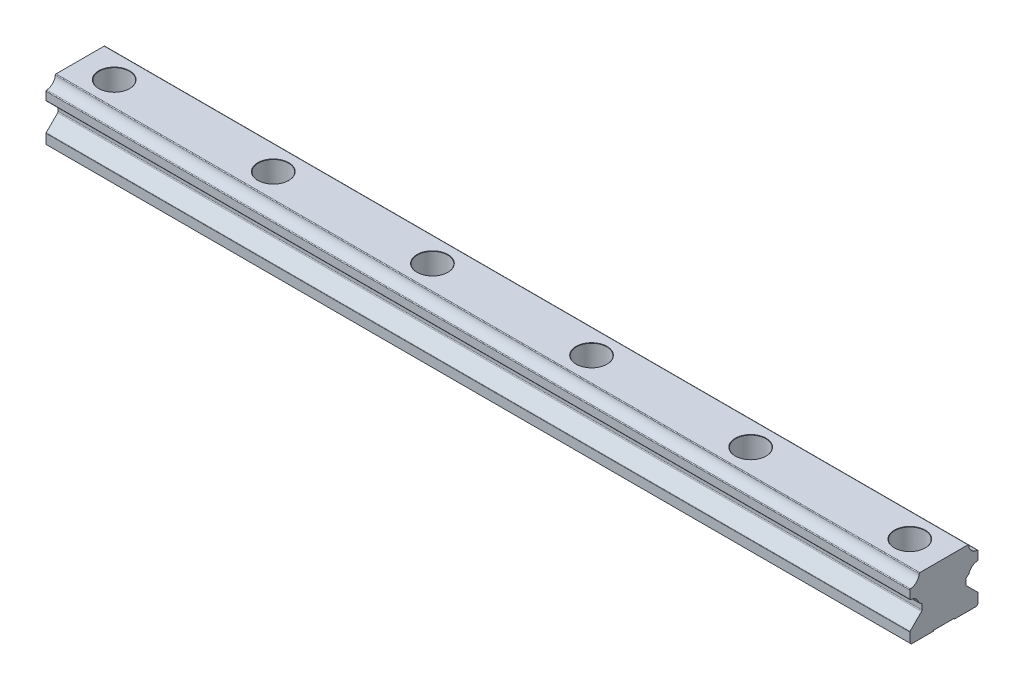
ISO-10303-21;
HEADER;
FILE_DESCRIPTION(('STEP AP214'),'2;1');
FILE_NAME('part.step','',(''),(''),'','','');
FILE_SCHEMA(('AUTOMOTIVE_DESIGN { 1 0 10303 214 1 1 1 1 }'));
ENDSEC;
DATA;
#1=APPLICATION_CONTEXT('core data for automotive mechanical design processes');
#2=APPLICATION_PROTOCOL_DEFINITION('international standard','automotive_design',2000,#1);
#3=PRODUCT_CONTEXT('',#1,'mechanical');
#4=PRODUCT('Part','Part','',(#3));
#5=PRODUCT_RELATED_PRODUCT_CATEGORY('part','',(#4));
#6=PRODUCT_DEFINITION_FORMATION('','',#4);
#7=PRODUCT_DEFINITION_CONTEXT('part definition',#1,'design');
#8=PRODUCT_DEFINITION('design','',#6,#7);
#9=PRODUCT_DEFINITION_SHAPE('','',#8);
#10=(LENGTH_UNIT() NAMED_UNIT(*) SI_UNIT(.MILLI.,.METRE.));
#11=(NAMED_UNIT(*) PLANE_ANGLE_UNIT() SI_UNIT($,.RADIAN.));
#12=(NAMED_UNIT(*) SI_UNIT($,.STERADIAN.) SOLID_ANGLE_UNIT());
#13=UNCERTAINTY_MEASURE_WITH_UNIT(LENGTH_MEASURE(1.E-05),#10,'distance_accuracy_value','');
#14=(GEOMETRIC_REPRESENTATION_CONTEXT(3) GLOBAL_UNCERTAINTY_ASSIGNED_CONTEXT((#13)) GLOBAL_UNIT_ASSIGNED_CONTEXT((#10,
#11,#12)) REPRESENTATION_CONTEXT('',''));
#15=CARTESIAN_POINT('',(0.,0.,0.));
#16=DIRECTION('',(0.,0.,1.));
#17=DIRECTION('',(1.,0.,0.));
#18=AXIS2_PLACEMENT_3D('',#15,#16,#17);
#19=CARTESIAN_POINT('',(570.,0.,-7.));
#20=DIRECTION('',(0.,0.,1.));
#21=DIRECTION('',(1.,0.,0.));
#22=AXIS2_PLACEMENT_3D('',#19,#20,#21);
#23=PLANE('',#22);
#24=DIRECTION('',(-1.,0.,0.));
#25=VECTOR('',#24,1.);
#26=CARTESIAN_POINT('',(570.,0.5,-7.));
#27=LINE('',#26,#25);
#28=CARTESIAN_POINT('',(22.2353776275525,0.5,-7.));
#29=VERTEX_POINT('',#28);
#30=CARTESIAN_POINT('',(0.,0.5,-7.));
#31=VERTEX_POINT('',#30);
#32=EDGE_CURVE('E11',#29,#31,#27,.T.);
#33=ORIENTED_EDGE('',*,*,#32,.T.);
#34=DIRECTION('',(0.,1.,0.));
#35=VECTOR('',#34,1.);
#36=CARTESIAN_POINT('',(0.,0.,-7.));
#37=LINE('',#36,#35);
#38=CARTESIAN_POINT('',(0.,0.,-7.));
#39=VERTEX_POINT('',#38);
#40=EDGE_CURVE('E43',#39,#31,#37,.T.);
#41=ORIENTED_EDGE('',*,*,#40,.F.);
#42=DIRECTION('',(-1.,0.,0.));
#43=VECTOR('',#42,1.);
#44=CARTESIAN_POINT('',(570.,0.,-7.));
#45=LINE('',#44,#43);
#46=CARTESIAN_POINT('',(20.7935343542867,0.,-7.));
#47=VERTEX_POINT('',#46);
#48=EDGE_CURVE('E1619',#47,#39,#45,.T.);
#49=ORIENTED_EDGE('',*,*,#48,.F.);
#50=CARTESIAN_POINT('',(22.2353776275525,0.200000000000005,-7.00000000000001));
#51=CARTESIAN_POINT('',(22.1752764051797,0.197731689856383,-6.99999914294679));
#52=CARTESIAN_POINT('',(22.1152040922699,0.194700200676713,-6.9999877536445));
#53=CARTESIAN_POINT('',(21.9952064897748,0.18712080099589,-6.99995641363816));
#54=CARTESIAN_POINT('',(21.935281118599,0.182574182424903,-6.99993647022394));
#55=CARTESIAN_POINT('',(21.8155013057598,0.171965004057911,-6.99990046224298));
#56=CARTESIAN_POINT('',(21.7556470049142,0.165900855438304,-6.99988440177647));
#57=CARTESIAN_POINT('',(21.635933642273,0.152260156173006,-6.99986249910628));
#58=CARTESIAN_POINT('',(21.5760750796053,0.144679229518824,-6.99985668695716));
#59=CARTESIAN_POINT('',(21.4562784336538,0.128007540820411,-6.9998573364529));
#60=CARTESIAN_POINT('',(21.3963413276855,0.118909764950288,-6.9998638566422));
#61=CARTESIAN_POINT('',(21.2763137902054,0.0992070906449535,-6.99988661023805));
#62=CARTESIAN_POINT('',(21.2162249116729,0.0885927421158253,-6.99990290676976));
#63=CARTESIAN_POINT('',(21.0958216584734,0.0658589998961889,-6.99993861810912));
#64=CARTESIAN_POINT('',(21.0355094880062,0.0537279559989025,-6.99995805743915));
#65=CARTESIAN_POINT('',(20.9145876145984,0.0279640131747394,-6.99998850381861));
#66=CARTESIAN_POINT('',(20.8539808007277,0.0143175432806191,-6.99999942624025));
#67=CARTESIAN_POINT('',(20.7935343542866,5.1797758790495E-13,-7.00000000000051));
#68=B_SPLINE_CURVE_WITH_KNOTS('',3,(#50,#51,#52,#53,#54,#55,#56,#57,#58,#59,#60,#61,#62,#63,#64,
#65,#66,#67),.UNSPECIFIED.,.F.,.F.,(4,2,2,2,2,2,2,2,4),(0.,0.180427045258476,0.360700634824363,
0.541163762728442,0.722155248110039,0.904008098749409,1.08704799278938,1.27159191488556,
1.45794697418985),.UNSPECIFIED.);
#69=CARTESIAN_POINT('',(22.2353776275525,0.199999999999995,-7.));
#70=VERTEX_POINT('',#69);
#71=EDGE_CURVE('E1314',#70,#47,#68,.T.);
#72=ORIENTED_EDGE('',*,*,#71,.F.);
#73=DIRECTION('',(0.,-1.,0.));
#74=VECTOR('',#73,1.);
#75=CARTESIAN_POINT('',(22.2353776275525,0.,-7.));
#76=LINE('',#75,#74);
#77=EDGE_CURVE('E1319',#29,#70,#76,.T.);
#78=ORIENTED_EDGE('',*,*,#77,.F.);
#79=EDGE_LOOP('',(#33,#41,#49,#72,#78));
#80=FACE_BOUND('',#79,.T.);
#81=ADVANCED_FACE('F17',(#80),#23,.T.);
#82=CARTESIAN_POINT('',(547.5,0.199999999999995,0.));
#83=DIRECTION('',(0.,-1.,0.));
#84=DIRECTION('',(0.,0.,-1.));
#85=AXIS2_PLACEMENT_3D('',#82,#83,#84);
#86=CONICAL_SURFACE('',#85,7.005,0.7853981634);
#87=CARTESIAN_POINT('',(547.5,0.,0.));
#88=DIRECTION('',(0.,-1.,0.));
#89=DIRECTION('',(0.,0.,-1.));
#90=AXIS2_PLACEMENT_3D('',#87,#88,#89);
#91=CIRCLE('',#90,7.205);
#92=CARTESIAN_POINT('',(549.206465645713,0.,7.));
#93=VERTEX_POINT('',#92);
#94=CARTESIAN_POINT('',(545.793534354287,0.,7.));
#95=VERTEX_POINT('',#94);
#96=EDGE_CURVE('E29',#93,#95,#91,.T.);
#97=ORIENTED_EDGE('',*,*,#96,.T.);
#98=CARTESIAN_POINT('',(545.793534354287,5.98994595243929E-13,7.0000000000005));
#99=CARTESIAN_POINT('',(545.853980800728,0.0143175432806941,6.99999942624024));
#100=CARTESIAN_POINT('',(545.914587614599,0.0279640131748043,6.9999885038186));
#101=CARTESIAN_POINT('',(546.035509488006,0.0537279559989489,6.99995805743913));
#102=CARTESIAN_POINT('',(546.095821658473,0.0658589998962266,6.9999386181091));
#103=CARTESIAN_POINT('',(546.216224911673,0.0885927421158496,6.99990290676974));
#104=CARTESIAN_POINT('',(546.276313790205,0.0992070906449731,6.99988661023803));
#105=CARTESIAN_POINT('',(546.396341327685,0.118909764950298,6.99986385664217));
#106=CARTESIAN_POINT('',(546.456278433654,0.128007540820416,6.99985733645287));
#107=CARTESIAN_POINT('',(546.576075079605,0.14467922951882,6.99985668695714));
#108=CARTESIAN_POINT('',(546.635933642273,0.152260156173,6.99986249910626));
#109=CARTESIAN_POINT('',(546.755647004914,0.165900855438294,6.99988440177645));
#110=CARTESIAN_POINT('',(546.81550130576,0.171965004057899,6.99990046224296));
#111=CARTESIAN_POINT('',(546.935281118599,0.182574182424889,6.99993647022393));
#112=CARTESIAN_POINT('',(546.995206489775,0.187120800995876,6.99995641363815));
#113=CARTESIAN_POINT('',(547.115204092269,0.1947002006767,6.99998775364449));
#114=CARTESIAN_POINT('',(547.175276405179,0.197731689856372,6.99999914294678));
#115=CARTESIAN_POINT('',(547.235377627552,0.199999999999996,7.));
#116=B_SPLINE_CURVE_WITH_KNOTS('',3,(#98,#99,#100,#101,#102,#103,#104,#105,#106,#107,#108,#109,
#110,#111,#112,#113,#114,#115),.UNSPECIFIED.,.F.,.F.,(4,2,2,2,2,2,2,2,4),(0.,0.18635505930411,
0.370898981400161,0.553938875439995,0.735791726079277,0.916783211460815,1.09724633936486,
1.2775199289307,1.4579469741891),.UNSPECIFIED.);
#117=CARTESIAN_POINT('',(547.235377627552,0.199999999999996,7.));
#118=VERTEX_POINT('',#117);
#119=EDGE_CURVE('E2021',#95,#118,#116,.T.);
#120=ORIENTED_EDGE('',*,*,#119,.T.);
#121=CARTESIAN_POINT('',(547.5,0.199999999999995,0.));
#122=DIRECTION('',(0.,-1.,0.));
#123=DIRECTION('',(0.,0.,-1.));
#124=AXIS2_PLACEMENT_3D('',#121,#122,#123);
#125=CIRCLE('',#124,7.005);
#126=CARTESIAN_POINT('',(547.764622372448,0.199999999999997,7.));
#127=VERTEX_POINT('',#126);
#128=EDGE_CURVE('E1084',#127,#118,#125,.T.);
#129=ORIENTED_EDGE('',*,*,#128,.F.);
#130=CARTESIAN_POINT('',(547.764622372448,0.199999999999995,7.));
#131=CARTESIAN_POINT('',(547.824723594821,0.197731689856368,6.99999914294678));
#132=CARTESIAN_POINT('',(547.884795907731,0.194700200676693,6.99998775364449));
#133=CARTESIAN_POINT('',(548.004793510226,0.187120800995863,6.99995641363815));
#134=CARTESIAN_POINT('',(548.064718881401,0.182574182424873,6.99993647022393));
#135=CARTESIAN_POINT('',(548.184498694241,0.171965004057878,6.99990046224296));
#136=CARTESIAN_POINT('',(548.244352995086,0.165900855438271,6.99988440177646));
#137=CARTESIAN_POINT('',(548.364066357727,0.152260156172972,6.99986249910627));
#138=CARTESIAN_POINT('',(548.423924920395,0.144679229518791,6.99985668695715));
#139=CARTESIAN_POINT('',(548.543721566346,0.128007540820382,6.99985733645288));
#140=CARTESIAN_POINT('',(548.603658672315,0.118909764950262,6.99986385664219));
#141=CARTESIAN_POINT('',(548.723686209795,0.099207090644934,6.99988661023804));
#142=CARTESIAN_POINT('',(548.783775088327,0.0885927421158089,6.99990290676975));
#143=CARTESIAN_POINT('',(548.904178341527,0.065858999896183,6.99993861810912));
#144=CARTESIAN_POINT('',(548.964490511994,0.053727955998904,6.99995805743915));
#145=CARTESIAN_POINT('',(549.085412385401,0.0279640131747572,6.99998850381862));
#146=CARTESIAN_POINT('',(549.146019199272,0.014317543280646,6.99999942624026));
#147=CARTESIAN_POINT('',(549.206465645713,5.49988657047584E-13,7.00000000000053));
#148=B_SPLINE_CURVE_WITH_KNOTS('',3,(#130,#131,#132,#133,#134,#135,#136,#137,#138,#139,#140,
#141,#142,#143,#144,#145,#146,#147),.UNSPECIFIED.,.F.,.F.,(4,2,2,2,2,2,2,2,4),(0.,
0.1804270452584,0.360700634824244,0.541163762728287,0.722155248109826,0.904008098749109,
1.08704799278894,1.271591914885,1.45794697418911),.UNSPECIFIED.);
#149=EDGE_CURVE('E1015',#127,#93,#148,.T.);
#150=ORIENTED_EDGE('',*,*,#149,.T.);
#151=EDGE_LOOP('',(#97,#120,#129,#150));
#152=FACE_BOUND('',#151,.T.);
#153=ADVANCED_FACE('F1052',(#152),#86,.F.);
#154=CARTESIAN_POINT('',(127.5,0.199999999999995,0.));
#155=DIRECTION('',(0.,-1.,0.));
#156=DIRECTION('',(0.,0.,-1.));
#157=AXIS2_PLACEMENT_3D('',#154,#155,#156);
#158=CONICAL_SURFACE('',#157,7.005,0.7853981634);
#159=CARTESIAN_POINT('',(127.5,0.,0.));
#160=DIRECTION('',(0.,-1.,0.));
#161=DIRECTION('',(0.,0.,-1.));
#162=AXIS2_PLACEMENT_3D('',#159,#160,#161);
#163=CIRCLE('',#162,7.205);
#164=CARTESIAN_POINT('',(129.206465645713,0.,7.));
#165=VERTEX_POINT('',#164);
#166=CARTESIAN_POINT('',(125.793534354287,0.,7.));
#167=VERTEX_POINT('',#166);
#168=EDGE_CURVE('E1006',#165,#167,#163,.T.);
#169=ORIENTED_EDGE('',*,*,#168,.T.);
#170=CARTESIAN_POINT('',(125.793534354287,5.89995717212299E-13,7.0000000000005));
#171=CARTESIAN_POINT('',(125.853980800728,0.0143175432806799,6.99999942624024));
#172=CARTESIAN_POINT('',(125.914587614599,0.0279640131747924,6.9999885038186));
#173=CARTESIAN_POINT('',(126.035509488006,0.0537279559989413,6.99995805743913));
#174=CARTESIAN_POINT('',(126.095821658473,0.0658589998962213,6.9999386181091));
#175=CARTESIAN_POINT('',(126.216224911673,0.0885927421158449,6.99990290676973));
#176=CARTESIAN_POINT('',(126.276313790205,0.0992070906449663,6.99988661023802));
#177=CARTESIAN_POINT('',(126.396341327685,0.11890976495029,6.99986385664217));
#178=CARTESIAN_POINT('',(126.456278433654,0.128007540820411,6.99985733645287));
#179=CARTESIAN_POINT('',(126.576075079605,0.144679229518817,6.99985668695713));
#180=CARTESIAN_POINT('',(126.635933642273,0.152260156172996,6.99986249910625));
#181=CARTESIAN_POINT('',(126.755647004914,0.16590085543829,6.99988440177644));
#182=CARTESIAN_POINT('',(126.815501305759,0.171965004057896,6.99990046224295));
#183=CARTESIAN_POINT('',(126.935281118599,0.182574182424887,6.99993647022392));
#184=CARTESIAN_POINT('',(126.995206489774,0.187120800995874,6.99995641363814));
#185=CARTESIAN_POINT('',(127.115204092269,0.194700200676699,6.99998775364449));
#186=CARTESIAN_POINT('',(127.175276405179,0.19773168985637,6.99999914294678));
#187=CARTESIAN_POINT('',(127.235377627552,0.199999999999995,7.));
#188=B_SPLINE_CURVE_WITH_KNOTS('',3,(#170,#171,#172,#173,#174,#175,#176,#177,#178,#179,#180,
#181,#182,#183,#184,#185,#186,#187),.UNSPECIFIED.,.F.,.F.,(4,2,2,2,2,2,2,2,4),(0.,
0.186355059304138,0.370898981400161,0.553938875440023,0.735791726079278,0.916783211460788,
1.0972463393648,1.27751992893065,1.45794697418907),.UNSPECIFIED.);
#189=CARTESIAN_POINT('',(127.235377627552,0.199999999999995,7.));
#190=VERTEX_POINT('',#189);
#191=EDGE_CURVE('E1016',#167,#190,#188,.T.);
#192=ORIENTED_EDGE('',*,*,#191,.T.);
#193=CARTESIAN_POINT('',(127.5,0.199999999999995,0.));
#194=DIRECTION('',(0.,-1.,0.));
#195=DIRECTION('',(0.,0.,-1.));
#196=AXIS2_PLACEMENT_3D('',#193,#194,#195);
#197=CIRCLE('',#196,7.005);
#198=CARTESIAN_POINT('',(127.764622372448,0.199999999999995,7.));
#199=VERTEX_POINT('',#198);
#200=EDGE_CURVE('E796',#199,#190,#197,.T.);
#201=ORIENTED_EDGE('',*,*,#200,.F.);
#202=CARTESIAN_POINT('',(127.764622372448,0.199999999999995,7.));
#203=CARTESIAN_POINT('',(127.824723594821,0.197731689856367,6.99999914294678));
#204=CARTESIAN_POINT('',(127.884795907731,0.194700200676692,6.99998775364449));
#205=CARTESIAN_POINT('',(128.004793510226,0.187120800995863,6.99995641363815));
#206=CARTESIAN_POINT('',(128.064718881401,0.182574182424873,6.99993647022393));
#207=CARTESIAN_POINT('',(128.184498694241,0.171965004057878,6.99990046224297));
#208=CARTESIAN_POINT('',(128.244352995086,0.165900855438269,6.99988440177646));
#209=CARTESIAN_POINT('',(128.364066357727,0.152260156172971,6.99986249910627));
#210=CARTESIAN_POINT('',(128.423924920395,0.144679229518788,6.99985668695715));
#211=CARTESIAN_POINT('',(128.543721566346,0.12800754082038,6.99985733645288));
#212=CARTESIAN_POINT('',(128.603658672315,0.11890976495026,6.99986385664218));
#213=CARTESIAN_POINT('',(128.723686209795,0.0992070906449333,6.99988661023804));
#214=CARTESIAN_POINT('',(128.783775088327,0.0885927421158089,6.99990290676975));
#215=CARTESIAN_POINT('',(128.904178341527,0.0658589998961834,6.99993861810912));
#216=CARTESIAN_POINT('',(128.964490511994,0.0537279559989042,6.99995805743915));
#217=CARTESIAN_POINT('',(129.085412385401,0.0279640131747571,6.99998850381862));
#218=CARTESIAN_POINT('',(129.146019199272,0.0143175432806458,6.99999942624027));
#219=CARTESIAN_POINT('',(129.206465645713,5.50991544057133E-13,7.00000000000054));
#220=B_SPLINE_CURVE_WITH_KNOTS('',3,(#202,#203,#204,#205,#206,#207,#208,#209,#210,#211,#212,
#213,#214,#215,#216,#217,#218,#219),.UNSPECIFIED.,.F.,.F.,(4,2,2,2,2,2,2,2,4),(0.,
0.180427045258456,0.360700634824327,0.541163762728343,0.722155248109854,0.904008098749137,
1.08704799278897,1.271591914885,1.45794697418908),.UNSPECIFIED.);
#221=EDGE_CURVE('E1038',#199,#165,#220,.T.);
#222=ORIENTED_EDGE('',*,*,#221,.T.);
#223=EDGE_LOOP('',(#169,#192,#201,#222));
#224=FACE_BOUND('',#223,.T.);
#225=ADVANCED_FACE('F826',(#224),#158,.F.);
#226=CARTESIAN_POINT('',(337.5,0.199999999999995,0.));
#227=DIRECTION('',(0.,-1.,0.));
#228=DIRECTION('',(0.,0.,-1.));
#229=AXIS2_PLACEMENT_3D('',#226,#227,#228);
#230=CONICAL_SURFACE('',#229,7.005,0.7853981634);
#231=CARTESIAN_POINT('',(337.5,0.,0.));
#232=DIRECTION('',(0.,-1.,0.));
#233=DIRECTION('',(0.,0.,-1.));
#234=AXIS2_PLACEMENT_3D('',#231,#232,#233);
#235=CIRCLE('',#234,7.205);
#236=CARTESIAN_POINT('',(339.206465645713,0.,7.));
#237=VERTEX_POINT('',#236);
#238=CARTESIAN_POINT('',(335.793534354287,0.,7.));
#239=VERTEX_POINT('',#238);
#240=EDGE_CURVE('E2158',#237,#239,#235,.T.);
#241=ORIENTED_EDGE('',*,*,#240,.T.);
#242=CARTESIAN_POINT('',(335.793534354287,5.7947895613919E-13,7.00000000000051));
#243=CARTESIAN_POINT('',(335.853980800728,0.0143175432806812,6.99999942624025));
#244=CARTESIAN_POINT('',(335.914587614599,0.0279640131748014,6.9999885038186));
#245=CARTESIAN_POINT('',(336.035509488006,0.0537279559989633,6.99995805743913));
#246=CARTESIAN_POINT('',(336.095821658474,0.0658589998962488,6.99993861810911));
#247=CARTESIAN_POINT('',(336.216224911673,0.0885927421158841,6.99990290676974));
#248=CARTESIAN_POINT('',(336.276313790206,0.0992070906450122,6.99988661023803));
#249=CARTESIAN_POINT('',(336.396341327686,0.118909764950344,6.99986385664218));
#250=CARTESIAN_POINT('',(336.456278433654,0.128007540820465,6.99985733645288));
#251=CARTESIAN_POINT('',(336.576075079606,0.144679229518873,6.99985668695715));
#252=CARTESIAN_POINT('',(336.635933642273,0.152260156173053,6.99986249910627));
#253=CARTESIAN_POINT('',(336.755647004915,0.165900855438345,6.99988440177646));
#254=CARTESIAN_POINT('',(336.81550130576,0.171965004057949,6.99990046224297));
#255=CARTESIAN_POINT('',(336.935281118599,0.182574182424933,6.99993647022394));
#256=CARTESIAN_POINT('',(336.995206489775,0.187120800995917,6.99995641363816));
#257=CARTESIAN_POINT('',(337.11520409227,0.194700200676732,6.9999877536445));
#258=CARTESIAN_POINT('',(337.17527640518,0.197731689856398,6.9999991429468));
#259=CARTESIAN_POINT('',(337.235377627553,0.200000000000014,7.00000000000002));
#260=B_SPLINE_CURVE_WITH_KNOTS('',3,(#242,#243,#244,#245,#246,#247,#248,#249,#250,#251,#252,
#253,#254,#255,#256,#257,#258,#259),.UNSPECIFIED.,.F.,.F.,(4,2,2,2,2,2,2,2,4),(0.,
0.186355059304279,0.370898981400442,0.553938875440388,0.735791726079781,0.916783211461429,
1.09724633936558,1.27751992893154,1.4579469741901),.UNSPECIFIED.);
#261=CARTESIAN_POINT('',(337.235377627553,0.199999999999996,7.));
#262=VERTEX_POINT('',#261);
#263=EDGE_CURVE('E810',#239,#262,#260,.T.);
#264=ORIENTED_EDGE('',*,*,#263,.T.);
#265=CARTESIAN_POINT('',(337.5,0.199999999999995,0.));
#266=DIRECTION('',(0.,-1.,0.));
#267=DIRECTION('',(0.,0.,-1.));
#268=AXIS2_PLACEMENT_3D('',#265,#266,#267);
#269=CIRCLE('',#268,7.005);
#270=CARTESIAN_POINT('',(337.764622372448,0.199999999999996,7.));
#271=VERTEX_POINT('',#270);
#272=EDGE_CURVE('E2176',#271,#262,#269,.T.);
#273=ORIENTED_EDGE('',*,*,#272,.F.);
#274=CARTESIAN_POINT('',(337.764622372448,0.199999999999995,7.));
#275=CARTESIAN_POINT('',(337.824723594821,0.197731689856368,6.99999914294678));
#276=CARTESIAN_POINT('',(337.884795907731,0.194700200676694,6.99998775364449));
#277=CARTESIAN_POINT('',(338.004793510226,0.187120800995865,6.99995641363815));
#278=CARTESIAN_POINT('',(338.064718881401,0.182574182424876,6.99993647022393));
#279=CARTESIAN_POINT('',(338.184498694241,0.17196500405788,6.99990046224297));
#280=CARTESIAN_POINT('',(338.244352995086,0.165900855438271,6.99988440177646));
#281=CARTESIAN_POINT('',(338.364066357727,0.152260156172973,6.99986249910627));
#282=CARTESIAN_POINT('',(338.423924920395,0.144679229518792,6.99985668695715));
#283=CARTESIAN_POINT('',(338.543721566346,0.128007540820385,6.99985733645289));
#284=CARTESIAN_POINT('',(338.603658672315,0.118909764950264,6.99986385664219));
#285=CARTESIAN_POINT('',(338.723686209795,0.0992070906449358,6.99988661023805));
#286=CARTESIAN_POINT('',(338.783775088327,0.0885927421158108,6.99990290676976));
#287=CARTESIAN_POINT('',(338.904178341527,0.0658589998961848,6.99993861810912));
#288=CARTESIAN_POINT('',(338.964490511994,0.0537279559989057,6.99995805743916));
#289=CARTESIAN_POINT('',(339.085412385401,0.0279640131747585,6.99998850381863));
#290=CARTESIAN_POINT('',(339.146019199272,0.0143175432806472,6.99999942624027));
#291=CARTESIAN_POINT('',(339.206465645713,5.50991544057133E-13,7.00000000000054));
#292=B_SPLINE_CURVE_WITH_KNOTS('',3,(#274,#275,#276,#277,#278,#279,#280,#281,#282,#283,#284,
#285,#286,#287,#288,#289,#290,#291),.UNSPECIFIED.,.F.,.F.,(4,2,2,2,2,2,2,2,4),(0.,
0.180427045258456,0.360700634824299,0.541163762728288,0.722155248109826,0.904008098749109,
1.08704799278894,1.271591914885,1.45794697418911),.UNSPECIFIED.);
#293=EDGE_CURVE('E845',#271,#237,#292,.T.);
#294=ORIENTED_EDGE('',*,*,#293,.T.);
#295=EDGE_LOOP('',(#241,#264,#273,#294));
#296=FACE_BOUND('',#295,.T.);
#297=ADVANCED_FACE('F817',(#296),#230,.F.);
#298=CARTESIAN_POINT('',(337.5,0.,0.));
#299=DIRECTION('',(0.,1.,0.));
#300=DIRECTION('',(0.,0.,-1.));
#301=AXIS2_PLACEMENT_3D('',#298,#299,#300);
#302=CYLINDRICAL_SURFACE('',#301,7.005);
#303=CARTESIAN_POINT('',(337.5,21.,0.));
#304=DIRECTION('',(0.,-1.,0.));
#305=DIRECTION('',(0.,0.,-1.));
#306=AXIS2_PLACEMENT_3D('',#303,#304,#305);
#307=CIRCLE('',#306,7.005);
#308=CARTESIAN_POINT('',(337.5,21.,-7.005));
#309=VERTEX_POINT('',#308);
#310=EDGE_CURVE('E1518',#309,#309,#307,.T.);
#311=ORIENTED_EDGE('',*,*,#310,.F.);
#312=EDGE_LOOP('',(#311));
#313=FACE_BOUND('',#312,.T.);
#314=CARTESIAN_POINT('',(337.5,0.5,0.));
#315=DIRECTION('',(0.,-1.,0.));
#316=DIRECTION('',(0.,0.,-1.));
#317=AXIS2_PLACEMENT_3D('',#314,#315,#316);
#318=CIRCLE('',#317,7.005);
#319=CARTESIAN_POINT('',(337.764622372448,0.5,-7.));
#320=VERTEX_POINT('',#319);
#321=CARTESIAN_POINT('',(337.764622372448,0.5,7.));
#322=VERTEX_POINT('',#321);
#323=EDGE_CURVE('E1678',#320,#322,#318,.T.);
#324=ORIENTED_EDGE('',*,*,#323,.T.);
#325=DIRECTION('',(0.,-1.,0.));
#326=VECTOR('',#325,1.);
#327=CARTESIAN_POINT('',(337.764622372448,0.,7.));
#328=LINE('',#327,#326);
#329=EDGE_CURVE('E851',#322,#271,#328,.T.);
#330=ORIENTED_EDGE('',*,*,#329,.T.);
#331=ORIENTED_EDGE('',*,*,#272,.T.);
#332=DIRECTION('',(0.,1.,0.));
#333=VECTOR('',#332,1.);
#334=CARTESIAN_POINT('',(337.235377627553,0.,7.));
#335=LINE('',#334,#333);
#336=CARTESIAN_POINT('',(337.235377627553,0.5,7.));
#337=VERTEX_POINT('',#336);
#338=EDGE_CURVE('E2179',#262,#337,#335,.T.);
#339=ORIENTED_EDGE('',*,*,#338,.T.);
#340=CARTESIAN_POINT('',(337.5,0.5,0.));
#341=DIRECTION('',(0.,-1.,0.));
#342=DIRECTION('',(0.,0.,-1.));
#343=AXIS2_PLACEMENT_3D('',#340,#341,#342);
#344=CIRCLE('',#343,7.005);
#345=CARTESIAN_POINT('',(337.235377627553,0.5,-7.));
#346=VERTEX_POINT('',#345);
#347=EDGE_CURVE('E1149',#337,#346,#344,.T.);
#348=ORIENTED_EDGE('',*,*,#347,.T.);
#349=DIRECTION('',(0.,-1.,0.));
#350=VECTOR('',#349,1.);
#351=CARTESIAN_POINT('',(337.235377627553,0.,-7.));
#352=LINE('',#351,#350);
#353=CARTESIAN_POINT('',(337.235377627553,0.199999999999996,-7.));
#354=VERTEX_POINT('',#353);
#355=EDGE_CURVE('E1140',#346,#354,#352,.T.);
#356=ORIENTED_EDGE('',*,*,#355,.T.);
#357=CARTESIAN_POINT('',(337.5,0.199999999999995,0.));
#358=DIRECTION('',(0.,-1.,0.));
#359=DIRECTION('',(0.,0.,-1.));
#360=AXIS2_PLACEMENT_3D('',#357,#358,#359);
#361=CIRCLE('',#360,7.005);
#362=CARTESIAN_POINT('',(337.764622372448,0.199999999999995,-7.));
#363=VERTEX_POINT('',#362);
#364=EDGE_CURVE('E1150',#354,#363,#361,.T.);
#365=ORIENTED_EDGE('',*,*,#364,.T.);
#366=DIRECTION('',(0.,1.,0.));
#367=VECTOR('',#366,1.);
#368=CARTESIAN_POINT('',(337.764622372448,0.,-7.));
#369=LINE('',#368,#367);
#370=EDGE_CURVE('E1515',#363,#320,#369,.T.);
#371=ORIENTED_EDGE('',*,*,#370,.T.);
#372=EDGE_LOOP('',(#324,#330,#331,#339,#348,#356,#365,#371));
#373=FACE_BOUND('',#372,.T.);
#374=ADVANCED_FACE('F825',(#313,#373),#302,.F.);
#375=CARTESIAN_POINT('',(347.505,21.,0.));
#376=DIRECTION('',(0.,1.,0.));
#377=DIRECTION('',(1.,0.,0.));
#378=AXIS2_PLACEMENT_3D('',#375,#376,#377);
#379=PLANE('',#378);
#380=CARTESIAN_POINT('',(337.5,21.,0.));
#381=DIRECTION('',(0.,-1.,0.));
#382=DIRECTION('',(0.,0.,-1.));
#383=AXIS2_PLACEMENT_3D('',#380,#381,#382);
#384=CIRCLE('',#383,10.005);
#385=CARTESIAN_POINT('',(337.5,21.,-10.005));
#386=VERTEX_POINT('',#385);
#387=EDGE_CURVE('E1625',#386,#386,#384,.T.);
#388=ORIENTED_EDGE('',*,*,#387,.F.);
#389=EDGE_LOOP('',(#388));
#390=FACE_BOUND('',#389,.T.);
#391=ORIENTED_EDGE('',*,*,#310,.T.);
#392=EDGE_LOOP('',(#391));
#393=FACE_BOUND('',#392,.T.);
#394=ADVANCED_FACE('F1219',(#390,#393),#379,.T.);
#395=CARTESIAN_POINT('',(337.5,0.,0.));
#396=DIRECTION('',(0.,1.,0.));
#397=DIRECTION('',(0.,0.,-1.));
#398=AXIS2_PLACEMENT_3D('',#395,#396,#397);
#399=CYLINDRICAL_SURFACE('',#398,10.005);
#400=CARTESIAN_POINT('',(337.5,37.8,0.));
#401=DIRECTION('',(0.,-1.,0.));
#402=DIRECTION('',(0.,0.,-1.));
#403=AXIS2_PLACEMENT_3D('',#400,#401,#402);
#404=CIRCLE('',#403,10.005);
#405=CARTESIAN_POINT('',(337.5,37.8,-10.005));
#406=VERTEX_POINT('',#405);
#407=EDGE_CURVE('E885',#406,#406,#404,.T.);
#408=ORIENTED_EDGE('',*,*,#407,.F.);
#409=EDGE_LOOP('',(#408));
#410=FACE_BOUND('',#409,.T.);
#411=ORIENTED_EDGE('',*,*,#387,.T.);
#412=EDGE_LOOP('',(#411));
#413=FACE_BOUND('',#412,.T.);
#414=ADVANCED_FACE('F995',(#410,#413),#399,.F.);
#415=CARTESIAN_POINT('',(337.5,38.,0.));
#416=DIRECTION('',(0.,1.,0.));
#417=DIRECTION('',(0.,0.,1.));
#418=AXIS2_PLACEMENT_3D('',#415,#416,#417);
#419=CONICAL_SURFACE('',#418,10.205,0.7853981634);
#420=CARTESIAN_POINT('',(337.5,38.,0.));
#421=DIRECTION('',(0.,-1.,0.));
#422=DIRECTION('',(0.,0.,-1.));
#423=AXIS2_PLACEMENT_3D('',#420,#421,#422);
#424=CIRCLE('',#423,10.205);
#425=CARTESIAN_POINT('',(337.5,38.,-10.205));
#426=VERTEX_POINT('',#425);
#427=EDGE_CURVE('E1691',#426,#426,#424,.T.);
#428=ORIENTED_EDGE('',*,*,#427,.F.);
#429=EDGE_LOOP('',(#428));
#430=FACE_BOUND('',#429,.T.);
#431=ORIENTED_EDGE('',*,*,#407,.T.);
#432=EDGE_LOOP('',(#431));
#433=FACE_BOUND('',#432,.T.);
#434=ADVANCED_FACE('F2508',(#430,#433),#419,.F.);
#435=CARTESIAN_POINT('',(442.5,0.199999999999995,0.));
#436=DIRECTION('',(0.,-1.,0.));
#437=DIRECTION('',(0.,0.,-1.));
#438=AXIS2_PLACEMENT_3D('',#435,#436,#437);
#439=CONICAL_SURFACE('',#438,7.005,0.7853981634);
#440=CARTESIAN_POINT('',(442.5,0.,0.));
#441=DIRECTION('',(0.,-1.,0.));
#442=DIRECTION('',(0.,0.,-1.));
#443=AXIS2_PLACEMENT_3D('',#440,#441,#442);
#444=CIRCLE('',#443,7.205);
#445=CARTESIAN_POINT('',(444.206465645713,0.,7.));
#446=VERTEX_POINT('',#445);
#447=CARTESIAN_POINT('',(440.793534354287,0.,7.));
#448=VERTEX_POINT('',#447);
#449=EDGE_CURVE('E876',#446,#448,#444,.T.);
#450=ORIENTED_EDGE('',*,*,#449,.T.);
#451=CARTESIAN_POINT('',(440.793534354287,5.7947895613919E-13,7.00000000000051));
#452=CARTESIAN_POINT('',(440.853980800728,0.0143175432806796,6.99999942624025));
#453=CARTESIAN_POINT('',(440.914587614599,0.0279640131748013,6.9999885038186));
#454=CARTESIAN_POINT('',(441.035509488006,0.0537279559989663,6.99995805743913));
#455=CARTESIAN_POINT('',(441.095821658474,0.0658589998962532,6.9999386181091));
#456=CARTESIAN_POINT('',(441.216224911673,0.0885927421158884,6.99990290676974));
#457=CARTESIAN_POINT('',(441.276313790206,0.0992070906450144,6.99988661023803));
#458=CARTESIAN_POINT('',(441.396341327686,0.118909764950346,6.99986385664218));
#459=CARTESIAN_POINT('',(441.456278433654,0.128007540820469,6.99985733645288));
#460=CARTESIAN_POINT('',(441.576075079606,0.144679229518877,6.99985668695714));
#461=CARTESIAN_POINT('',(441.635933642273,0.152260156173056,6.99986249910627));
#462=CARTESIAN_POINT('',(441.755647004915,0.165900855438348,6.99988440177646));
#463=CARTESIAN_POINT('',(441.81550130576,0.171965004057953,6.99990046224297));
#464=CARTESIAN_POINT('',(441.935281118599,0.182574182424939,6.99993647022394));
#465=CARTESIAN_POINT('',(441.995206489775,0.187120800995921,6.99995641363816));
#466=CARTESIAN_POINT('',(442.11520409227,0.194700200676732,6.9999877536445));
#467=CARTESIAN_POINT('',(442.17527640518,0.197731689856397,6.9999991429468));
#468=CARTESIAN_POINT('',(442.235377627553,0.200000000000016,7.00000000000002));
#469=B_SPLINE_CURVE_WITH_KNOTS('',3,(#451,#452,#453,#454,#455,#456,#457,#458,#459,#460,#461,
#462,#463,#464,#465,#466,#467,#468),.UNSPECIFIED.,.F.,.F.,(4,2,2,2,2,2,2,2,4),(0.,
0.186355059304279,0.370898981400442,0.553938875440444,0.735791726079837,0.916783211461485,
1.09724633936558,1.27751992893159,1.45794697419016),.UNSPECIFIED.);
#470=CARTESIAN_POINT('',(442.235377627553,0.199999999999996,7.));
#471=VERTEX_POINT('',#470);
#472=EDGE_CURVE('E886',#448,#471,#469,.T.);
#473=ORIENTED_EDGE('',*,*,#472,.T.);
#474=CARTESIAN_POINT('',(442.5,0.199999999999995,0.));
#475=DIRECTION('',(0.,-1.,0.));
#476=DIRECTION('',(0.,0.,-1.));
#477=AXIS2_PLACEMENT_3D('',#474,#475,#476);
#478=CIRCLE('',#477,7.005);
#479=CARTESIAN_POINT('',(442.764622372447,0.199999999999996,7.));
#480=VERTEX_POINT('',#479);
#481=EDGE_CURVE('E889',#480,#471,#478,.T.);
#482=ORIENTED_EDGE('',*,*,#481,.F.);
#483=CARTESIAN_POINT('',(442.764622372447,0.200000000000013,7.00000000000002));
#484=CARTESIAN_POINT('',(442.82472359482,0.197731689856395,6.9999991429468));
#485=CARTESIAN_POINT('',(442.88479590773,0.194700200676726,6.99998775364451));
#486=CARTESIAN_POINT('',(443.004793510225,0.187120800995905,6.99995641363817));
#487=CARTESIAN_POINT('',(443.064718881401,0.18257418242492,6.99993647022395));
#488=CARTESIAN_POINT('',(443.18449869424,0.171965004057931,6.99990046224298));
#489=CARTESIAN_POINT('',(443.244352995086,0.165900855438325,6.99988440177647));
#490=CARTESIAN_POINT('',(443.364066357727,0.15226015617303,6.99986249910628));
#491=CARTESIAN_POINT('',(443.423924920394,0.144679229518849,6.99985668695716));
#492=CARTESIAN_POINT('',(443.543721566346,0.128007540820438,6.99985733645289));
#493=CARTESIAN_POINT('',(443.603658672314,0.118909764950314,6.99986385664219));
#494=CARTESIAN_POINT('',(443.723686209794,0.0992070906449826,6.99988661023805));
#495=CARTESIAN_POINT('',(443.783775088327,0.0885927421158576,6.99990290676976));
#496=CARTESIAN_POINT('',(443.904178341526,0.0658589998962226,6.99993861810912));
#497=CARTESIAN_POINT('',(443.964490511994,0.0537279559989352,6.99995805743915));
#498=CARTESIAN_POINT('',(444.085412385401,0.0279640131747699,6.99998850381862));
#499=CARTESIAN_POINT('',(444.146019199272,0.0143175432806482,6.99999942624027));
#500=CARTESIAN_POINT('',(444.206465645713,5.50991544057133E-13,7.00000000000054));
#501=B_SPLINE_CURVE_WITH_KNOTS('',3,(#483,#484,#485,#486,#487,#488,#489,#490,#491,#492,#493,
#494,#495,#496,#497,#498,#499,#500),.UNSPECIFIED.,.F.,.F.,(4,2,2,2,2,2,2,2,4),(0.,
0.180427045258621,0.360700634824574,0.541163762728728,0.722155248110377,0.90400809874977,
1.08704799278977,1.27159191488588,1.4579469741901),.UNSPECIFIED.);
#502=EDGE_CURVE('E905',#480,#446,#501,.T.);
#503=ORIENTED_EDGE('',*,*,#502,.T.);
#504=EDGE_LOOP('',(#450,#473,#482,#503));
#505=FACE_BOUND('',#504,.T.);
#506=ADVANCED_FACE('F743',(#505),#439,.F.);
#507=CARTESIAN_POINT('',(22.5,0.199999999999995,0.));
#508=DIRECTION('',(0.,-1.,0.));
#509=DIRECTION('',(0.,0.,-1.));
#510=AXIS2_PLACEMENT_3D('',#507,#508,#509);
#511=CONICAL_SURFACE('',#510,7.005,0.7853981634);
#512=CARTESIAN_POINT('',(22.5,0.,0.));
#513=DIRECTION('',(0.,-1.,0.));
#514=DIRECTION('',(0.,0.,-1.));
#515=AXIS2_PLACEMENT_3D('',#512,#513,#514);
#516=CIRCLE('',#515,7.205);
#517=CARTESIAN_POINT('',(24.2064656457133,0.,7.));
#518=VERTEX_POINT('',#517);
#519=CARTESIAN_POINT('',(20.7935343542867,0.,7.));
#520=VERTEX_POINT('',#519);
#521=EDGE_CURVE('E2571',#518,#520,#516,.T.);
#522=ORIENTED_EDGE('',*,*,#521,.T.);
#523=CARTESIAN_POINT('',(20.7935343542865,5.37981117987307E-13,7.00000000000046));
#524=CARTESIAN_POINT('',(20.8539808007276,0.0143175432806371,6.9999994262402));
#525=CARTESIAN_POINT('',(20.9145876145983,0.027964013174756,6.99998850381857));
#526=CARTESIAN_POINT('',(21.0355094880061,0.0537279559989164,6.99995805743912));
#527=CARTESIAN_POINT('',(21.0958216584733,0.0658589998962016,6.99993861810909));
#528=CARTESIAN_POINT('',(21.2162249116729,0.0885927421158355,6.99990290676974));
#529=CARTESIAN_POINT('',(21.2763137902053,0.0992070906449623,6.99988661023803));
#530=CARTESIAN_POINT('',(21.3963413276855,0.118909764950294,6.99986385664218));
#531=CARTESIAN_POINT('',(21.4562784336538,0.128007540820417,6.99985733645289));
#532=CARTESIAN_POINT('',(21.5760750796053,0.144679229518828,6.99985668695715));
#533=CARTESIAN_POINT('',(21.635933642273,0.15226015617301,6.99986249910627));
#534=CARTESIAN_POINT('',(21.7556470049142,0.165900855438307,6.99988440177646));
#535=CARTESIAN_POINT('',(21.8155013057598,0.171965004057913,6.99990046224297));
#536=CARTESIAN_POINT('',(21.935281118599,0.182574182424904,6.99993647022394));
#537=CARTESIAN_POINT('',(21.9952064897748,0.187120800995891,6.99995641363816));
#538=CARTESIAN_POINT('',(22.1152040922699,0.194700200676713,6.9999877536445));
#539=CARTESIAN_POINT('',(22.1752764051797,0.197731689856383,6.99999914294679));
#540=CARTESIAN_POINT('',(22.2353776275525,0.200000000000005,7.00000000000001));
#541=B_SPLINE_CURVE_WITH_KNOTS('',3,(#523,#524,#525,#526,#527,#528,#529,#530,#531,#532,#533,
#534,#535,#536,#537,#538,#539,#540),.UNSPECIFIED.,.F.,.F.,(4,2,2,2,2,2,2,2,4),(0.,
0.186355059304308,0.370898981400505,0.553938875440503,0.735791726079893,0.91678321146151,
1.09724633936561,1.27751992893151,1.45794697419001),.UNSPECIFIED.);
#542=CARTESIAN_POINT('',(22.2353776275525,0.199999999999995,7.));
#543=VERTEX_POINT('',#542);
#544=EDGE_CURVE('E938',#520,#543,#541,.T.);
#545=ORIENTED_EDGE('',*,*,#544,.T.);
#546=CARTESIAN_POINT('',(22.5,0.199999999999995,0.));
#547=DIRECTION('',(0.,-1.,0.));
#548=DIRECTION('',(0.,0.,-1.));
#549=AXIS2_PLACEMENT_3D('',#546,#547,#548);
#550=CIRCLE('',#549,7.005);
#551=CARTESIAN_POINT('',(22.7646223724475,0.199999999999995,7.));
#552=VERTEX_POINT('',#551);
#553=EDGE_CURVE('E2276',#552,#543,#550,.T.);
#554=ORIENTED_EDGE('',*,*,#553,.F.);
#555=CARTESIAN_POINT('',(22.7646223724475,0.200000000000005,7.00000000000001));
#556=CARTESIAN_POINT('',(22.8247235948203,0.197731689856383,6.99999914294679));
#557=CARTESIAN_POINT('',(22.8847959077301,0.194700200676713,6.9999877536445));
#558=CARTESIAN_POINT('',(23.0047935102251,0.18712080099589,6.99995641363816));
#559=CARTESIAN_POINT('',(23.064718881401,0.182574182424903,6.99993647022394));
#560=CARTESIAN_POINT('',(23.1844986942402,0.171965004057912,6.99990046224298));
#561=CARTESIAN_POINT('',(23.2443529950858,0.165900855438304,6.99988440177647));
#562=CARTESIAN_POINT('',(23.364066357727,0.152260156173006,6.99986249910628));
#563=CARTESIAN_POINT('',(23.4239249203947,0.144679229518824,6.99985668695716));
#564=CARTESIAN_POINT('',(23.5437215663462,0.128007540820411,6.9998573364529));
#565=CARTESIAN_POINT('',(23.6036586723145,0.118909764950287,6.99986385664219));
#566=CARTESIAN_POINT('',(23.7236862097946,0.0992070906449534,6.99988661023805));
#567=CARTESIAN_POINT('',(23.7837750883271,0.0885927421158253,6.99990290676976));
#568=CARTESIAN_POINT('',(23.9041783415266,0.0658589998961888,6.99993861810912));
#569=CARTESIAN_POINT('',(23.9644905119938,0.0537279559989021,6.99995805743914));
#570=CARTESIAN_POINT('',(24.0854123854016,0.0279640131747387,6.99998850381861));
#571=CARTESIAN_POINT('',(24.1460191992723,0.014317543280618,6.99999942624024));
#572=CARTESIAN_POINT('',(24.2064656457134,5.17489696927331E-13,7.0000000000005));
#573=B_SPLINE_CURVE_WITH_KNOTS('',3,(#555,#556,#557,#558,#559,#560,#561,#562,#563,#564,#565,
#566,#567,#568,#569,#570,#571,#572),.UNSPECIFIED.,.F.,.F.,(4,2,2,2,2,2,2,2,4),(0.,
0.180427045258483,0.360700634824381,0.541163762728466,0.72215524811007,0.90400809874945,
1.08704799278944,1.27159191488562,1.45794697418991),.UNSPECIFIED.);
#574=EDGE_CURVE('E975',#552,#518,#573,.T.);
#575=ORIENTED_EDGE('',*,*,#574,.T.);
#576=EDGE_LOOP('',(#522,#545,#554,#575));
#577=FACE_BOUND('',#576,.T.);
#578=ADVANCED_FACE('F945',(#577),#511,.F.);
#579=CARTESIAN_POINT('',(22.5,0.,0.));
#580=DIRECTION('',(0.,1.,0.));
#581=DIRECTION('',(0.,0.,-1.));
#582=AXIS2_PLACEMENT_3D('',#579,#580,#581);
#583=CYLINDRICAL_SURFACE('',#582,7.005);
#584=CARTESIAN_POINT('',(22.5,21.,0.));
#585=DIRECTION('',(0.,-1.,0.));
#586=DIRECTION('',(0.,0.,-1.));
#587=AXIS2_PLACEMENT_3D('',#584,#585,#586);
#588=CIRCLE('',#587,7.005);
#589=CARTESIAN_POINT('',(22.5,21.,-7.005));
#590=VERTEX_POINT('',#589);
#591=EDGE_CURVE('E1737',#590,#590,#588,.T.);
#592=ORIENTED_EDGE('',*,*,#591,.F.);
#593=EDGE_LOOP('',(#592));
#594=FACE_BOUND('',#593,.T.);
#595=CARTESIAN_POINT('',(22.5,0.5,0.));
#596=DIRECTION('',(0.,-1.,0.));
#597=DIRECTION('',(0.,0.,-1.));
#598=AXIS2_PLACEMENT_3D('',#595,#596,#597);
#599=CIRCLE('',#598,7.005);
#600=CARTESIAN_POINT('',(22.7646223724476,0.5,-7.));
#601=VERTEX_POINT('',#600);
#602=CARTESIAN_POINT('',(22.7646223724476,0.5,7.));
#603=VERTEX_POINT('',#602);
#604=EDGE_CURVE('E1961',#601,#603,#599,.T.);
#605=ORIENTED_EDGE('',*,*,#604,.T.);
#606=DIRECTION('',(0.,-1.,0.));
#607=VECTOR('',#606,1.);
#608=CARTESIAN_POINT('',(22.7646223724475,0.,7.));
#609=LINE('',#608,#607);
#610=EDGE_CURVE('E981',#603,#552,#609,.T.);
#611=ORIENTED_EDGE('',*,*,#610,.T.);
#612=ORIENTED_EDGE('',*,*,#553,.T.);
#613=DIRECTION('',(0.,1.,0.));
#614=VECTOR('',#613,1.);
#615=CARTESIAN_POINT('',(22.2353776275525,0.,7.));
#616=LINE('',#615,#614);
#617=CARTESIAN_POINT('',(22.2353776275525,0.5,7.));
#618=VERTEX_POINT('',#617);
#619=EDGE_CURVE('E2270',#543,#618,#616,.T.);
#620=ORIENTED_EDGE('',*,*,#619,.T.);
#621=CARTESIAN_POINT('',(22.5,0.5,0.));
#622=DIRECTION('',(0.,-1.,0.));
#623=DIRECTION('',(0.,0.,-1.));
#624=AXIS2_PLACEMENT_3D('',#621,#622,#623);
#625=CIRCLE('',#624,7.005);
#626=EDGE_CURVE('E2266',#618,#29,#625,.T.);
#627=ORIENTED_EDGE('',*,*,#626,.T.);
#628=ORIENTED_EDGE('',*,*,#77,.T.);
#629=CARTESIAN_POINT('',(22.5,0.199999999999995,0.));
#630=DIRECTION('',(0.,-1.,0.));
#631=DIRECTION('',(0.,0.,-1.));
#632=AXIS2_PLACEMENT_3D('',#629,#630,#631);
#633=CIRCLE('',#632,7.005);
#634=CARTESIAN_POINT('',(22.7646223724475,0.199999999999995,-7.));
#635=VERTEX_POINT('',#634);
#636=EDGE_CURVE('E2257',#70,#635,#633,.T.);
#637=ORIENTED_EDGE('',*,*,#636,.T.);
#638=DIRECTION('',(0.,1.,0.));
#639=VECTOR('',#638,1.);
#640=CARTESIAN_POINT('',(22.7646223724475,0.,-7.));
#641=LINE('',#640,#639);
#642=EDGE_CURVE('E1741',#635,#601,#641,.T.);
#643=ORIENTED_EDGE('',*,*,#642,.T.);
#644=EDGE_LOOP('',(#605,#611,#612,#620,#627,#628,#637,#643));
#645=FACE_BOUND('',#644,.T.);
#646=ADVANCED_FACE('F955',(#594,#645),#583,.F.);
#647=CARTESIAN_POINT('',(32.505,21.,0.));
#648=DIRECTION('',(0.,1.,0.));
#649=DIRECTION('',(1.,0.,0.));
#650=AXIS2_PLACEMENT_3D('',#647,#648,#649);
#651=PLANE('',#650);
#652=CARTESIAN_POINT('',(22.5,21.,0.));
#653=DIRECTION('',(0.,-1.,0.));
#654=DIRECTION('',(0.,0.,-1.));
#655=AXIS2_PLACEMENT_3D('',#652,#653,#654);
#656=CIRCLE('',#655,10.005);
#657=CARTESIAN_POINT('',(22.5,21.,-10.005));
#658=VERTEX_POINT('',#657);
#659=EDGE_CURVE('E1742',#658,#658,#656,.T.);
#660=ORIENTED_EDGE('',*,*,#659,.F.);
#661=EDGE_LOOP('',(#660));
#662=FACE_BOUND('',#661,.T.);
#663=ORIENTED_EDGE('',*,*,#591,.T.);
#664=EDGE_LOOP('',(#663));
#665=FACE_BOUND('',#664,.T.);
#666=ADVANCED_FACE('F2413',(#662,#665),#651,.T.);
#667=CARTESIAN_POINT('',(22.5,0.,0.));
#668=DIRECTION('',(0.,1.,0.));
#669=DIRECTION('',(0.,0.,-1.));
#670=AXIS2_PLACEMENT_3D('',#667,#668,#669);
#671=CYLINDRICAL_SURFACE('',#670,10.005);
#672=CARTESIAN_POINT('',(22.5,37.8,0.));
#673=DIRECTION('',(0.,-1.,0.));
#674=DIRECTION('',(0.,0.,-1.));
#675=AXIS2_PLACEMENT_3D('',#672,#673,#674);
#676=CIRCLE('',#675,10.005);
#677=CARTESIAN_POINT('',(22.5,37.8,-10.005));
#678=VERTEX_POINT('',#677);
#679=EDGE_CURVE('E1803',#678,#678,#676,.T.);
#680=ORIENTED_EDGE('',*,*,#679,.F.);
#681=EDGE_LOOP('',(#680));
#682=FACE_BOUND('',#681,.T.);
#683=ORIENTED_EDGE('',*,*,#659,.T.);
#684=EDGE_LOOP('',(#683));
#685=FACE_BOUND('',#684,.T.);
#686=ADVANCED_FACE('F867',(#682,#685),#671,.F.);
#687=CARTESIAN_POINT('',(22.5,38.,0.));
#688=DIRECTION('',(0.,1.,0.));
#689=DIRECTION('',(0.,0.,1.));
#690=AXIS2_PLACEMENT_3D('',#687,#688,#689);
#691=CONICAL_SURFACE('',#690,10.205,0.7853981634);
#692=CARTESIAN_POINT('',(22.5,38.,0.));
#693=DIRECTION('',(0.,-1.,0.));
#694=DIRECTION('',(0.,0.,-1.));
#695=AXIS2_PLACEMENT_3D('',#692,#693,#694);
#696=CIRCLE('',#695,10.205);
#697=CARTESIAN_POINT('',(22.5,38.,-10.205));
#698=VERTEX_POINT('',#697);
#699=EDGE_CURVE('E1681',#698,#698,#696,.T.);
#700=ORIENTED_EDGE('',*,*,#699,.F.);
#701=EDGE_LOOP('',(#700));
#702=FACE_BOUND('',#701,.T.);
#703=ORIENTED_EDGE('',*,*,#679,.T.);
#704=EDGE_LOOP('',(#703));
#705=FACE_BOUND('',#704,.T.);
#706=ADVANCED_FACE('F2434',(#702,#705),#691,.F.);
#707=CARTESIAN_POINT('',(242.505,21.,0.));
#708=DIRECTION('',(0.,1.,0.));
#709=DIRECTION('',(1.,0.,0.));
#710=AXIS2_PLACEMENT_3D('',#707,#708,#709);
#711=PLANE('',#710);
#712=CARTESIAN_POINT('',(232.5,21.,0.));
#713=DIRECTION('',(0.,-1.,0.));
#714=DIRECTION('',(0.,0.,-1.));
#715=AXIS2_PLACEMENT_3D('',#712,#713,#714);
#716=CIRCLE('',#715,10.005);
#717=CARTESIAN_POINT('',(232.5,21.,-10.005));
#718=VERTEX_POINT('',#717);
#719=EDGE_CURVE('E1635',#718,#718,#716,.T.);
#720=ORIENTED_EDGE('',*,*,#719,.F.);
#721=EDGE_LOOP('',(#720));
#722=FACE_BOUND('',#721,.T.);
#723=CARTESIAN_POINT('',(232.5,21.,0.));
#724=DIRECTION('',(0.,-1.,0.));
#725=DIRECTION('',(0.,0.,-1.));
#726=AXIS2_PLACEMENT_3D('',#723,#724,#725);
#727=CIRCLE('',#726,7.005);
#728=CARTESIAN_POINT('',(232.5,21.,-7.005));
#729=VERTEX_POINT('',#728);
#730=EDGE_CURVE('E1767',#729,#729,#727,.T.);
#731=ORIENTED_EDGE('',*,*,#730,.T.);
#732=EDGE_LOOP('',(#731));
#733=FACE_BOUND('',#732,.T.);
#734=ADVANCED_FACE('F2436',(#722,#733),#711,.T.);
#735=CARTESIAN_POINT('',(570.,0.,21.5));
#736=DIRECTION('',(0.,1.,0.));
#737=DIRECTION('',(1.,0.,0.));
#738=AXIS2_PLACEMENT_3D('',#735,#736,#737);
#739=PLANE('',#738);
#740=DIRECTION('',(-1.,0.,0.));
#741=VECTOR('',#740,1.);
#742=CARTESIAN_POINT('',(570.,0.,7.));
#743=LINE('',#742,#741);
#744=CARTESIAN_POINT('',(570.,0.,7.));
#745=VERTEX_POINT('',#744);
#746=EDGE_CURVE('E1071',#745,#93,#743,.T.);
#747=ORIENTED_EDGE('',*,*,#746,.F.);
#748=DIRECTION('',(0.,0.,-1.));
#749=VECTOR('',#748,1.);
#750=CARTESIAN_POINT('',(570.,0.,21.5));
#751=LINE('',#750,#749);
#752=CARTESIAN_POINT('',(570.,0.,21.5));
#753=VERTEX_POINT('',#752);
#754=EDGE_CURVE('E1735',#753,#745,#751,.T.);
#755=ORIENTED_EDGE('',*,*,#754,.F.);
#756=DIRECTION('',(-1.,0.,0.));
#757=VECTOR('',#756,1.);
#758=CARTESIAN_POINT('',(570.,0.,21.5));
#759=LINE('',#758,#757);
#760=CARTESIAN_POINT('',(0.,0.,21.5));
#761=VERTEX_POINT('',#760);
#762=EDGE_CURVE('E1763',#753,#761,#759,.T.);
#763=ORIENTED_EDGE('',*,*,#762,.T.);
#764=DIRECTION('',(0.,0.,-1.));
#765=VECTOR('',#764,1.);
#766=CARTESIAN_POINT('',(0.,0.,21.5));
#767=LINE('',#766,#765);
#768=CARTESIAN_POINT('',(0.,0.,7.));
#769=VERTEX_POINT('',#768);
#770=EDGE_CURVE('E1768',#761,#769,#767,.T.);
#771=ORIENTED_EDGE('',*,*,#770,.T.);
#772=DIRECTION('',(-1.,0.,0.));
#773=VECTOR('',#772,1.);
#774=CARTESIAN_POINT('',(570.,0.,7.));
#775=LINE('',#774,#773);
#776=EDGE_CURVE('E2530',#520,#769,#775,.T.);
#777=ORIENTED_EDGE('',*,*,#776,.F.);
#778=ORIENTED_EDGE('',*,*,#521,.F.);
#779=DIRECTION('',(-1.,0.,0.));
#780=VECTOR('',#779,1.);
#781=CARTESIAN_POINT('',(570.,0.,7.));
#782=LINE('',#781,#780);
#783=EDGE_CURVE('E1019',#167,#518,#782,.T.);
#784=ORIENTED_EDGE('',*,*,#783,.F.);
#785=ORIENTED_EDGE('',*,*,#168,.F.);
#786=DIRECTION('',(-1.,0.,0.));
#787=VECTOR('',#786,1.);
#788=CARTESIAN_POINT('',(570.,0.,7.));
#789=LINE('',#788,#787);
#790=CARTESIAN_POINT('',(230.793534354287,0.,7.));
#791=VERTEX_POINT('',#790);
#792=EDGE_CURVE('E799',#791,#165,#789,.T.);
#793=ORIENTED_EDGE('',*,*,#792,.F.);
#794=CARTESIAN_POINT('',(232.5,0.,0.));
#795=DIRECTION('',(0.,-1.,0.));
#796=DIRECTION('',(0.,0.,-1.));
#797=AXIS2_PLACEMENT_3D('',#794,#795,#796);
#798=CIRCLE('',#797,7.205);
#799=CARTESIAN_POINT('',(234.206465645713,0.,7.));
#800=VERTEX_POINT('',#799);
#801=EDGE_CURVE('E689',#800,#791,#798,.T.);
#802=ORIENTED_EDGE('',*,*,#801,.F.);
#803=DIRECTION('',(-1.,0.,0.));
#804=VECTOR('',#803,1.);
#805=CARTESIAN_POINT('',(570.,0.,7.));
#806=LINE('',#805,#804);
#807=EDGE_CURVE('E1852',#239,#800,#806,.T.);
#808=ORIENTED_EDGE('',*,*,#807,.F.);
#809=ORIENTED_EDGE('',*,*,#240,.F.);
#810=DIRECTION('',(-1.,0.,0.));
#811=VECTOR('',#810,1.);
#812=CARTESIAN_POINT('',(570.,0.,7.));
#813=LINE('',#812,#811);
#814=EDGE_CURVE('E1853',#448,#237,#813,.T.);
#815=ORIENTED_EDGE('',*,*,#814,.F.);
#816=ORIENTED_EDGE('',*,*,#449,.F.);
#817=DIRECTION('',(-1.,0.,0.));
#818=VECTOR('',#817,1.);
#819=CARTESIAN_POINT('',(570.,0.,7.));
#820=LINE('',#819,#818);
#821=EDGE_CURVE('E1953',#95,#446,#820,.T.);
#822=ORIENTED_EDGE('',*,*,#821,.F.);
#823=ORIENTED_EDGE('',*,*,#96,.F.);
#824=EDGE_LOOP('',(#747,#755,#763,#771,#777,#778,#784,#785,#793,#802,#808,#809,#815,#816,#822,#823));
#825=FACE_BOUND('',#824,.T.);
#826=ADVANCED_FACE('F2070',(#825),#739,.F.);
#827=CARTESIAN_POINT('',(570.,0.,21.5));
#828=DIRECTION('',(0.,1.,0.));
#829=DIRECTION('',(1.,0.,0.));
#830=AXIS2_PLACEMENT_3D('',#827,#828,#829);
#831=PLANE('',#830);
#832=ORIENTED_EDGE('',*,*,#48,.T.);
#833=DIRECTION('',(0.,0.,-1.));
#834=VECTOR('',#833,1.);
#835=CARTESIAN_POINT('',(0.,0.,21.5));
#836=LINE('',#835,#834);
#837=CARTESIAN_POINT('',(0.,0.,-21.5));
#838=VERTEX_POINT('',#837);
#839=EDGE_CURVE('E1379',#39,#838,#836,.T.);
#840=ORIENTED_EDGE('',*,*,#839,.T.);
#841=DIRECTION('',(-1.,0.,0.));
#842=VECTOR('',#841,1.);
#843=CARTESIAN_POINT('',(570.,0.,-21.5));
#844=LINE('',#843,#842);
#845=CARTESIAN_POINT('',(570.,0.,-21.5));
#846=VERTEX_POINT('',#845);
#847=EDGE_CURVE('E1831',#846,#838,#844,.T.);
#848=ORIENTED_EDGE('',*,*,#847,.F.);
#849=DIRECTION('',(0.,0.,-1.));
#850=VECTOR('',#849,1.);
#851=CARTESIAN_POINT('',(570.,0.,21.5));
#852=LINE('',#851,#850);
#853=CARTESIAN_POINT('',(570.,0.,-7.));
#854=VERTEX_POINT('',#853);
#855=EDGE_CURVE('E1732',#854,#846,#852,.T.);
#856=ORIENTED_EDGE('',*,*,#855,.F.);
#857=DIRECTION('',(-1.,0.,0.));
#858=VECTOR('',#857,1.);
#859=CARTESIAN_POINT('',(570.,0.,-7.));
#860=LINE('',#859,#858);
#861=CARTESIAN_POINT('',(549.206465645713,0.,-7.));
#862=VERTEX_POINT('',#861);
#863=EDGE_CURVE('E1375',#854,#862,#860,.T.);
#864=ORIENTED_EDGE('',*,*,#863,.T.);
#865=CARTESIAN_POINT('',(547.5,0.,0.));
#866=DIRECTION('',(0.,-1.,0.));
#867=DIRECTION('',(0.,0.,-1.));
#868=AXIS2_PLACEMENT_3D('',#865,#866,#867);
#869=CIRCLE('',#868,7.205);
#870=CARTESIAN_POINT('',(545.793534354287,0.,-7.));
#871=VERTEX_POINT('',#870);
#872=EDGE_CURVE('E1363',#871,#862,#869,.T.);
#873=ORIENTED_EDGE('',*,*,#872,.F.);
#874=DIRECTION('',(-1.,0.,0.));
#875=VECTOR('',#874,1.);
#876=CARTESIAN_POINT('',(570.,0.,-7.));
#877=LINE('',#876,#875);
#878=CARTESIAN_POINT('',(444.206465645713,0.,-7.));
#879=VERTEX_POINT('',#878);
#880=EDGE_CURVE('E1165',#871,#879,#877,.T.);
#881=ORIENTED_EDGE('',*,*,#880,.T.);
#882=CARTESIAN_POINT('',(442.5,0.,0.));
#883=DIRECTION('',(0.,-1.,0.));
#884=DIRECTION('',(0.,0.,-1.));
#885=AXIS2_PLACEMENT_3D('',#882,#883,#884);
#886=CIRCLE('',#885,7.205);
#887=CARTESIAN_POINT('',(440.793534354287,0.,-7.));
#888=VERTEX_POINT('',#887);
#889=EDGE_CURVE('E1429',#888,#879,#886,.T.);
#890=ORIENTED_EDGE('',*,*,#889,.F.);
#891=DIRECTION('',(-1.,0.,0.));
#892=VECTOR('',#891,1.);
#893=CARTESIAN_POINT('',(570.,0.,-7.));
#894=LINE('',#893,#892);
#895=CARTESIAN_POINT('',(339.206465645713,0.,-7.));
#896=VERTEX_POINT('',#895);
#897=EDGE_CURVE('E1156',#888,#896,#894,.T.);
#898=ORIENTED_EDGE('',*,*,#897,.T.);
#899=CARTESIAN_POINT('',(337.5,0.,0.));
#900=DIRECTION('',(0.,-1.,0.));
#901=DIRECTION('',(0.,0.,-1.));
#902=AXIS2_PLACEMENT_3D('',#899,#900,#901);
#903=CIRCLE('',#902,7.205);
#904=CARTESIAN_POINT('',(335.793534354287,0.,-7.));
#905=VERTEX_POINT('',#904);
#906=EDGE_CURVE('E1497',#905,#896,#903,.T.);
#907=ORIENTED_EDGE('',*,*,#906,.F.);
#908=DIRECTION('',(-1.,0.,0.));
#909=VECTOR('',#908,1.);
#910=CARTESIAN_POINT('',(570.,0.,-7.));
#911=LINE('',#910,#909);
#912=CARTESIAN_POINT('',(234.206465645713,0.,-7.));
#913=VERTEX_POINT('',#912);
#914=EDGE_CURVE('E1153',#905,#913,#911,.T.);
#915=ORIENTED_EDGE('',*,*,#914,.T.);
#916=CARTESIAN_POINT('',(232.5,0.,0.));
#917=DIRECTION('',(0.,-1.,0.));
#918=DIRECTION('',(0.,0.,-1.));
#919=AXIS2_PLACEMENT_3D('',#916,#917,#918);
#920=CIRCLE('',#919,7.205);
#921=CARTESIAN_POINT('',(230.793534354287,0.,-7.));
#922=VERTEX_POINT('',#921);
#923=EDGE_CURVE('E2204',#922,#913,#920,.T.);
#924=ORIENTED_EDGE('',*,*,#923,.F.);
#925=DIRECTION('',(-1.,0.,0.));
#926=VECTOR('',#925,1.);
#927=CARTESIAN_POINT('',(570.,0.,-7.));
#928=LINE('',#927,#926);
#929=CARTESIAN_POINT('',(129.206465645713,0.,-7.));
#930=VERTEX_POINT('',#929);
#931=EDGE_CURVE('E1157',#922,#930,#928,.T.);
#932=ORIENTED_EDGE('',*,*,#931,.T.);
#933=CARTESIAN_POINT('',(127.5,0.,0.));
#934=DIRECTION('',(0.,-1.,0.));
#935=DIRECTION('',(0.,0.,-1.));
#936=AXIS2_PLACEMENT_3D('',#933,#934,#935);
#937=CIRCLE('',#936,7.205);
#938=CARTESIAN_POINT('',(125.793534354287,0.,-7.));
#939=VERTEX_POINT('',#938);
#940=EDGE_CURVE('E1190',#939,#930,#937,.T.);
#941=ORIENTED_EDGE('',*,*,#940,.F.);
#942=DIRECTION('',(-1.,0.,0.));
#943=VECTOR('',#942,1.);
#944=CARTESIAN_POINT('',(570.,0.,-7.));
#945=LINE('',#944,#943);
#946=CARTESIAN_POINT('',(24.2064656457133,0.,-7.));
#947=VERTEX_POINT('',#946);
#948=EDGE_CURVE('E1169',#939,#947,#945,.T.);
#949=ORIENTED_EDGE('',*,*,#948,.T.);
#950=CARTESIAN_POINT('',(22.5,0.,0.));
#951=DIRECTION('',(0.,-1.,0.));
#952=DIRECTION('',(0.,0.,-1.));
#953=AXIS2_PLACEMENT_3D('',#950,#951,#952);
#954=CIRCLE('',#953,7.205);
#955=EDGE_CURVE('E2242',#47,#947,#954,.T.);
#956=ORIENTED_EDGE('',*,*,#955,.F.);
#957=EDGE_LOOP('',(#832,#840,#848,#856,#864,#873,#881,#890,#898,#907,#915,#924,#932,#941,#949,#956));
#958=FACE_BOUND('',#957,.T.);
#959=ADVANCED_FACE('F1490',(#958),#831,.F.);
#960=CARTESIAN_POINT('',(570.,1.,22.5));
#961=DIRECTION('',(0.,0.707106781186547,-0.707106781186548));
#962=DIRECTION('',(-1.,0.,0.));
#963=AXIS2_PLACEMENT_3D('',#960,#961,#962);
#964=PLANE('',#963);
#965=DIRECTION('',(0.,-0.707106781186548,-0.707106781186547));
#966=VECTOR('',#965,1.);
#967=CARTESIAN_POINT('',(0.,1.,22.5));
#968=LINE('',#967,#966);
#969=CARTESIAN_POINT('',(0.,1.,22.5));
#970=VERTEX_POINT('',#969);
#971=EDGE_CURVE('E1177',#970,#761,#968,.T.);
#972=ORIENTED_EDGE('',*,*,#971,.T.);
#973=ORIENTED_EDGE('',*,*,#762,.F.);
#974=DIRECTION('',(0.,-0.707106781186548,-0.707106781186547));
#975=VECTOR('',#974,1.);
#976=CARTESIAN_POINT('',(570.,1.,22.5));
#977=LINE('',#976,#975);
#978=CARTESIAN_POINT('',(570.,1.,22.5));
#979=VERTEX_POINT('',#978);
#980=EDGE_CURVE('E1714',#979,#753,#977,.T.);
#981=ORIENTED_EDGE('',*,*,#980,.F.);
#982=DIRECTION('',(-1.,0.,0.));
#983=VECTOR('',#982,1.);
#984=CARTESIAN_POINT('',(570.,1.,22.5));
#985=LINE('',#984,#983);
#986=EDGE_CURVE('E1838',#979,#970,#985,.T.);
#987=ORIENTED_EDGE('',*,*,#986,.T.);
#988=EDGE_LOOP('',(#972,#973,#981,#987));
#989=FACE_BOUND('',#988,.T.);
#990=ADVANCED_FACE('F2430',(#989),#964,.F.);
#991=CARTESIAN_POINT('',(570.,7.29289321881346,22.5));
#992=DIRECTION('',(0.,0.,-1.));
#993=DIRECTION('',(0.,-1.,0.));
#994=AXIS2_PLACEMENT_3D('',#991,#992,#993);
#995=PLANE('',#994);
#996=DIRECTION('',(0.,-1.,0.));
#997=VECTOR('',#996,1.);
#998=CARTESIAN_POINT('',(0.,7.29289321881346,22.5));
#999=LINE('',#998,#997);
#1000=CARTESIAN_POINT('',(0.,7.29289321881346,22.5));
#1001=VERTEX_POINT('',#1000);
#1002=EDGE_CURVE('E1676',#1001,#970,#999,.T.);
#1003=ORIENTED_EDGE('',*,*,#1002,.T.);
#1004=ORIENTED_EDGE('',*,*,#986,.F.);
#1005=DIRECTION('',(0.,-1.,0.));
#1006=VECTOR('',#1005,1.);
#1007=CARTESIAN_POINT('',(570.,7.29289321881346,22.5));
#1008=LINE('',#1007,#1006);
#1009=CARTESIAN_POINT('',(570.,7.29289321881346,22.5));
#1010=VERTEX_POINT('',#1009);
#1011=EDGE_CURVE('E1710',#1010,#979,#1008,.T.);
#1012=ORIENTED_EDGE('',*,*,#1011,.F.);
#1013=DIRECTION('',(-1.,0.,0.));
#1014=VECTOR('',#1013,1.);
#1015=CARTESIAN_POINT('',(570.,7.29289321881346,22.5));
#1016=LINE('',#1015,#1014);
#1017=EDGE_CURVE('E1673',#1010,#1001,#1016,.T.);
#1018=ORIENTED_EDGE('',*,*,#1017,.T.);
#1019=EDGE_LOOP('',(#1003,#1004,#1012,#1018));
#1020=FACE_BOUND('',#1019,.T.);
#1021=ADVANCED_FACE('F1295',(#1020),#995,.F.);
#1022=CARTESIAN_POINT('',(570.,7.29289321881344,22.));
#1023=DIRECTION('',(1.,0.,0.));
#1024=DIRECTION('',(0.,0.,1.));
#1025=AXIS2_PLACEMENT_3D('',#1022,#1023,#1024);
#1026=CYLINDRICAL_SURFACE('',#1025,0.5);
#1027=CARTESIAN_POINT('',(0.,7.29289321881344,22.));
#1028=DIRECTION('',(1.,0.,0.));
#1029=DIRECTION('',(0.,0.,-1.));
#1030=AXIS2_PLACEMENT_3D('',#1027,#1028,#1029);
#1031=CIRCLE('',#1030,0.5);
#1032=CARTESIAN_POINT('',(0.,7.64644660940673,22.3535533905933));
#1033=VERTEX_POINT('',#1032);
#1034=EDGE_CURVE('E1677',#1033,#1001,#1031,.T.);
#1035=ORIENTED_EDGE('',*,*,#1034,.T.);
#1036=ORIENTED_EDGE('',*,*,#1017,.F.);
#1037=CARTESIAN_POINT('',(570.,7.29289321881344,22.));
#1038=DIRECTION('',(1.,0.,0.));
#1039=DIRECTION('',(0.,0.,-1.));
#1040=AXIS2_PLACEMENT_3D('',#1037,#1038,#1039);
#1041=CIRCLE('',#1040,0.5);
#1042=CARTESIAN_POINT('',(570.,7.64644660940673,22.3535533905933));
#1043=VERTEX_POINT('',#1042);
#1044=EDGE_CURVE('E1713',#1043,#1010,#1041,.T.);
#1045=ORIENTED_EDGE('',*,*,#1044,.F.);
#1046=DIRECTION('',(-1.,0.,0.));
#1047=VECTOR('',#1046,1.);
#1048=CARTESIAN_POINT('',(570.,7.64644660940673,22.3535533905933));
#1049=LINE('',#1048,#1047);
#1050=EDGE_CURVE('E1697',#1043,#1033,#1049,.T.);
#1051=ORIENTED_EDGE('',*,*,#1050,.T.);
#1052=EDGE_LOOP('',(#1035,#1036,#1045,#1051));
#1053=FACE_BOUND('',#1052,.T.);
#1054=ADVANCED_FACE('F1251',(#1053),#1026,.T.);
#1055=CARTESIAN_POINT('',(570.,15.2071067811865,14.7928932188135));
#1056=DIRECTION('',(0.,-0.707106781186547,-0.707106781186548));
#1057=DIRECTION('',(0.,-0.707106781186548,0.707106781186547));
#1058=AXIS2_PLACEMENT_3D('',#1055,#1056,#1057);
#1059=PLANE('',#1058);
#1060=DIRECTION('',(0.,-0.707106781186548,0.707106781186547));
#1061=VECTOR('',#1060,1.);
#1062=CARTESIAN_POINT('',(0.,15.2071067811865,14.7928932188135));
#1063=LINE('',#1062,#1061);
#1064=CARTESIAN_POINT('',(0.,15.2071067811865,14.7928932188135));
#1065=VERTEX_POINT('',#1064);
#1066=EDGE_CURVE('E1693',#1065,#1033,#1063,.T.);
#1067=ORIENTED_EDGE('',*,*,#1066,.T.);
#1068=ORIENTED_EDGE('',*,*,#1050,.F.);
#1069=DIRECTION('',(0.,-0.707106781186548,0.707106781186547));
#1070=VECTOR('',#1069,1.);
#1071=CARTESIAN_POINT('',(570.,15.2071067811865,14.7928932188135));
#1072=LINE('',#1071,#1070);
#1073=CARTESIAN_POINT('',(570.,15.2071067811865,14.7928932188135));
#1074=VERTEX_POINT('',#1073);
#1075=EDGE_CURVE('E1811',#1074,#1043,#1072,.T.);
#1076=ORIENTED_EDGE('',*,*,#1075,.F.);
#1077=DIRECTION('',(-1.,0.,0.));
#1078=VECTOR('',#1077,1.);
#1079=CARTESIAN_POINT('',(570.,15.2071067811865,14.7928932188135));
#1080=LINE('',#1079,#1078);
#1081=EDGE_CURVE('E1698',#1074,#1065,#1080,.T.);
#1082=ORIENTED_EDGE('',*,*,#1081,.T.);
#1083=EDGE_LOOP('',(#1067,#1068,#1076,#1082));
#1084=FACE_BOUND('',#1083,.T.);
#1085=ADVANCED_FACE('F1469',(#1084),#1059,.F.);
#1086=CARTESIAN_POINT('',(570.,15.9142135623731,15.5));
#1087=DIRECTION('',(1.,0.,0.));
#1088=DIRECTION('',(0.,0.,1.));
#1089=AXIS2_PLACEMENT_3D('',#1086,#1087,#1088);
#1090=CYLINDRICAL_SURFACE('',#1089,1.);
#1091=CARTESIAN_POINT('',(0.,15.9142135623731,15.5));
#1092=DIRECTION('',(1.,0.,0.));
#1093=DIRECTION('',(0.,0.,-1.));
#1094=AXIS2_PLACEMENT_3D('',#1091,#1092,#1093);
#1095=CIRCLE('',#1094,1.);
#1096=CARTESIAN_POINT('',(0.,15.9142135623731,14.5));
#1097=VERTEX_POINT('',#1096);
#1098=EDGE_CURVE('E1750',#1065,#1097,#1095,.T.);
#1099=ORIENTED_EDGE('',*,*,#1098,.F.);
#1100=ORIENTED_EDGE('',*,*,#1081,.F.);
#1101=CARTESIAN_POINT('',(570.,15.9142135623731,15.5));
#1102=DIRECTION('',(1.,0.,0.));
#1103=DIRECTION('',(0.,0.,-1.));
#1104=AXIS2_PLACEMENT_3D('',#1101,#1102,#1103);
#1105=CIRCLE('',#1104,1.);
#1106=CARTESIAN_POINT('',(570.,15.9142135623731,14.5));
#1107=VERTEX_POINT('',#1106);
#1108=EDGE_CURVE('E1775',#1074,#1107,#1105,.T.);
#1109=ORIENTED_EDGE('',*,*,#1108,.T.);
#1110=DIRECTION('',(-1.,0.,0.));
#1111=VECTOR('',#1110,1.);
#1112=CARTESIAN_POINT('',(570.,15.9142135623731,14.5));
#1113=LINE('',#1112,#1111);
#1114=EDGE_CURVE('E1779',#1107,#1097,#1113,.T.);
#1115=ORIENTED_EDGE('',*,*,#1114,.T.);
#1116=EDGE_LOOP('',(#1099,#1100,#1109,#1115));
#1117=FACE_BOUND('',#1116,.T.);
#1118=ADVANCED_FACE('F3087',(#1117),#1090,.F.);
#1119=CARTESIAN_POINT('',(570.,19.2541116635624,14.5));
#1120=DIRECTION('',(0.,0.,-1.));
#1121=DIRECTION('',(0.,-1.,0.));
#1122=AXIS2_PLACEMENT_3D('',#1119,#1120,#1121);
#1123=PLANE('',#1122);
#1124=DIRECTION('',(0.,-1.,0.));
#1125=VECTOR('',#1124,1.);
#1126=CARTESIAN_POINT('',(0.,19.2541116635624,14.5));
#1127=LINE('',#1126,#1125);
#1128=CARTESIAN_POINT('',(0.,19.2541116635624,14.5));
#1129=VERTEX_POINT('',#1128);
#1130=EDGE_CURVE('E1845',#1129,#1097,#1127,.T.);
#1131=ORIENTED_EDGE('',*,*,#1130,.T.);
#1132=ORIENTED_EDGE('',*,*,#1114,.F.);
#1133=DIRECTION('',(0.,-1.,0.));
#1134=VECTOR('',#1133,1.);
#1135=CARTESIAN_POINT('',(570.,19.2541116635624,14.5));
#1136=LINE('',#1135,#1134);
#1137=CARTESIAN_POINT('',(570.,19.2541116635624,14.5));
#1138=VERTEX_POINT('',#1137);
#1139=EDGE_CURVE('E1807',#1138,#1107,#1136,.T.);
#1140=ORIENTED_EDGE('',*,*,#1139,.F.);
#1141=DIRECTION('',(-1.,0.,0.));
#1142=VECTOR('',#1141,1.);
#1143=CARTESIAN_POINT('',(570.,19.2541116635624,14.5));
#1144=LINE('',#1143,#1142);
#1145=EDGE_CURVE('E1911',#1138,#1129,#1144,.T.);
#1146=ORIENTED_EDGE('',*,*,#1145,.T.);
#1147=EDGE_LOOP('',(#1131,#1132,#1140,#1146));
#1148=FACE_BOUND('',#1147,.T.);
#1149=ADVANCED_FACE('F3098',(#1148),#1123,.F.);
#1150=CARTESIAN_POINT('',(570.,19.2541116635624,15.));
#1151=DIRECTION('',(1.,0.,0.));
#1152=DIRECTION('',(0.,0.,1.));
#1153=AXIS2_PLACEMENT_3D('',#1150,#1151,#1152);
#1154=CYLINDRICAL_SURFACE('',#1153,0.5);
#1155=CARTESIAN_POINT('',(0.,19.2541116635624,15.));
#1156=DIRECTION('',(1.,0.,0.));
#1157=DIRECTION('',(0.,0.,-1.));
#1158=AXIS2_PLACEMENT_3D('',#1155,#1156,#1157);
#1159=CIRCLE('',#1158,0.5);
#1160=CARTESIAN_POINT('',(0.,19.6501167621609,14.6947460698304));
#1161=VERTEX_POINT('',#1160);
#1162=EDGE_CURVE('E157',#1129,#1161,#1159,.T.);
#1163=ORIENTED_EDGE('',*,*,#1162,.F.);
#1164=ORIENTED_EDGE('',*,*,#1145,.F.);
#1165=CARTESIAN_POINT('',(570.,19.2541116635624,15.));
#1166=DIRECTION('',(1.,0.,0.));
#1167=DIRECTION('',(0.,0.,-1.));
#1168=AXIS2_PLACEMENT_3D('',#1165,#1166,#1167);
#1169=CIRCLE('',#1168,0.5);
#1170=CARTESIAN_POINT('',(570.,19.6501167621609,14.6947460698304));
#1171=VERTEX_POINT('',#1170);
#1172=EDGE_CURVE('E1821',#1138,#1171,#1169,.T.);
#1173=ORIENTED_EDGE('',*,*,#1172,.T.);
#1174=DIRECTION('',(-1.,0.,0.));
#1175=VECTOR('',#1174,1.);
#1176=CARTESIAN_POINT('',(570.,19.6501167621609,14.6947460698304));
#1177=LINE('',#1176,#1175);
#1178=EDGE_CURVE('E142',#1171,#1161,#1177,.T.);
#1179=ORIENTED_EDGE('',*,*,#1178,.T.);
#1180=EDGE_LOOP('',(#1163,#1164,#1173,#1179));
#1181=FACE_BOUND('',#1180,.T.);
#1182=ADVANCED_FACE('F3013',(#1181),#1154,.F.);
#1183=CARTESIAN_POINT('',(570.,20.9680455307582,16.4044914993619));
#1184=DIRECTION('',(0.,0.792010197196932,-0.610507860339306));
#1185=DIRECTION('',(-1.,0.,0.));
#1186=AXIS2_PLACEMENT_3D('',#1183,#1184,#1185);
#1187=PLANE('',#1186);
#1188=DIRECTION('',(0.,-0.610507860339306,-0.792010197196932));
#1189=VECTOR('',#1188,1.);
#1190=CARTESIAN_POINT('',(0.,20.9680455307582,16.4044914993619));
#1191=LINE('',#1190,#1189);
#1192=CARTESIAN_POINT('',(0.,20.9680455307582,16.4044914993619));
#1193=VERTEX_POINT('',#1192);
#1194=EDGE_CURVE('E1822',#1193,#1161,#1191,.T.);
#1195=ORIENTED_EDGE('',*,*,#1194,.T.);
#1196=ORIENTED_EDGE('',*,*,#1178,.F.);
#1197=DIRECTION('',(0.,-0.610507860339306,-0.792010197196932));
#1198=VECTOR('',#1197,1.);
#1199=CARTESIAN_POINT('',(570.,20.9680455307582,16.4044914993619));
#1200=LINE('',#1199,#1198);
#1201=CARTESIAN_POINT('',(570.,20.9680455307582,16.4044914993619));
#1202=VERTEX_POINT('',#1201);
#1203=EDGE_CURVE('E1704',#1202,#1171,#1200,.T.);
#1204=ORIENTED_EDGE('',*,*,#1203,.F.);
#1205=DIRECTION('',(-1.,0.,0.));
#1206=VECTOR('',#1205,1.);
#1207=CARTESIAN_POINT('',(570.,20.9680455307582,16.4044914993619));
#1208=LINE('',#1207,#1206);
#1209=EDGE_CURVE('E1880',#1202,#1193,#1208,.T.);
#1210=ORIENTED_EDGE('',*,*,#1209,.T.);
#1211=EDGE_LOOP('',(#1195,#1196,#1204,#1210));
#1212=FACE_BOUND('',#1211,.T.);
#1213=ADVANCED_FACE('F997',(#1212),#1187,.F.);
#1214=CARTESIAN_POINT('',(570.,21.3640506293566,16.0992375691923));
#1215=DIRECTION('',(1.,0.,0.));
#1216=DIRECTION('',(0.,0.,1.));
#1217=AXIS2_PLACEMENT_3D('',#1214,#1215,#1216);
#1218=CYLINDRICAL_SURFACE('',#1217,0.5);
#1219=CARTESIAN_POINT('',(0.,21.3640506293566,16.0992375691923));
#1220=DIRECTION('',(1.,0.,0.));
#1221=DIRECTION('',(0.,0.,-1.));
#1222=AXIS2_PLACEMENT_3D('',#1219,#1220,#1221);
#1223=CIRCLE('',#1222,0.5);
#1224=CARTESIAN_POINT('',(0.,21.2242469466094,16.5792947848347));
#1225=VERTEX_POINT('',#1224);
#1226=EDGE_CURVE('E1876',#1225,#1193,#1223,.T.);
#1227=ORIENTED_EDGE('',*,*,#1226,.T.);
#1228=ORIENTED_EDGE('',*,*,#1209,.F.);
#1229=CARTESIAN_POINT('',(570.,21.3640506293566,16.0992375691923));
#1230=DIRECTION('',(1.,0.,0.));
#1231=DIRECTION('',(0.,0.,-1.));
#1232=AXIS2_PLACEMENT_3D('',#1229,#1230,#1231);
#1233=CIRCLE('',#1232,0.5);
#1234=CARTESIAN_POINT('',(570.,21.2242469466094,16.5792947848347));
#1235=VERTEX_POINT('',#1234);
#1236=EDGE_CURVE('E1699',#1235,#1202,#1233,.T.);
#1237=ORIENTED_EDGE('',*,*,#1236,.F.);
#1238=DIRECTION('',(-1.,0.,0.));
#1239=VECTOR('',#1238,1.);
#1240=CARTESIAN_POINT('',(570.,21.2242469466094,16.5792947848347));
#1241=LINE('',#1240,#1239);
#1242=EDGE_CURVE('E1881',#1235,#1225,#1241,.T.);
#1243=ORIENTED_EDGE('',*,*,#1242,.T.);
#1244=EDGE_LOOP('',(#1227,#1228,#1237,#1243));
#1245=FACE_BOUND('',#1244,.T.);
#1246=ADVANCED_FACE('F2405',(#1245),#1218,.T.);
#1247=CARTESIAN_POINT('',(570.,19.5,22.5));
#1248=DIRECTION('',(1.,0.,0.));
#1249=DIRECTION('',(0.,0.,1.));
#1250=AXIS2_PLACEMENT_3D('',#1247,#1248,#1249);
#1251=CYLINDRICAL_SURFACE('',#1250,6.1666666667);
#1252=CARTESIAN_POINT('',(0.,19.5,22.5));
#1253=DIRECTION('',(1.,0.,0.));
#1254=DIRECTION('',(0.,0.,-1.));
#1255=AXIS2_PLACEMENT_3D('',#1252,#1253,#1254);
#1256=CIRCLE('',#1255,6.1666666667);
#1257=CARTESIAN_POINT('',(0.,25.6492984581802,22.0375));
#1258=VERTEX_POINT('',#1257);
#1259=EDGE_CURVE('E1942',#1225,#1258,#1256,.T.);
#1260=ORIENTED_EDGE('',*,*,#1259,.F.);
#1261=ORIENTED_EDGE('',*,*,#1242,.F.);
#1262=CARTESIAN_POINT('',(570.,19.5,22.5));
#1263=DIRECTION('',(1.,0.,0.));
#1264=DIRECTION('',(0.,0.,-1.));
#1265=AXIS2_PLACEMENT_3D('',#1262,#1263,#1264);
#1266=CIRCLE('',#1265,6.1666666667);
#1267=CARTESIAN_POINT('',(570.,25.6492984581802,22.0375));
#1268=VERTEX_POINT('',#1267);
#1269=EDGE_CURVE('E1989',#1235,#1268,#1266,.T.);
#1270=ORIENTED_EDGE('',*,*,#1269,.T.);
#1271=DIRECTION('',(-1.,0.,0.));
#1272=VECTOR('',#1271,1.);
#1273=CARTESIAN_POINT('',(570.,25.6492984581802,22.0375));
#1274=LINE('',#1273,#1272);
#1275=EDGE_CURVE('E1797',#1268,#1258,#1274,.T.);
#1276=ORIENTED_EDGE('',*,*,#1275,.T.);
#1277=EDGE_LOOP('',(#1260,#1261,#1270,#1276));
#1278=FACE_BOUND('',#1277,.T.);
#1279=ADVANCED_FACE('F1354',(#1278),#1251,.F.);
#1280=CARTESIAN_POINT('',(570.,26.1478902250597,22.));
#1281=DIRECTION('',(1.,0.,0.));
#1282=DIRECTION('',(0.,0.,1.));
#1283=AXIS2_PLACEMENT_3D('',#1280,#1281,#1282);
#1284=CYLINDRICAL_SURFACE('',#1283,0.5);
#1285=CARTESIAN_POINT('',(0.,26.1478902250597,22.));
#1286=DIRECTION('',(1.,0.,0.));
#1287=DIRECTION('',(0.,0.,-1.));
#1288=AXIS2_PLACEMENT_3D('',#1285,#1286,#1287);
#1289=CIRCLE('',#1288,0.5);
#1290=CARTESIAN_POINT('',(0.,26.1478902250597,22.5));
#1291=VERTEX_POINT('',#1290);
#1292=EDGE_CURVE('E1793',#1291,#1258,#1289,.T.);
#1293=ORIENTED_EDGE('',*,*,#1292,.T.);
#1294=ORIENTED_EDGE('',*,*,#1275,.F.);
#1295=CARTESIAN_POINT('',(570.,26.1478902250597,22.));
#1296=DIRECTION('',(1.,0.,0.));
#1297=DIRECTION('',(0.,0.,-1.));
#1298=AXIS2_PLACEMENT_3D('',#1295,#1296,#1297);
#1299=CIRCLE('',#1298,0.5);
#1300=CARTESIAN_POINT('',(570.,26.1478902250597,22.5));
#1301=VERTEX_POINT('',#1300);
#1302=EDGE_CURVE('E1703',#1301,#1268,#1299,.T.);
#1303=ORIENTED_EDGE('',*,*,#1302,.F.);
#1304=DIRECTION('',(-1.,0.,0.));
#1305=VECTOR('',#1304,1.);
#1306=CARTESIAN_POINT('',(570.,26.1478902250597,22.5));
#1307=LINE('',#1306,#1305);
#1308=EDGE_CURVE('E1758',#1301,#1291,#1307,.T.);
#1309=ORIENTED_EDGE('',*,*,#1308,.T.);
#1310=EDGE_LOOP('',(#1293,#1294,#1303,#1309));
#1311=FACE_BOUND('',#1310,.T.);
#1312=ADVANCED_FACE('F2438',(#1311),#1284,.T.);
#1313=CARTESIAN_POINT('',(570.,31.3521097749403,22.5));
#1314=DIRECTION('',(0.,0.,-1.));
#1315=DIRECTION('',(0.,-1.,0.));
#1316=AXIS2_PLACEMENT_3D('',#1313,#1314,#1315);
#1317=PLANE('',#1316);
#1318=DIRECTION('',(0.,-1.,0.));
#1319=VECTOR('',#1318,1.);
#1320=CARTESIAN_POINT('',(0.,31.3521097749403,22.5));
#1321=LINE('',#1320,#1319);
#1322=CARTESIAN_POINT('',(0.,31.3521097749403,22.5));
#1323=VERTEX_POINT('',#1322);
#1324=EDGE_CURVE('E1754',#1323,#1291,#1321,.T.);
#1325=ORIENTED_EDGE('',*,*,#1324,.T.);
#1326=ORIENTED_EDGE('',*,*,#1308,.F.);
#1327=DIRECTION('',(0.,-1.,0.));
#1328=VECTOR('',#1327,1.);
#1329=CARTESIAN_POINT('',(570.,31.3521097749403,22.5));
#1330=LINE('',#1329,#1328);
#1331=CARTESIAN_POINT('',(570.,31.3521097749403,22.5));
#1332=VERTEX_POINT('',#1331);
#1333=EDGE_CURVE('E1973',#1332,#1301,#1330,.T.);
#1334=ORIENTED_EDGE('',*,*,#1333,.F.);
#1335=DIRECTION('',(-1.,0.,0.));
#1336=VECTOR('',#1335,1.);
#1337=CARTESIAN_POINT('',(570.,31.3521097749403,22.5));
#1338=LINE('',#1337,#1336);
#1339=EDGE_CURVE('E1759',#1332,#1323,#1338,.T.);
#1340=ORIENTED_EDGE('',*,*,#1339,.T.);
#1341=EDGE_LOOP('',(#1325,#1326,#1334,#1340));
#1342=FACE_BOUND('',#1341,.T.);
#1343=ADVANCED_FACE('F1338',(#1342),#1317,.F.);
#1344=CARTESIAN_POINT('',(570.,31.3521097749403,22.));
#1345=DIRECTION('',(1.,0.,0.));
#1346=DIRECTION('',(0.,0.,1.));
#1347=AXIS2_PLACEMENT_3D('',#1344,#1345,#1346);
#1348=CYLINDRICAL_SURFACE('',#1347,0.5);
#1349=CARTESIAN_POINT('',(0.,31.3521097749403,22.));
#1350=DIRECTION('',(1.,0.,0.));
#1351=DIRECTION('',(0.,0.,-1.));
#1352=AXIS2_PLACEMENT_3D('',#1349,#1350,#1351);
#1353=CIRCLE('',#1352,0.5);
#1354=CARTESIAN_POINT('',(0.,31.8507015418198,22.0375));
#1355=VERTEX_POINT('',#1354);
#1356=EDGE_CURVE('E1708',#1355,#1323,#1353,.T.);
#1357=ORIENTED_EDGE('',*,*,#1356,.T.);
#1358=ORIENTED_EDGE('',*,*,#1339,.F.);
#1359=CARTESIAN_POINT('',(570.,31.3521097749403,22.));
#1360=DIRECTION('',(1.,0.,0.));
#1361=DIRECTION('',(0.,0.,-1.));
#1362=AXIS2_PLACEMENT_3D('',#1359,#1360,#1361);
#1363=CIRCLE('',#1362,0.5);
#1364=CARTESIAN_POINT('',(570.,31.8507015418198,22.0375));
#1365=VERTEX_POINT('',#1364);
#1366=EDGE_CURVE('E1948',#1365,#1332,#1363,.T.);
#1367=ORIENTED_EDGE('',*,*,#1366,.F.);
#1368=DIRECTION('',(-1.,0.,0.));
#1369=VECTOR('',#1368,1.);
#1370=CARTESIAN_POINT('',(570.,31.8507015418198,22.0375));
#1371=LINE('',#1370,#1369);
#1372=EDGE_CURVE('E1705',#1365,#1355,#1371,.T.);
#1373=ORIENTED_EDGE('',*,*,#1372,.T.);
#1374=EDGE_LOOP('',(#1357,#1358,#1367,#1373));
#1375=FACE_BOUND('',#1374,.T.);
#1376=ADVANCED_FACE('F1334',(#1375),#1348,.T.);
#1377=CARTESIAN_POINT('',(570.,0.,-7.));
#1378=DIRECTION('',(0.,0.,1.));
#1379=DIRECTION('',(1.,0.,0.));
#1380=AXIS2_PLACEMENT_3D('',#1377,#1378,#1379);
#1381=PLANE('',#1380);
#1382=DIRECTION('',(-1.,0.,0.));
#1383=VECTOR('',#1382,1.);
#1384=CARTESIAN_POINT('',(570.,0.5,-7.));
#1385=LINE('',#1384,#1383);
#1386=CARTESIAN_POINT('',(547.235377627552,0.5,-7.));
#1387=VERTEX_POINT('',#1386);
#1388=CARTESIAN_POINT('',(442.764622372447,0.5,-7.));
#1389=VERTEX_POINT('',#1388);
#1390=EDGE_CURVE('E1709',#1387,#1389,#1385,.T.);
#1391=ORIENTED_EDGE('',*,*,#1390,.T.);
#1392=DIRECTION('',(0.,1.,0.));
#1393=VECTOR('',#1392,1.);
#1394=CARTESIAN_POINT('',(442.764622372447,0.,-7.));
#1395=LINE('',#1394,#1393);
#1396=CARTESIAN_POINT('',(442.764622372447,0.199999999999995,-7.));
#1397=VERTEX_POINT('',#1396);
#1398=EDGE_CURVE('E595',#1397,#1389,#1395,.T.);
#1399=ORIENTED_EDGE('',*,*,#1398,.F.);
#1400=CARTESIAN_POINT('',(444.206465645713,5.7947895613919E-13,-7.00000000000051));
#1401=CARTESIAN_POINT('',(444.146019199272,0.0143175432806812,-6.99999942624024));
#1402=CARTESIAN_POINT('',(444.085412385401,0.0279640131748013,-6.9999885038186));
#1403=CARTESIAN_POINT('',(443.964490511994,0.0537279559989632,-6.99995805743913));
#1404=CARTESIAN_POINT('',(443.904178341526,0.0658589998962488,-6.9999386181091));
#1405=CARTESIAN_POINT('',(443.783775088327,0.0885927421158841,-6.99990290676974));
#1406=CARTESIAN_POINT('',(443.723686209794,0.0992070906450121,-6.99988661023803));
#1407=CARTESIAN_POINT('',(443.603658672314,0.118909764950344,-6.99986385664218));
#1408=CARTESIAN_POINT('',(443.543721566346,0.128007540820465,-6.99985733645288));
#1409=CARTESIAN_POINT('',(443.423924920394,0.144679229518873,-6.99985668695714));
#1410=CARTESIAN_POINT('',(443.364066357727,0.152260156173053,-6.99986249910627));
#1411=CARTESIAN_POINT('',(443.244352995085,0.165900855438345,-6.99988440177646));
#1412=CARTESIAN_POINT('',(443.18449869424,0.171965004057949,-6.99990046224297));
#1413=CARTESIAN_POINT('',(443.064718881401,0.182574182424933,-6.99993647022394));
#1414=CARTESIAN_POINT('',(443.004793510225,0.187120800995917,-6.99995641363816));
#1415=CARTESIAN_POINT('',(442.88479590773,0.194700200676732,-6.9999877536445));
#1416=CARTESIAN_POINT('',(442.82472359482,0.197731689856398,-6.9999991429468));
#1417=CARTESIAN_POINT('',(442.764622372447,0.200000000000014,-7.00000000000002));
#1418=B_SPLINE_CURVE_WITH_KNOTS('',3,(#1400,#1401,#1402,#1403,#1404,#1405,#1406,#1407,#1408,
#1409,#1410,#1411,#1412,#1413,#1414,#1415,#1416,#1417),.UNSPECIFIED.,.F.,.F.,(4,2,2,2,2,2,2,2,
4),(0.,0.186355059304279,0.370898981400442,0.553938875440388,0.735791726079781,
0.916783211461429,1.09724633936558,1.27751992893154,1.4579469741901),.UNSPECIFIED.);
#1419=EDGE_CURVE('E583',#879,#1397,#1418,.T.);
#1420=ORIENTED_EDGE('',*,*,#1419,.F.);
#1421=ORIENTED_EDGE('',*,*,#880,.F.);
#1422=CARTESIAN_POINT('',(547.235377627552,0.199999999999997,-7.));
#1423=CARTESIAN_POINT('',(547.175276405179,0.197731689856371,-6.99999914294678));
#1424=CARTESIAN_POINT('',(547.115204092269,0.194700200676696,-6.99998775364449));
#1425=CARTESIAN_POINT('',(546.995206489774,0.187120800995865,-6.99995641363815));
#1426=CARTESIAN_POINT('',(546.935281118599,0.182574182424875,-6.99993647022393));
#1427=CARTESIAN_POINT('',(546.815501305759,0.17196500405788,-6.99990046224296));
#1428=CARTESIAN_POINT('',(546.755647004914,0.165900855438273,-6.99988440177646));
#1429=CARTESIAN_POINT('',(546.635933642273,0.152260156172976,-6.99986249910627));
#1430=CARTESIAN_POINT('',(546.576075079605,0.144679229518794,-6.99985668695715));
#1431=CARTESIAN_POINT('',(546.456278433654,0.128007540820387,-6.99985733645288));
#1432=CARTESIAN_POINT('',(546.396341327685,0.118909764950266,-6.99986385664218));
#1433=CARTESIAN_POINT('',(546.276313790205,0.0992070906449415,-6.99988661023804));
#1434=CARTESIAN_POINT('',(546.216224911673,0.0885927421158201,-6.99990290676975));
#1435=CARTESIAN_POINT('',(546.095821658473,0.0658589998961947,-6.99993861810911));
#1436=CARTESIAN_POINT('',(546.035509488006,0.0537279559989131,-6.99995805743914));
#1437=CARTESIAN_POINT('',(545.914587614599,0.0279640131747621,-6.99998850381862));
#1438=CARTESIAN_POINT('',(545.853980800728,0.0143175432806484,-6.99999942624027));
#1439=CARTESIAN_POINT('',(545.793534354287,5.64001970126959E-13,-7.00000000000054));
#1440=B_SPLINE_CURVE_WITH_KNOTS('',3,(#1422,#1423,#1424,#1425,#1426,#1427,#1428,#1429,#1430,
#1431,#1432,#1433,#1434,#1435,#1436,#1437,#1438,#1439),.UNSPECIFIED.,.F.,.F.,(4,2,2,2,2,2,2,2,
4),(0.,0.180427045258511,0.360700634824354,0.541163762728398,0.722155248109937,0.90400809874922,
1.08704799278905,1.271591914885,1.45794697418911),.UNSPECIFIED.);
#1441=CARTESIAN_POINT('',(547.235377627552,0.199999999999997,-7.));
#1442=VERTEX_POINT('',#1441);
#1443=EDGE_CURVE('E1397',#1442,#871,#1440,.T.);
#1444=ORIENTED_EDGE('',*,*,#1443,.F.);
#1445=DIRECTION('',(0.,-1.,0.));
#1446=VECTOR('',#1445,1.);
#1447=CARTESIAN_POINT('',(547.235377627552,0.,-7.));
#1448=LINE('',#1447,#1446);
#1449=EDGE_CURVE('E1390',#1387,#1442,#1448,.T.);
#1450=ORIENTED_EDGE('',*,*,#1449,.F.);
#1451=EDGE_LOOP('',(#1391,#1399,#1420,#1421,#1444,#1450));
#1452=FACE_BOUND('',#1451,.T.);
#1453=ADVANCED_FACE('F1337',(#1452),#1381,.T.);
#1454=CARTESIAN_POINT('',(570.,0.5,7.));
#1455=DIRECTION('',(0.,0.,-1.));
#1456=DIRECTION('',(0.,-1.,0.));
#1457=AXIS2_PLACEMENT_3D('',#1454,#1455,#1456);
#1458=PLANE('',#1457);
#1459=ORIENTED_EDGE('',*,*,#119,.F.);
#1460=ORIENTED_EDGE('',*,*,#821,.T.);
#1461=ORIENTED_EDGE('',*,*,#502,.F.);
#1462=DIRECTION('',(0.,-1.,0.));
#1463=VECTOR('',#1462,1.);
#1464=CARTESIAN_POINT('',(442.764622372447,0.,7.));
#1465=LINE('',#1464,#1463);
#1466=CARTESIAN_POINT('',(442.764622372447,0.5,7.));
#1467=VERTEX_POINT('',#1466);
#1468=EDGE_CURVE('E892',#1467,#480,#1465,.T.);
#1469=ORIENTED_EDGE('',*,*,#1468,.F.);
#1470=DIRECTION('',(-1.,0.,0.));
#1471=VECTOR('',#1470,1.);
#1472=CARTESIAN_POINT('',(570.,0.5,7.));
#1473=LINE('',#1472,#1471);
#1474=CARTESIAN_POINT('',(547.235377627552,0.5,7.));
#1475=VERTEX_POINT('',#1474);
#1476=EDGE_CURVE('E1022',#1475,#1467,#1473,.T.);
#1477=ORIENTED_EDGE('',*,*,#1476,.F.);
#1478=DIRECTION('',(0.,1.,0.));
#1479=VECTOR('',#1478,1.);
#1480=CARTESIAN_POINT('',(547.235377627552,0.,7.));
#1481=LINE('',#1480,#1479);
#1482=EDGE_CURVE('E1918',#118,#1475,#1481,.T.);
#1483=ORIENTED_EDGE('',*,*,#1482,.F.);
#1484=EDGE_LOOP('',(#1459,#1460,#1461,#1469,#1477,#1483));
#1485=FACE_BOUND('',#1484,.T.);
#1486=ADVANCED_FACE('F773',(#1485),#1458,.T.);
#1487=CARTESIAN_POINT('',(570.,0.5,-7.));
#1488=DIRECTION('',(0.,-1.,0.));
#1489=DIRECTION('',(0.,0.,-1.));
#1490=AXIS2_PLACEMENT_3D('',#1487,#1488,#1489);
#1491=PLANE('',#1490);
#1492=DIRECTION('',(-1.,0.,0.));
#1493=VECTOR('',#1492,1.);
#1494=CARTESIAN_POINT('',(570.,0.5,7.));
#1495=LINE('',#1494,#1493);
#1496=CARTESIAN_POINT('',(442.235377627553,0.5,7.));
#1497=VERTEX_POINT('',#1496);
#1498=EDGE_CURVE('E1949',#1497,#322,#1495,.T.);
#1499=ORIENTED_EDGE('',*,*,#1498,.T.);
#1500=ORIENTED_EDGE('',*,*,#323,.F.);
#1501=DIRECTION('',(-1.,0.,0.));
#1502=VECTOR('',#1501,1.);
#1503=CARTESIAN_POINT('',(570.,0.5,-7.));
#1504=LINE('',#1503,#1502);
#1505=CARTESIAN_POINT('',(442.235377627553,0.5,-7.));
#1506=VERTEX_POINT('',#1505);
#1507=EDGE_CURVE('E1589',#1506,#320,#1504,.T.);
#1508=ORIENTED_EDGE('',*,*,#1507,.F.);
#1509=CARTESIAN_POINT('',(442.5,0.5,0.));
#1510=DIRECTION('',(0.,-1.,0.));
#1511=DIRECTION('',(0.,0.,-1.));
#1512=AXIS2_PLACEMENT_3D('',#1509,#1510,#1511);
#1513=CIRCLE('',#1512,7.005);
#1514=EDGE_CURVE('E899',#1497,#1506,#1513,.T.);
#1515=ORIENTED_EDGE('',*,*,#1514,.F.);
#1516=EDGE_LOOP('',(#1499,#1500,#1508,#1515));
#1517=FACE_BOUND('',#1516,.T.);
#1518=ADVANCED_FACE('F1549',(#1517),#1491,.T.);
#1519=CARTESIAN_POINT('',(570.,0.,-7.));
#1520=DIRECTION('',(0.,0.,1.));
#1521=DIRECTION('',(1.,0.,0.));
#1522=AXIS2_PLACEMENT_3D('',#1519,#1520,#1521);
#1523=PLANE('',#1522);
#1524=ORIENTED_EDGE('',*,*,#1507,.T.);
#1525=ORIENTED_EDGE('',*,*,#370,.F.);
#1526=CARTESIAN_POINT('',(339.206465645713,5.7947895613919E-13,-7.00000000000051));
#1527=CARTESIAN_POINT('',(339.146019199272,0.0143175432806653,-6.99999942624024));
#1528=CARTESIAN_POINT('',(339.085412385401,0.0279640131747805,-6.9999885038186));
#1529=CARTESIAN_POINT('',(338.964490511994,0.0537279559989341,-6.99995805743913));
#1530=CARTESIAN_POINT('',(338.904178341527,0.0658589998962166,-6.9999386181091));
#1531=CARTESIAN_POINT('',(338.783775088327,0.0885927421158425,-6.99990290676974));
#1532=CARTESIAN_POINT('',(338.723686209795,0.0992070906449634,-6.99988661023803));
#1533=CARTESIAN_POINT('',(338.603658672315,0.118909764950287,-6.99986385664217));
#1534=CARTESIAN_POINT('',(338.543721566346,0.128007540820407,-6.99985733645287));
#1535=CARTESIAN_POINT('',(338.423924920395,0.144679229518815,-6.99985668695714));
#1536=CARTESIAN_POINT('',(338.364066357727,0.152260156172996,-6.99986249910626));
#1537=CARTESIAN_POINT('',(338.244352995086,0.165900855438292,-6.99988440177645));
#1538=CARTESIAN_POINT('',(338.184498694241,0.171965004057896,-6.99990046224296));
#1539=CARTESIAN_POINT('',(338.064718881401,0.182574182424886,-6.99993647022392));
#1540=CARTESIAN_POINT('',(338.004793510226,0.187120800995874,-6.99995641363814));
#1541=CARTESIAN_POINT('',(337.884795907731,0.194700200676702,-6.99998775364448));
#1542=CARTESIAN_POINT('',(337.824723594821,0.197731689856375,-6.99999914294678));
#1543=CARTESIAN_POINT('',(337.764622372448,0.199999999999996,-7.));
#1544=B_SPLINE_CURVE_WITH_KNOTS('',3,(#1526,#1527,#1528,#1529,#1530,#1531,#1532,#1533,#1534,
#1535,#1536,#1537,#1538,#1539,#1540,#1541,#1542,#1543),.UNSPECIFIED.,.F.,.F.,(4,2,2,2,2,2,2,2,
4),(0.,0.186355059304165,0.370898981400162,0.553938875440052,0.735791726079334,
0.916783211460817,1.09724633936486,1.27751992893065,1.4579469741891),.UNSPECIFIED.);
#1545=EDGE_CURVE('E1502',#896,#363,#1544,.T.);
#1546=ORIENTED_EDGE('',*,*,#1545,.F.);
#1547=ORIENTED_EDGE('',*,*,#897,.F.);
#1548=CARTESIAN_POINT('',(442.235377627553,0.200000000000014,-7.00000000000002));
#1549=CARTESIAN_POINT('',(442.17527640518,0.197731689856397,-6.9999991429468));
#1550=CARTESIAN_POINT('',(442.11520409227,0.194700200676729,-6.99998775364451));
#1551=CARTESIAN_POINT('',(441.995206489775,0.187120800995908,-6.99995641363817));
#1552=CARTESIAN_POINT('',(441.935281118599,0.182574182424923,-6.99993647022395));
#1553=CARTESIAN_POINT('',(441.81550130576,0.171965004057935,-6.99990046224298));
#1554=CARTESIAN_POINT('',(441.755647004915,0.16590085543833,-6.99988440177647));
#1555=CARTESIAN_POINT('',(441.635933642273,0.152260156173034,-6.99986249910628));
#1556=CARTESIAN_POINT('',(441.576075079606,0.144679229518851,-6.99985668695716));
#1557=CARTESIAN_POINT('',(441.456278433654,0.128007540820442,-6.9998573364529));
#1558=CARTESIAN_POINT('',(441.396341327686,0.118909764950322,-6.99986385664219));
#1559=CARTESIAN_POINT('',(441.276313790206,0.0992070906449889,-6.99988661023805));
#1560=CARTESIAN_POINT('',(441.216224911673,0.0885927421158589,-6.99990290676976));
#1561=CARTESIAN_POINT('',(441.095821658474,0.0658589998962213,-6.99993861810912));
#1562=CARTESIAN_POINT('',(441.035509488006,0.0537279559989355,-6.99995805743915));
#1563=CARTESIAN_POINT('',(440.914587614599,0.0279640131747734,-6.99998850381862));
#1564=CARTESIAN_POINT('',(440.853980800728,0.0143175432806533,-6.99999942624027));
#1565=CARTESIAN_POINT('',(440.793534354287,5.50991544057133E-13,-7.00000000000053));
#1566=B_SPLINE_CURVE_WITH_KNOTS('',3,(#1548,#1549,#1550,#1551,#1552,#1553,#1554,#1555,#1556,
#1557,#1558,#1559,#1560,#1561,#1562,#1563,#1564,#1565),.UNSPECIFIED.,.F.,.F.,(4,2,2,2,2,2,2,2,
4),(0.,0.180427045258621,0.360700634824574,0.541163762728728,0.722155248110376,
0.904008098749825,1.08704799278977,1.27159191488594,1.45794697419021),.UNSPECIFIED.);
#1567=CARTESIAN_POINT('',(442.235377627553,0.199999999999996,-7.));
#1568=VERTEX_POINT('',#1567);
#1569=EDGE_CURVE('E1451',#1568,#888,#1566,.T.);
#1570=ORIENTED_EDGE('',*,*,#1569,.F.);
#1571=DIRECTION('',(0.,-1.,0.));
#1572=VECTOR('',#1571,1.);
#1573=CARTESIAN_POINT('',(442.235377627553,0.,-7.));
#1574=LINE('',#1573,#1572);
#1575=EDGE_CURVE('E1446',#1506,#1568,#1574,.T.);
#1576=ORIENTED_EDGE('',*,*,#1575,.F.);
#1577=EDGE_LOOP('',(#1524,#1525,#1546,#1547,#1570,#1576));
#1578=FACE_BOUND('',#1577,.T.);
#1579=ADVANCED_FACE('F1352',(#1578),#1523,.T.);
#1580=CARTESIAN_POINT('',(570.,0.,-7.));
#1581=DIRECTION('',(0.,0.,1.));
#1582=DIRECTION('',(1.,0.,0.));
#1583=AXIS2_PLACEMENT_3D('',#1580,#1581,#1582);
#1584=PLANE('',#1583);
#1585=CARTESIAN_POINT('',(549.206465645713,5.84981282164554E-13,-7.00000000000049));
#1586=CARTESIAN_POINT('',(549.146019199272,0.0143175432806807,-6.99999942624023));
#1587=CARTESIAN_POINT('',(549.085412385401,0.0279640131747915,-6.99998850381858));
#1588=CARTESIAN_POINT('',(548.964490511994,0.0537279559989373,-6.99995805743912));
#1589=CARTESIAN_POINT('',(548.904178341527,0.0658589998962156,-6.99993861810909));
#1590=CARTESIAN_POINT('',(548.783775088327,0.0885927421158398,-6.99990290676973));
#1591=CARTESIAN_POINT('',(548.723686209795,0.0992070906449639,-6.99988661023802));
#1592=CARTESIAN_POINT('',(548.603658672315,0.118909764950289,-6.99986385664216));
#1593=CARTESIAN_POINT('',(548.543721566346,0.128007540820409,-6.99985733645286));
#1594=CARTESIAN_POINT('',(548.423924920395,0.144679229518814,-6.99985668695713));
#1595=CARTESIAN_POINT('',(548.364066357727,0.152260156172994,-6.99986249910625));
#1596=CARTESIAN_POINT('',(548.244352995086,0.165900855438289,-6.99988440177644));
#1597=CARTESIAN_POINT('',(548.184498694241,0.171965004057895,-6.99990046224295));
#1598=CARTESIAN_POINT('',(548.064718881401,0.182574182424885,-6.99993647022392));
#1599=CARTESIAN_POINT('',(548.004793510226,0.187120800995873,-6.99995641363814));
#1600=CARTESIAN_POINT('',(547.884795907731,0.194700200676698,-6.99998775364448));
#1601=CARTESIAN_POINT('',(547.824723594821,0.19773168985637,-6.99999914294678));
#1602=CARTESIAN_POINT('',(547.764622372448,0.199999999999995,-7.));
#1603=B_SPLINE_CURVE_WITH_KNOTS('',3,(#1585,#1586,#1587,#1588,#1589,#1590,#1591,#1592,#1593,
#1594,#1595,#1596,#1597,#1598,#1599,#1600,#1601,#1602),.UNSPECIFIED.,.F.,.F.,(4,2,2,2,2,2,2,2,
4),(0.,0.186355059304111,0.370898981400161,0.553938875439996,0.735791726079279,
0.916783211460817,1.09724633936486,1.2775199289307,1.4579469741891),.UNSPECIFIED.);
#1604=CARTESIAN_POINT('',(547.764622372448,0.199999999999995,-7.));
#1605=VERTEX_POINT('',#1604);
#1606=EDGE_CURVE('E1372',#862,#1605,#1603,.T.);
#1607=ORIENTED_EDGE('',*,*,#1606,.F.);
#1608=ORIENTED_EDGE('',*,*,#863,.F.);
#1609=DIRECTION('',(0.,1.,0.));
#1610=VECTOR('',#1609,1.);
#1611=CARTESIAN_POINT('',(570.,0.,-7.));
#1612=LINE('',#1611,#1610);
#1613=CARTESIAN_POINT('',(570.,0.5,-7.));
#1614=VERTEX_POINT('',#1613);
#1615=EDGE_CURVE('E1582',#854,#1614,#1612,.T.);
#1616=ORIENTED_EDGE('',*,*,#1615,.T.);
#1617=DIRECTION('',(-1.,0.,0.));
#1618=VECTOR('',#1617,1.);
#1619=CARTESIAN_POINT('',(570.,0.5,-7.));
#1620=LINE('',#1619,#1618);
#1621=CARTESIAN_POINT('',(547.764622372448,0.5,-7.));
#1622=VERTEX_POINT('',#1621);
#1623=EDGE_CURVE('E1575',#1614,#1622,#1620,.T.);
#1624=ORIENTED_EDGE('',*,*,#1623,.T.);
#1625=DIRECTION('',(0.,1.,0.));
#1626=VECTOR('',#1625,1.);
#1627=CARTESIAN_POINT('',(547.764622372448,0.,-7.));
#1628=LINE('',#1627,#1626);
#1629=EDGE_CURVE('E1371',#1605,#1622,#1628,.T.);
#1630=ORIENTED_EDGE('',*,*,#1629,.F.);
#1631=EDGE_LOOP('',(#1607,#1608,#1616,#1624,#1630));
#1632=FACE_BOUND('',#1631,.T.);
#1633=ADVANCED_FACE('F1102',(#1632),#1584,.T.);
#1634=CARTESIAN_POINT('',(570.,0.5,7.));
#1635=DIRECTION('',(0.,0.,-1.));
#1636=DIRECTION('',(0.,-1.,0.));
#1637=AXIS2_PLACEMENT_3D('',#1634,#1635,#1636);
#1638=PLANE('',#1637);
#1639=DIRECTION('',(-1.,0.,0.));
#1640=VECTOR('',#1639,1.);
#1641=CARTESIAN_POINT('',(570.,0.5,7.));
#1642=LINE('',#1641,#1640);
#1643=CARTESIAN_POINT('',(570.,0.5,7.));
#1644=VERTEX_POINT('',#1643);
#1645=CARTESIAN_POINT('',(547.764622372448,0.5,7.));
#1646=VERTEX_POINT('',#1645);
#1647=EDGE_CURVE('E1595',#1644,#1646,#1642,.T.);
#1648=ORIENTED_EDGE('',*,*,#1647,.F.);
#1649=DIRECTION('',(0.,-1.,0.));
#1650=VECTOR('',#1649,1.);
#1651=CARTESIAN_POINT('',(570.,0.5,7.));
#1652=LINE('',#1651,#1650);
#1653=EDGE_CURVE('E1075',#1644,#745,#1652,.T.);
#1654=ORIENTED_EDGE('',*,*,#1653,.T.);
#1655=ORIENTED_EDGE('',*,*,#746,.T.);
#1656=ORIENTED_EDGE('',*,*,#149,.F.);
#1657=DIRECTION('',(0.,-1.,0.));
#1658=VECTOR('',#1657,1.);
#1659=CARTESIAN_POINT('',(547.764622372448,0.,7.));
#1660=LINE('',#1659,#1658);
#1661=EDGE_CURVE('E1079',#1646,#127,#1660,.T.);
#1662=ORIENTED_EDGE('',*,*,#1661,.F.);
#1663=EDGE_LOOP('',(#1648,#1654,#1655,#1656,#1662));
#1664=FACE_BOUND('',#1663,.T.);
#1665=ADVANCED_FACE('F1091',(#1664),#1638,.T.);
#1666=CARTESIAN_POINT('',(570.,0.5,-7.));
#1667=DIRECTION('',(0.,-1.,0.));
#1668=DIRECTION('',(0.,0.,-1.));
#1669=AXIS2_PLACEMENT_3D('',#1666,#1667,#1668);
#1670=PLANE('',#1669);
#1671=ORIENTED_EDGE('',*,*,#1623,.F.);
#1672=DIRECTION('',(0.,0.,1.));
#1673=VECTOR('',#1672,1.);
#1674=CARTESIAN_POINT('',(570.,0.5,-7.));
#1675=LINE('',#1674,#1673);
#1676=EDGE_CURVE('E1076',#1614,#1644,#1675,.T.);
#1677=ORIENTED_EDGE('',*,*,#1676,.T.);
#1678=ORIENTED_EDGE('',*,*,#1647,.T.);
#1679=CARTESIAN_POINT('',(547.5,0.5,0.));
#1680=DIRECTION('',(0.,-1.,0.));
#1681=DIRECTION('',(0.,0.,-1.));
#1682=AXIS2_PLACEMENT_3D('',#1679,#1680,#1681);
#1683=CIRCLE('',#1682,7.005);
#1684=EDGE_CURVE('E1083',#1622,#1646,#1683,.T.);
#1685=ORIENTED_EDGE('',*,*,#1684,.F.);
#1686=EDGE_LOOP('',(#1671,#1677,#1678,#1685));
#1687=FACE_BOUND('',#1686,.T.);
#1688=ADVANCED_FACE('F1101',(#1687),#1670,.T.);
#1689=CARTESIAN_POINT('',(570.,0.,-7.));
#1690=DIRECTION('',(0.,0.,1.));
#1691=DIRECTION('',(1.,0.,0.));
#1692=AXIS2_PLACEMENT_3D('',#1689,#1690,#1691);
#1693=PLANE('',#1692);
#1694=CARTESIAN_POINT('',(129.206465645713,5.89480721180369E-13,-7.00000000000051));
#1695=CARTESIAN_POINT('',(129.146019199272,0.0143175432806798,-6.99999942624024));
#1696=CARTESIAN_POINT('',(129.085412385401,0.0279640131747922,-6.9999885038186));
#1697=CARTESIAN_POINT('',(128.964490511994,0.0537279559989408,-6.99995805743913));
#1698=CARTESIAN_POINT('',(128.904178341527,0.0658589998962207,-6.9999386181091));
#1699=CARTESIAN_POINT('',(128.783775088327,0.0885927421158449,-6.99990290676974));
#1700=CARTESIAN_POINT('',(128.723686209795,0.0992070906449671,-6.99988661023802));
#1701=CARTESIAN_POINT('',(128.603658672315,0.11890976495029,-6.99986385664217));
#1702=CARTESIAN_POINT('',(128.543721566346,0.128007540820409,-6.99985733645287));
#1703=CARTESIAN_POINT('',(128.423924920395,0.144679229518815,-6.99985668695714));
#1704=CARTESIAN_POINT('',(128.364066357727,0.152260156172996,-6.99986249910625));
#1705=CARTESIAN_POINT('',(128.244352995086,0.165900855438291,-6.99988440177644));
#1706=CARTESIAN_POINT('',(128.184498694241,0.171965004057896,-6.99990046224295));
#1707=CARTESIAN_POINT('',(128.064718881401,0.182574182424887,-6.99993647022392));
#1708=CARTESIAN_POINT('',(128.004793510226,0.187120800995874,-6.99995641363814));
#1709=CARTESIAN_POINT('',(127.884795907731,0.194700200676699,-6.99998775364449));
#1710=CARTESIAN_POINT('',(127.824723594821,0.197731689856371,-6.99999914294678));
#1711=CARTESIAN_POINT('',(127.764622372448,0.199999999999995,-7.));
#1712=B_SPLINE_CURVE_WITH_KNOTS('',3,(#1694,#1695,#1696,#1697,#1698,#1699,#1700,#1701,#1702,
#1703,#1704,#1705,#1706,#1707,#1708,#1709,#1710,#1711),.UNSPECIFIED.,.F.,.F.,(4,2,2,2,2,2,2,2,
4),(0.,0.186355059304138,0.370898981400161,0.553938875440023,0.735791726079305,
0.916783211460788,1.0972463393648,1.27751992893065,1.45794697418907),.UNSPECIFIED.);
#1713=CARTESIAN_POINT('',(127.764622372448,0.199999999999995,-7.));
#1714=VERTEX_POINT('',#1713);
#1715=EDGE_CURVE('E1235',#930,#1714,#1712,.T.);
#1716=ORIENTED_EDGE('',*,*,#1715,.F.);
#1717=ORIENTED_EDGE('',*,*,#931,.F.);
#1718=CARTESIAN_POINT('',(232.235377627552,0.199999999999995,-7.));
#1719=CARTESIAN_POINT('',(232.175276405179,0.197731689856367,-6.99999914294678));
#1720=CARTESIAN_POINT('',(232.115204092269,0.194700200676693,-6.99998775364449));
#1721=CARTESIAN_POINT('',(231.995206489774,0.187120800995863,-6.99995641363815));
#1722=CARTESIAN_POINT('',(231.935281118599,0.182574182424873,-6.99993647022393));
#1723=CARTESIAN_POINT('',(231.815501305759,0.171965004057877,-6.99990046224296));
#1724=CARTESIAN_POINT('',(231.755647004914,0.165900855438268,-6.99988440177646));
#1725=CARTESIAN_POINT('',(231.635933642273,0.15226015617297,-6.99986249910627));
#1726=CARTESIAN_POINT('',(231.576075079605,0.14467922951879,-6.99985668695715));
#1727=CARTESIAN_POINT('',(231.456278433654,0.128007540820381,-6.99985733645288));
#1728=CARTESIAN_POINT('',(231.396341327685,0.118909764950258,-6.99986385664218));
#1729=CARTESIAN_POINT('',(231.276313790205,0.099207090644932,-6.99988661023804));
#1730=CARTESIAN_POINT('',(231.216224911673,0.0885927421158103,-6.99990290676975));
#1731=CARTESIAN_POINT('',(231.095821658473,0.0658589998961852,-6.99993861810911));
#1732=CARTESIAN_POINT('',(231.035509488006,0.0537279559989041,-6.99995805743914));
#1733=CARTESIAN_POINT('',(230.914587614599,0.0279640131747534,-6.99998850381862));
#1734=CARTESIAN_POINT('',(230.853980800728,0.0143175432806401,-6.99999942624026));
#1735=CARTESIAN_POINT('',(230.793534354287,5.50991544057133E-13,-7.00000000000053));
#1736=B_SPLINE_CURVE_WITH_KNOTS('',3,(#1718,#1719,#1720,#1721,#1722,#1723,#1724,#1725,#1726,
#1727,#1728,#1729,#1730,#1731,#1732,#1733,#1734,#1735),.UNSPECIFIED.,.F.,.F.,(4,2,2,2,2,2,2,2,
4),(0.,0.180427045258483,0.360700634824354,0.541163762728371,0.722155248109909,
0.904008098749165,1.08704799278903,1.27159191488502,1.45794697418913),.UNSPECIFIED.);
#1737=CARTESIAN_POINT('',(232.235377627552,0.199999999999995,-7.));
#1738=VERTEX_POINT('',#1737);
#1739=EDGE_CURVE('E2206',#1738,#922,#1736,.T.);
#1740=ORIENTED_EDGE('',*,*,#1739,.F.);
#1741=DIRECTION('',(0.,-1.,0.));
#1742=VECTOR('',#1741,1.);
#1743=CARTESIAN_POINT('',(232.235377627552,0.,-7.));
#1744=LINE('',#1743,#1742);
#1745=CARTESIAN_POINT('',(232.235377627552,0.5,-7.));
#1746=VERTEX_POINT('',#1745);
#1747=EDGE_CURVE('E1259',#1746,#1738,#1744,.T.);
#1748=ORIENTED_EDGE('',*,*,#1747,.F.);
#1749=DIRECTION('',(-1.,0.,0.));
#1750=VECTOR('',#1749,1.);
#1751=CARTESIAN_POINT('',(570.,0.5,-7.));
#1752=LINE('',#1751,#1750);
#1753=CARTESIAN_POINT('',(127.764622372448,0.5,-7.));
#1754=VERTEX_POINT('',#1753);
#1755=EDGE_CURVE('E1600',#1746,#1754,#1752,.T.);
#1756=ORIENTED_EDGE('',*,*,#1755,.T.);
#1757=DIRECTION('',(0.,1.,0.));
#1758=VECTOR('',#1757,1.);
#1759=CARTESIAN_POINT('',(127.764622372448,0.,-7.));
#1760=LINE('',#1759,#1758);
#1761=EDGE_CURVE('E1185',#1714,#1754,#1760,.T.);
#1762=ORIENTED_EDGE('',*,*,#1761,.F.);
#1763=EDGE_LOOP('',(#1716,#1717,#1740,#1748,#1756,#1762));
#1764=FACE_BOUND('',#1763,.T.);
#1765=ADVANCED_FACE('F1239',(#1764),#1693,.T.);
#1766=CARTESIAN_POINT('',(570.,0.5,-7.));
#1767=DIRECTION('',(0.,-1.,0.));
#1768=DIRECTION('',(0.,0.,-1.));
#1769=AXIS2_PLACEMENT_3D('',#1766,#1767,#1768);
#1770=PLANE('',#1769);
#1771=ORIENTED_EDGE('',*,*,#1755,.F.);
#1772=CARTESIAN_POINT('',(232.5,0.5,0.));
#1773=DIRECTION('',(0.,-1.,0.));
#1774=DIRECTION('',(0.,0.,-1.));
#1775=AXIS2_PLACEMENT_3D('',#1772,#1773,#1774);
#1776=CIRCLE('',#1775,7.005);
#1777=CARTESIAN_POINT('',(232.235377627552,0.5,7.));
#1778=VERTEX_POINT('',#1777);
#1779=EDGE_CURVE('E708',#1778,#1746,#1776,.T.);
#1780=ORIENTED_EDGE('',*,*,#1779,.F.);
#1781=DIRECTION('',(-1.,0.,0.));
#1782=VECTOR('',#1781,1.);
#1783=CARTESIAN_POINT('',(570.,0.5,7.));
#1784=LINE('',#1783,#1782);
#1785=CARTESIAN_POINT('',(127.764622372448,0.5,7.));
#1786=VERTEX_POINT('',#1785);
#1787=EDGE_CURVE('E704',#1778,#1786,#1784,.T.);
#1788=ORIENTED_EDGE('',*,*,#1787,.T.);
#1789=CARTESIAN_POINT('',(127.5,0.5,0.));
#1790=DIRECTION('',(0.,-1.,0.));
#1791=DIRECTION('',(0.,0.,-1.));
#1792=AXIS2_PLACEMENT_3D('',#1789,#1790,#1791);
#1793=CIRCLE('',#1792,7.005);
#1794=EDGE_CURVE('E795',#1754,#1786,#1793,.T.);
#1795=ORIENTED_EDGE('',*,*,#1794,.F.);
#1796=EDGE_LOOP('',(#1771,#1780,#1788,#1795));
#1797=FACE_BOUND('',#1796,.T.);
#1798=ADVANCED_FACE('F772',(#1797),#1770,.T.);
#1799=CARTESIAN_POINT('',(570.,0.5,7.));
#1800=DIRECTION('',(0.,0.,-1.));
#1801=DIRECTION('',(0.,-1.,0.));
#1802=AXIS2_PLACEMENT_3D('',#1799,#1800,#1801);
#1803=PLANE('',#1802);
#1804=ORIENTED_EDGE('',*,*,#1787,.F.);
#1805=DIRECTION('',(0.,1.,0.));
#1806=VECTOR('',#1805,1.);
#1807=CARTESIAN_POINT('',(232.235377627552,0.,7.));
#1808=LINE('',#1807,#1806);
#1809=CARTESIAN_POINT('',(232.235377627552,0.199999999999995,7.));
#1810=VERTEX_POINT('',#1809);
#1811=EDGE_CURVE('E700',#1810,#1778,#1808,.T.);
#1812=ORIENTED_EDGE('',*,*,#1811,.F.);
#1813=CARTESIAN_POINT('',(230.793534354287,5.89995717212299E-13,7.0000000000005));
#1814=CARTESIAN_POINT('',(230.853980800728,0.0143175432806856,6.99999942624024));
#1815=CARTESIAN_POINT('',(230.914587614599,0.0279640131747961,6.99998850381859));
#1816=CARTESIAN_POINT('',(231.035509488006,0.0537279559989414,6.99995805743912));
#1817=CARTESIAN_POINT('',(231.095821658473,0.0658589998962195,6.99993861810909));
#1818=CARTESIAN_POINT('',(231.216224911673,0.0885927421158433,6.99990290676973));
#1819=CARTESIAN_POINT('',(231.276313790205,0.0992070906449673,6.99988661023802));
#1820=CARTESIAN_POINT('',(231.396341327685,0.118909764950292,6.99986385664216));
#1821=CARTESIAN_POINT('',(231.456278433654,0.128007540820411,6.99985733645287));
#1822=CARTESIAN_POINT('',(231.576075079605,0.144679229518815,6.99985668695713));
#1823=CARTESIAN_POINT('',(231.635933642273,0.152260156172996,6.99986249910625));
#1824=CARTESIAN_POINT('',(231.755647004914,0.165900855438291,6.99988440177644));
#1825=CARTESIAN_POINT('',(231.815501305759,0.171965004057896,6.99990046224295));
#1826=CARTESIAN_POINT('',(231.935281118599,0.182574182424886,6.99993647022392));
#1827=CARTESIAN_POINT('',(231.995206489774,0.187120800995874,6.99995641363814));
#1828=CARTESIAN_POINT('',(232.115204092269,0.1947002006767,6.99998775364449));
#1829=CARTESIAN_POINT('',(232.175276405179,0.197731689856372,6.99999914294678));
#1830=CARTESIAN_POINT('',(232.235377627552,0.199999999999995,7.));
#1831=B_SPLINE_CURVE_WITH_KNOTS('',3,(#1813,#1814,#1815,#1816,#1817,#1818,#1819,#1820,#1821,
#1822,#1823,#1824,#1825,#1826,#1827,#1828,#1829,#1830),.UNSPECIFIED.,.F.,.F.,(4,2,2,2,2,2,2,2,
4),(0.,0.18635505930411,0.370898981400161,0.553938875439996,0.735791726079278,0.916783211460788,
1.0972463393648,1.27751992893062,1.45794697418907),.UNSPECIFIED.);
#1832=EDGE_CURVE('E680',#791,#1810,#1831,.T.);
#1833=ORIENTED_EDGE('',*,*,#1832,.F.);
#1834=ORIENTED_EDGE('',*,*,#792,.T.);
#1835=ORIENTED_EDGE('',*,*,#221,.F.);
#1836=DIRECTION('',(0.,-1.,0.));
#1837=VECTOR('',#1836,1.);
#1838=CARTESIAN_POINT('',(127.764622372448,0.,7.));
#1839=LINE('',#1838,#1837);
#1840=EDGE_CURVE('E786',#1786,#199,#1839,.T.);
#1841=ORIENTED_EDGE('',*,*,#1840,.F.);
#1842=EDGE_LOOP('',(#1804,#1812,#1833,#1834,#1835,#1841));
#1843=FACE_BOUND('',#1842,.T.);
#1844=ADVANCED_FACE('F701',(#1843),#1803,.T.);
#1845=CARTESIAN_POINT('',(570.,38.,-15.8521097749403));
#1846=DIRECTION('',(0.,-1.,0.));
#1847=DIRECTION('',(0.,0.,-1.));
#1848=AXIS2_PLACEMENT_3D('',#1845,#1846,#1847);
#1849=PLANE('',#1848);
#1850=DIRECTION('',(0.,0.,1.));
#1851=VECTOR('',#1850,1.);
#1852=CARTESIAN_POINT('',(0.,38.,-15.8521097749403));
#1853=LINE('',#1852,#1851);
#1854=CARTESIAN_POINT('',(0.,38.,-15.8521097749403));
#1855=VERTEX_POINT('',#1854);
#1856=CARTESIAN_POINT('',(0.,38.,15.8521097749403));
#1857=VERTEX_POINT('',#1856);
#1858=EDGE_CURVE('E802',#1855,#1857,#1853,.T.);
#1859=ORIENTED_EDGE('',*,*,#1858,.T.);
#1860=DIRECTION('',(-1.,0.,0.));
#1861=VECTOR('',#1860,1.);
#1862=CARTESIAN_POINT('',(570.,38.,15.8521097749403));
#1863=LINE('',#1862,#1861);
#1864=CARTESIAN_POINT('',(570.,38.,15.8521097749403));
#1865=VERTEX_POINT('',#1864);
#1866=EDGE_CURVE('E1658',#1865,#1857,#1863,.T.);
#1867=ORIENTED_EDGE('',*,*,#1866,.F.);
#1868=DIRECTION('',(0.,0.,1.));
#1869=VECTOR('',#1868,1.);
#1870=CARTESIAN_POINT('',(570.,38.,-15.8521097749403));
#1871=LINE('',#1870,#1869);
#1872=CARTESIAN_POINT('',(570.,38.,-15.8521097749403));
#1873=VERTEX_POINT('',#1872);
#1874=EDGE_CURVE('E1641',#1873,#1865,#1871,.T.);
#1875=ORIENTED_EDGE('',*,*,#1874,.F.);
#1876=DIRECTION('',(-1.,0.,0.));
#1877=VECTOR('',#1876,1.);
#1878=CARTESIAN_POINT('',(570.,38.,-15.8521097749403));
#1879=LINE('',#1878,#1877);
#1880=EDGE_CURVE('E1685',#1873,#1855,#1879,.T.);
#1881=ORIENTED_EDGE('',*,*,#1880,.T.);
#1882=EDGE_LOOP('',(#1859,#1867,#1875,#1881));
#1883=FACE_BOUND('',#1882,.T.);
#1884=ORIENTED_EDGE('',*,*,#699,.T.);
#1885=EDGE_LOOP('',(#1884));
#1886=FACE_BOUND('',#1885,.T.);
#1887=CARTESIAN_POINT('',(232.5,38.,0.));
#1888=DIRECTION('',(0.,-1.,0.));
#1889=DIRECTION('',(0.,0.,-1.));
#1890=AXIS2_PLACEMENT_3D('',#1887,#1888,#1889);
#1891=CIRCLE('',#1890,10.205);
#1892=CARTESIAN_POINT('',(232.5,38.,-10.205));
#1893=VERTEX_POINT('',#1892);
#1894=EDGE_CURVE('E1686',#1893,#1893,#1891,.T.);
#1895=ORIENTED_EDGE('',*,*,#1894,.T.);
#1896=EDGE_LOOP('',(#1895));
#1897=FACE_BOUND('',#1896,.T.);
#1898=ORIENTED_EDGE('',*,*,#427,.T.);
#1899=EDGE_LOOP('',(#1898));
#1900=FACE_BOUND('',#1899,.T.);
#1901=CARTESIAN_POINT('',(442.5,38.,0.));
#1902=DIRECTION('',(0.,-1.,0.));
#1903=DIRECTION('',(0.,0.,-1.));
#1904=AXIS2_PLACEMENT_3D('',#1901,#1902,#1903);
#1905=CIRCLE('',#1904,10.205);
#1906=CARTESIAN_POINT('',(442.5,38.,-10.205));
#1907=VERTEX_POINT('',#1906);
#1908=EDGE_CURVE('E1687',#1907,#1907,#1905,.T.);
#1909=ORIENTED_EDGE('',*,*,#1908,.T.);
#1910=EDGE_LOOP('',(#1909));
#1911=FACE_BOUND('',#1910,.T.);
#1912=CARTESIAN_POINT('',(547.5,38.,0.));
#1913=DIRECTION('',(0.,-1.,0.));
#1914=DIRECTION('',(0.,0.,-1.));
#1915=AXIS2_PLACEMENT_3D('',#1912,#1913,#1914);
#1916=CIRCLE('',#1915,10.205);
#1917=CARTESIAN_POINT('',(547.5,38.,-10.205));
#1918=VERTEX_POINT('',#1917);
#1919=EDGE_CURVE('E1692',#1918,#1918,#1916,.T.);
#1920=ORIENTED_EDGE('',*,*,#1919,.T.);
#1921=EDGE_LOOP('',(#1920));
#1922=FACE_BOUND('',#1921,.T.);
#1923=CARTESIAN_POINT('',(127.5,38.,0.));
#1924=DIRECTION('',(0.,-1.,0.));
#1925=DIRECTION('',(0.,0.,-1.));
#1926=AXIS2_PLACEMENT_3D('',#1923,#1924,#1925);
#1927=CIRCLE('',#1926,10.205);
#1928=CARTESIAN_POINT('',(127.5,38.,-10.205));
#1929=VERTEX_POINT('',#1928);
#1930=EDGE_CURVE('E1922',#1929,#1929,#1927,.T.);
#1931=ORIENTED_EDGE('',*,*,#1930,.T.);
#1932=EDGE_LOOP('',(#1931));
#1933=FACE_BOUND('',#1932,.T.);
#1934=ADVANCED_FACE('F771',(#1883,#1886,#1897,#1900,#1911,#1922,#1933),#1849,.F.);
#1935=CARTESIAN_POINT('',(127.5,38.,0.));
#1936=DIRECTION('',(0.,1.,0.));
#1937=DIRECTION('',(0.,0.,1.));
#1938=AXIS2_PLACEMENT_3D('',#1935,#1936,#1937);
#1939=CONICAL_SURFACE('',#1938,10.205,0.7853981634);
#1940=ORIENTED_EDGE('',*,*,#1930,.F.);
#1941=EDGE_LOOP('',(#1940));
#1942=FACE_BOUND('',#1941,.T.);
#1943=CARTESIAN_POINT('',(127.5,37.8,0.));
#1944=DIRECTION('',(0.,-1.,0.));
#1945=DIRECTION('',(0.,0.,-1.));
#1946=AXIS2_PLACEMENT_3D('',#1943,#1944,#1945);
#1947=CIRCLE('',#1946,10.005);
#1948=CARTESIAN_POINT('',(127.5,37.8,-10.005));
#1949=VERTEX_POINT('',#1948);
#1950=EDGE_CURVE('E1719',#1949,#1949,#1947,.T.);
#1951=ORIENTED_EDGE('',*,*,#1950,.T.);
#1952=EDGE_LOOP('',(#1951));
#1953=FACE_BOUND('',#1952,.T.);
#1954=ADVANCED_FACE('F1562',(#1942,#1953),#1939,.F.);
#1955=CARTESIAN_POINT('',(127.5,0.,0.));
#1956=DIRECTION('',(0.,1.,0.));
#1957=DIRECTION('',(0.,0.,-1.));
#1958=AXIS2_PLACEMENT_3D('',#1955,#1956,#1957);
#1959=CYLINDRICAL_SURFACE('',#1958,10.005);
#1960=ORIENTED_EDGE('',*,*,#1950,.F.);
#1961=EDGE_LOOP('',(#1960));
#1962=FACE_BOUND('',#1961,.T.);
#1963=CARTESIAN_POINT('',(127.5,21.,0.));
#1964=DIRECTION('',(0.,-1.,0.));
#1965=DIRECTION('',(0.,0.,-1.));
#1966=AXIS2_PLACEMENT_3D('',#1963,#1964,#1965);
#1967=CIRCLE('',#1966,10.005);
#1968=CARTESIAN_POINT('',(127.5,21.,-10.005));
#1969=VERTEX_POINT('',#1968);
#1970=EDGE_CURVE('E1671',#1969,#1969,#1967,.T.);
#1971=ORIENTED_EDGE('',*,*,#1970,.T.);
#1972=EDGE_LOOP('',(#1971));
#1973=FACE_BOUND('',#1972,.T.);
#1974=ADVANCED_FACE('F1564',(#1962,#1973),#1959,.F.);
#1975=CARTESIAN_POINT('',(570.,38.,22.5));
#1976=DIRECTION('',(1.,0.,0.));
#1977=DIRECTION('',(0.,0.,1.));
#1978=AXIS2_PLACEMENT_3D('',#1975,#1976,#1977);
#1979=CYLINDRICAL_SURFACE('',#1978,6.1666666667);
#1980=CARTESIAN_POINT('',(0.,38.,22.5));
#1981=DIRECTION('',(1.,0.,0.));
#1982=DIRECTION('',(0.,0.,-1.));
#1983=AXIS2_PLACEMENT_3D('',#1980,#1981,#1982);
#1984=CIRCLE('',#1983,6.1666666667);
#1985=CARTESIAN_POINT('',(0.,37.5375000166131,16.3507015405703));
#1986=VERTEX_POINT('',#1985);
#1987=EDGE_CURVE('E1788',#1355,#1986,#1984,.T.);
#1988=ORIENTED_EDGE('',*,*,#1987,.F.);
#1989=ORIENTED_EDGE('',*,*,#1372,.F.);
#1990=CARTESIAN_POINT('',(570.,38.,22.5));
#1991=DIRECTION('',(1.,0.,0.));
#1992=DIRECTION('',(0.,0.,-1.));
#1993=AXIS2_PLACEMENT_3D('',#1990,#1991,#1992);
#1994=CIRCLE('',#1993,6.1666666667);
#1995=CARTESIAN_POINT('',(570.,37.5375000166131,16.3507015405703));
#1996=VERTEX_POINT('',#1995);
#1997=EDGE_CURVE('E1667',#1365,#1996,#1994,.T.);
#1998=ORIENTED_EDGE('',*,*,#1997,.T.);
#1999=DIRECTION('',(-1.,0.,0.));
#2000=VECTOR('',#1999,1.);
#2001=CARTESIAN_POINT('',(570.,37.5375000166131,16.3507015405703));
#2002=LINE('',#2001,#2000);
#2003=EDGE_CURVE('E1672',#1996,#1986,#2002,.T.);
#2004=ORIENTED_EDGE('',*,*,#2003,.T.);
#2005=EDGE_LOOP('',(#1988,#1989,#1998,#2004));
#2006=FACE_BOUND('',#2005,.T.);
#2007=ADVANCED_FACE('F957',(#2006),#1979,.F.);
#2008=CARTESIAN_POINT('',(570.,31.3521097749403,22.));
#2009=DIRECTION('',(1.,0.,0.));
#2010=DIRECTION('',(0.,1.,0.));
#2011=AXIS2_PLACEMENT_3D('',#2008,#2009,#2010);
#2012=PLANE('',#2011);
#2013=ORIENTED_EDGE('',*,*,#754,.T.);
#2014=ORIENTED_EDGE('',*,*,#1653,.F.);
#2015=ORIENTED_EDGE('',*,*,#1676,.F.);
#2016=ORIENTED_EDGE('',*,*,#1615,.F.);
#2017=ORIENTED_EDGE('',*,*,#855,.T.);
#2018=DIRECTION('',(0.,0.707106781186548,-0.707106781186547));
#2019=VECTOR('',#2018,1.);
#2020=CARTESIAN_POINT('',(570.,0.,-21.5));
#2021=LINE('',#2020,#2019);
#2022=CARTESIAN_POINT('',(570.,1.,-22.5));
#2023=VERTEX_POINT('',#2022);
#2024=EDGE_CURVE('E1736',#846,#2023,#2021,.T.);
#2025=ORIENTED_EDGE('',*,*,#2024,.T.);
#2026=DIRECTION('',(0.,1.,0.));
#2027=VECTOR('',#2026,1.);
#2028=CARTESIAN_POINT('',(570.,1.,-22.5));
#2029=LINE('',#2028,#2027);
#2030=CARTESIAN_POINT('',(570.,7.29289321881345,-22.5));
#2031=VERTEX_POINT('',#2030);
#2032=EDGE_CURVE('E311',#2023,#2031,#2029,.T.);
#2033=ORIENTED_EDGE('',*,*,#2032,.T.);
#2034=CARTESIAN_POINT('',(570.,7.29289321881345,-22.));
#2035=DIRECTION('',(1.,0.,0.));
#2036=DIRECTION('',(0.,0.,-1.));
#2037=AXIS2_PLACEMENT_3D('',#2034,#2035,#2036);
#2038=CIRCLE('',#2037,0.5);
#2039=CARTESIAN_POINT('',(570.,7.64644660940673,-22.3535533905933));
#2040=VERTEX_POINT('',#2039);
#2041=EDGE_CURVE('E326',#2031,#2040,#2038,.T.);
#2042=ORIENTED_EDGE('',*,*,#2041,.T.);
#2043=DIRECTION('',(0.,0.707106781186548,0.707106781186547));
#2044=VECTOR('',#2043,1.);
#2045=CARTESIAN_POINT('',(570.,7.64644660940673,-22.3535533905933));
#2046=LINE('',#2045,#2044);
#2047=CARTESIAN_POINT('',(570.,15.2071067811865,-14.7928932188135));
#2048=VERTEX_POINT('',#2047);
#2049=EDGE_CURVE('E1620',#2040,#2048,#2046,.T.);
#2050=ORIENTED_EDGE('',*,*,#2049,.T.);
#2051=CARTESIAN_POINT('',(570.,15.9142135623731,-15.5));
#2052=DIRECTION('',(1.,0.,0.));
#2053=DIRECTION('',(0.,0.,-1.));
#2054=AXIS2_PLACEMENT_3D('',#2051,#2052,#2053);
#2055=CIRCLE('',#2054,1.);
#2056=CARTESIAN_POINT('',(570.,15.9142135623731,-14.5));
#2057=VERTEX_POINT('',#2056);
#2058=EDGE_CURVE('E1818',#2057,#2048,#2055,.T.);
#2059=ORIENTED_EDGE('',*,*,#2058,.F.);
#2060=DIRECTION('',(0.,1.,0.));
#2061=VECTOR('',#2060,1.);
#2062=CARTESIAN_POINT('',(570.,15.9142135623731,-14.5));
#2063=LINE('',#2062,#2061);
#2064=CARTESIAN_POINT('',(570.,19.2541116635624,-14.5));
#2065=VERTEX_POINT('',#2064);
#2066=EDGE_CURVE('E1624',#2057,#2065,#2063,.T.);
#2067=ORIENTED_EDGE('',*,*,#2066,.T.);
#2068=CARTESIAN_POINT('',(570.,19.2541116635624,-15.));
#2069=DIRECTION('',(1.,0.,0.));
#2070=DIRECTION('',(0.,0.,-1.));
#2071=AXIS2_PLACEMENT_3D('',#2068,#2069,#2070);
#2072=CIRCLE('',#2071,0.5);
#2073=CARTESIAN_POINT('',(570.,19.6501167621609,-14.6947460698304));
#2074=VERTEX_POINT('',#2073);
#2075=EDGE_CURVE('E1615',#2074,#2065,#2072,.T.);
#2076=ORIENTED_EDGE('',*,*,#2075,.F.);
#2077=DIRECTION('',(0.,0.610507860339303,-0.792010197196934));
#2078=VECTOR('',#2077,1.);
#2079=CARTESIAN_POINT('',(570.,19.6501167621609,-14.6947460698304));
#2080=LINE('',#2079,#2078);
#2081=CARTESIAN_POINT('',(570.,20.9680455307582,-16.4044914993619));
#2082=VERTEX_POINT('',#2081);
#2083=EDGE_CURVE('E1964',#2074,#2082,#2080,.T.);
#2084=ORIENTED_EDGE('',*,*,#2083,.T.);
#2085=CARTESIAN_POINT('',(570.,21.3640506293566,-16.0992375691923));
#2086=DIRECTION('',(1.,0.,0.));
#2087=DIRECTION('',(0.,0.,-1.));
#2088=AXIS2_PLACEMENT_3D('',#2085,#2086,#2087);
#2089=CIRCLE('',#2088,0.5);
#2090=CARTESIAN_POINT('',(570.,21.2242468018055,-16.5792947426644));
#2091=VERTEX_POINT('',#2090);
#2092=EDGE_CURVE('E1967',#2082,#2091,#2089,.T.);
#2093=ORIENTED_EDGE('',*,*,#2092,.T.);
#2094=CARTESIAN_POINT('',(570.,19.5,-22.5));
#2095=DIRECTION('',(1.,0.,0.));
#2096=DIRECTION('',(0.,0.,-1.));
#2097=AXIS2_PLACEMENT_3D('',#2094,#2095,#2096);
#2098=CIRCLE('',#2097,6.1666666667);
#2099=CARTESIAN_POINT('',(570.,25.6492984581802,-22.0375));
#2100=VERTEX_POINT('',#2099);
#2101=EDGE_CURVE('E1634',#2100,#2091,#2098,.T.);
#2102=ORIENTED_EDGE('',*,*,#2101,.F.);
#2103=CARTESIAN_POINT('',(570.,26.1478902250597,-22.));
#2104=DIRECTION('',(1.,0.,0.));
#2105=DIRECTION('',(0.,0.,-1.));
#2106=AXIS2_PLACEMENT_3D('',#2103,#2104,#2105);
#2107=CIRCLE('',#2106,0.5);
#2108=CARTESIAN_POINT('',(570.,26.1478902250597,-22.5));
#2109=VERTEX_POINT('',#2108);
#2110=EDGE_CURVE('E1888',#2100,#2109,#2107,.T.);
#2111=ORIENTED_EDGE('',*,*,#2110,.T.);
#2112=DIRECTION('',(0.,1.,0.));
#2113=VECTOR('',#2112,1.);
#2114=CARTESIAN_POINT('',(570.,26.1478902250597,-22.5));
#2115=LINE('',#2114,#2113);
#2116=CARTESIAN_POINT('',(570.,31.3521097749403,-22.5));
#2117=VERTEX_POINT('',#2116);
#2118=EDGE_CURVE('E1884',#2109,#2117,#2115,.T.);
#2119=ORIENTED_EDGE('',*,*,#2118,.T.);
#2120=CARTESIAN_POINT('',(570.,31.3521097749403,-22.));
#2121=DIRECTION('',(1.,0.,0.));
#2122=DIRECTION('',(0.,0.,-1.));
#2123=AXIS2_PLACEMENT_3D('',#2120,#2121,#2122);
#2124=CIRCLE('',#2123,0.5);
#2125=CARTESIAN_POINT('',(570.,31.8507015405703,-22.0375000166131));
#2126=VERTEX_POINT('',#2125);
#2127=EDGE_CURVE('E1889',#2117,#2126,#2124,.T.);
#2128=ORIENTED_EDGE('',*,*,#2127,.T.);
#2129=CARTESIAN_POINT('',(570.,38.,-22.5));
#2130=DIRECTION('',(1.,0.,0.));
#2131=DIRECTION('',(0.,0.,-1.));
#2132=AXIS2_PLACEMENT_3D('',#2129,#2130,#2131);
#2133=CIRCLE('',#2132,6.1666666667);
#2134=CARTESIAN_POINT('',(570.,37.5375,-16.3507015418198));
#2135=VERTEX_POINT('',#2134);
#2136=EDGE_CURVE('E1773',#2135,#2126,#2133,.T.);
#2137=ORIENTED_EDGE('',*,*,#2136,.F.);
#2138=CARTESIAN_POINT('',(570.,37.5,-15.8521097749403));
#2139=DIRECTION('',(1.,0.,0.));
#2140=DIRECTION('',(0.,0.,-1.));
#2141=AXIS2_PLACEMENT_3D('',#2138,#2139,#2140);
#2142=CIRCLE('',#2141,0.5);
#2143=EDGE_CURVE('E1645',#2135,#1873,#2142,.T.);
#2144=ORIENTED_EDGE('',*,*,#2143,.T.);
#2145=ORIENTED_EDGE('',*,*,#1874,.T.);
#2146=CARTESIAN_POINT('',(570.,37.5,15.8521097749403));
#2147=DIRECTION('',(1.,0.,0.));
#2148=DIRECTION('',(0.,0.,-1.));
#2149=AXIS2_PLACEMENT_3D('',#2146,#2147,#2148);
#2150=CIRCLE('',#2149,0.5);
#2151=EDGE_CURVE('E1646',#1865,#1996,#2150,.T.);
#2152=ORIENTED_EDGE('',*,*,#2151,.T.);
#2153=ORIENTED_EDGE('',*,*,#1997,.F.);
#2154=ORIENTED_EDGE('',*,*,#1366,.T.);
#2155=ORIENTED_EDGE('',*,*,#1333,.T.);
#2156=ORIENTED_EDGE('',*,*,#1302,.T.);
#2157=ORIENTED_EDGE('',*,*,#1269,.F.);
#2158=ORIENTED_EDGE('',*,*,#1236,.T.);
#2159=ORIENTED_EDGE('',*,*,#1203,.T.);
#2160=ORIENTED_EDGE('',*,*,#1172,.F.);
#2161=ORIENTED_EDGE('',*,*,#1139,.T.);
#2162=ORIENTED_EDGE('',*,*,#1108,.F.);
#2163=ORIENTED_EDGE('',*,*,#1075,.T.);
#2164=ORIENTED_EDGE('',*,*,#1044,.T.);
#2165=ORIENTED_EDGE('',*,*,#1011,.T.);
#2166=ORIENTED_EDGE('',*,*,#980,.T.);
#2167=EDGE_LOOP('',(#2013,#2014,#2015,#2016,#2017,#2025,#2033,#2042,#2050,#2059,#2067,#2076,
#2084,#2093,#2102,#2111,#2119,#2128,#2137,#2144,#2145,#2152,#2153,#2154,#2155,#2156,#2157,#2158,
#2159,#2160,#2161,#2162,#2163,#2164,#2165,#2166));
#2168=FACE_BOUND('',#2167,.T.);
#2169=ADVANCED_FACE('F1592',(#2168),#2012,.T.);
#2170=CARTESIAN_POINT('',(0.,31.3521097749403,22.));
#2171=DIRECTION('',(1.,0.,0.));
#2172=DIRECTION('',(0.,1.,0.));
#2173=AXIS2_PLACEMENT_3D('',#2170,#2171,#2172);
#2174=PLANE('',#2173);
#2175=DIRECTION('',(0.,-1.,0.));
#2176=VECTOR('',#2175,1.);
#2177=CARTESIAN_POINT('',(0.,0.5,7.));
#2178=LINE('',#2177,#2176);
#2179=CARTESIAN_POINT('',(0.,0.5,7.));
#2180=VERTEX_POINT('',#2179);
#2181=EDGE_CURVE('E1746',#2180,#769,#2178,.T.);
#2182=ORIENTED_EDGE('',*,*,#2181,.T.);
#2183=ORIENTED_EDGE('',*,*,#770,.F.);
#2184=ORIENTED_EDGE('',*,*,#971,.F.);
#2185=ORIENTED_EDGE('',*,*,#1002,.F.);
#2186=ORIENTED_EDGE('',*,*,#1034,.F.);
#2187=ORIENTED_EDGE('',*,*,#1066,.F.);
#2188=ORIENTED_EDGE('',*,*,#1098,.T.);
#2189=ORIENTED_EDGE('',*,*,#1130,.F.);
#2190=ORIENTED_EDGE('',*,*,#1162,.T.);
#2191=ORIENTED_EDGE('',*,*,#1194,.F.);
#2192=ORIENTED_EDGE('',*,*,#1226,.F.);
#2193=ORIENTED_EDGE('',*,*,#1259,.T.);
#2194=ORIENTED_EDGE('',*,*,#1292,.F.);
#2195=ORIENTED_EDGE('',*,*,#1324,.F.);
#2196=ORIENTED_EDGE('',*,*,#1356,.F.);
#2197=ORIENTED_EDGE('',*,*,#1987,.T.);
#2198=CARTESIAN_POINT('',(0.,37.5,15.8521097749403));
#2199=DIRECTION('',(1.,0.,0.));
#2200=DIRECTION('',(0.,0.,-1.));
#2201=AXIS2_PLACEMENT_3D('',#2198,#2199,#2200);
#2202=CIRCLE('',#2201,0.5);
#2203=EDGE_CURVE('E1661',#1857,#1986,#2202,.T.);
#2204=ORIENTED_EDGE('',*,*,#2203,.F.);
#2205=ORIENTED_EDGE('',*,*,#1858,.F.);
#2206=CARTESIAN_POINT('',(0.,37.5,-15.8521097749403));
#2207=DIRECTION('',(1.,0.,0.));
#2208=DIRECTION('',(0.,0.,-1.));
#2209=AXIS2_PLACEMENT_3D('',#2206,#2207,#2208);
#2210=CIRCLE('',#2209,0.5);
#2211=CARTESIAN_POINT('',(0.,37.5375,-16.3507015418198));
#2212=VERTEX_POINT('',#2211);
#2213=EDGE_CURVE('E1662',#2212,#1855,#2210,.T.);
#2214=ORIENTED_EDGE('',*,*,#2213,.F.);
#2215=CARTESIAN_POINT('',(0.,38.,-22.5));
#2216=DIRECTION('',(1.,0.,0.));
#2217=DIRECTION('',(0.,0.,-1.));
#2218=AXIS2_PLACEMENT_3D('',#2215,#2216,#2217);
#2219=CIRCLE('',#2218,6.1666666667);
#2220=CARTESIAN_POINT('',(0.,31.8507015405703,-22.0375000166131));
#2221=VERTEX_POINT('',#2220);
#2222=EDGE_CURVE('E1785',#2212,#2221,#2219,.T.);
#2223=ORIENTED_EDGE('',*,*,#2222,.T.);
#2224=CARTESIAN_POINT('',(0.,31.3521097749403,-22.));
#2225=DIRECTION('',(1.,0.,0.));
#2226=DIRECTION('',(0.,0.,-1.));
#2227=AXIS2_PLACEMENT_3D('',#2224,#2225,#2226);
#2228=CIRCLE('',#2227,0.5);
#2229=CARTESIAN_POINT('',(0.,31.3521097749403,-22.5));
#2230=VERTEX_POINT('',#2229);
#2231=EDGE_CURVE('E1774',#2230,#2221,#2228,.T.);
#2232=ORIENTED_EDGE('',*,*,#2231,.F.);
#2233=DIRECTION('',(0.,1.,0.));
#2234=VECTOR('',#2233,1.);
#2235=CARTESIAN_POINT('',(0.,26.1478902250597,-22.5));
#2236=LINE('',#2235,#2234);
#2237=CARTESIAN_POINT('',(0.,26.1478902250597,-22.5));
#2238=VERTEX_POINT('',#2237);
#2239=EDGE_CURVE('E1653',#2238,#2230,#2236,.T.);
#2240=ORIENTED_EDGE('',*,*,#2239,.F.);
#2241=CARTESIAN_POINT('',(0.,26.1478902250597,-22.));
#2242=DIRECTION('',(1.,0.,0.));
#2243=DIRECTION('',(0.,0.,-1.));
#2244=AXIS2_PLACEMENT_3D('',#2241,#2242,#2243);
#2245=CIRCLE('',#2244,0.5);
#2246=CARTESIAN_POINT('',(0.,25.6492984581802,-22.0375));
#2247=VERTEX_POINT('',#2246);
#2248=EDGE_CURVE('E1633',#2247,#2238,#2245,.T.);
#2249=ORIENTED_EDGE('',*,*,#2248,.F.);
#2250=CARTESIAN_POINT('',(0.,19.5,-22.5));
#2251=DIRECTION('',(1.,0.,0.));
#2252=DIRECTION('',(0.,0.,-1.));
#2253=AXIS2_PLACEMENT_3D('',#2250,#2251,#2252);
#2254=CIRCLE('',#2253,6.1666666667);
#2255=CARTESIAN_POINT('',(0.,21.2242468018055,-16.5792947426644));
#2256=VERTEX_POINT('',#2255);
#2257=EDGE_CURVE('E1789',#2247,#2256,#2254,.T.);
#2258=ORIENTED_EDGE('',*,*,#2257,.T.);
#2259=CARTESIAN_POINT('',(0.,21.3640506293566,-16.0992375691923));
#2260=DIRECTION('',(1.,0.,0.));
#2261=DIRECTION('',(0.,0.,-1.));
#2262=AXIS2_PLACEMENT_3D('',#2259,#2260,#2261);
#2263=CIRCLE('',#2262,0.5);
#2264=CARTESIAN_POINT('',(0.,20.9680455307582,-16.4044914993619));
#2265=VERTEX_POINT('',#2264);
#2266=EDGE_CURVE('E1904',#2265,#2256,#2263,.T.);
#2267=ORIENTED_EDGE('',*,*,#2266,.F.);
#2268=DIRECTION('',(0.,0.610507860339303,-0.792010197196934));
#2269=VECTOR('',#2268,1.);
#2270=CARTESIAN_POINT('',(0.,19.6501167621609,-14.6947460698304));
#2271=LINE('',#2270,#2269);
#2272=CARTESIAN_POINT('',(0.,19.6501167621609,-14.6947460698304));
#2273=VERTEX_POINT('',#2272);
#2274=EDGE_CURVE('E1614',#2273,#2265,#2271,.T.);
#2275=ORIENTED_EDGE('',*,*,#2274,.F.);
#2276=CARTESIAN_POINT('',(0.,19.2541116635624,-15.));
#2277=DIRECTION('',(1.,0.,0.));
#2278=DIRECTION('',(0.,0.,-1.));
#2279=AXIS2_PLACEMENT_3D('',#2276,#2277,#2278);
#2280=CIRCLE('',#2279,0.5);
#2281=CARTESIAN_POINT('',(0.,19.2541116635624,-14.5));
#2282=VERTEX_POINT('',#2281);
#2283=EDGE_CURVE('E1802',#2273,#2282,#2280,.T.);
#2284=ORIENTED_EDGE('',*,*,#2283,.T.);
#2285=DIRECTION('',(0.,1.,0.));
#2286=VECTOR('',#2285,1.);
#2287=CARTESIAN_POINT('',(0.,15.9142135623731,-14.5));
#2288=LINE('',#2287,#2286);
#2289=CARTESIAN_POINT('',(0.,15.9142135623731,-14.5));
#2290=VERTEX_POINT('',#2289);
#2291=EDGE_CURVE('E1988',#2290,#2282,#2288,.T.);
#2292=ORIENTED_EDGE('',*,*,#2291,.F.);
#2293=CARTESIAN_POINT('',(0.,15.9142135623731,-15.5));
#2294=DIRECTION('',(1.,0.,0.));
#2295=DIRECTION('',(0.,0.,-1.));
#2296=AXIS2_PLACEMENT_3D('',#2293,#2294,#2295);
#2297=CIRCLE('',#2296,1.);
#2298=CARTESIAN_POINT('',(0.,15.2071067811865,-14.7928932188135));
#2299=VERTEX_POINT('',#2298);
#2300=EDGE_CURVE('E1798',#2290,#2299,#2297,.T.);
#2301=ORIENTED_EDGE('',*,*,#2300,.T.);
#2302=DIRECTION('',(0.,0.707106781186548,0.707106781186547));
#2303=VECTOR('',#2302,1.);
#2304=CARTESIAN_POINT('',(0.,7.64644660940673,-22.3535533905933));
#2305=LINE('',#2304,#2303);
#2306=CARTESIAN_POINT('',(0.,7.64644660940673,-22.3535533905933));
#2307=VERTEX_POINT('',#2306);
#2308=EDGE_CURVE('E1608',#2307,#2299,#2305,.T.);
#2309=ORIENTED_EDGE('',*,*,#2308,.F.);
#2310=CARTESIAN_POINT('',(0.,7.29289321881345,-22.));
#2311=DIRECTION('',(1.,0.,0.));
#2312=DIRECTION('',(0.,0.,-1.));
#2313=AXIS2_PLACEMENT_3D('',#2310,#2311,#2312);
#2314=CIRCLE('',#2313,0.5);
#2315=CARTESIAN_POINT('',(0.,7.29289321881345,-22.5));
#2316=VERTEX_POINT('',#2315);
#2317=EDGE_CURVE('E1609',#2316,#2307,#2314,.T.);
#2318=ORIENTED_EDGE('',*,*,#2317,.F.);
#2319=DIRECTION('',(0.,1.,0.));
#2320=VECTOR('',#2319,1.);
#2321=CARTESIAN_POINT('',(0.,1.,-22.5));
#2322=LINE('',#2321,#2320);
#2323=CARTESIAN_POINT('',(0.,1.,-22.5));
#2324=VERTEX_POINT('',#2323);
#2325=EDGE_CURVE('E2016',#2324,#2316,#2322,.T.);
#2326=ORIENTED_EDGE('',*,*,#2325,.F.);
#2327=DIRECTION('',(0.,0.707106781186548,-0.707106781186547));
#2328=VECTOR('',#2327,1.);
#2329=CARTESIAN_POINT('',(0.,0.,-21.5));
#2330=LINE('',#2329,#2328);
#2331=EDGE_CURVE('E1872',#838,#2324,#2330,.T.);
#2332=ORIENTED_EDGE('',*,*,#2331,.F.);
#2333=ORIENTED_EDGE('',*,*,#839,.F.);
#2334=ORIENTED_EDGE('',*,*,#40,.T.);
#2335=DIRECTION('',(0.,0.,1.));
#2336=VECTOR('',#2335,1.);
#2337=CARTESIAN_POINT('',(0.,0.5,-7.));
#2338=LINE('',#2337,#2336);
#2339=EDGE_CURVE('E1790',#31,#2180,#2338,.T.);
#2340=ORIENTED_EDGE('',*,*,#2339,.T.);
#2341=EDGE_LOOP('',(#2182,#2183,#2184,#2185,#2186,#2187,#2188,#2189,#2190,#2191,#2192,#2193,
#2194,#2195,#2196,#2197,#2204,#2205,#2214,#2223,#2232,#2240,#2249,#2258,#2267,#2275,#2284,#2292,
#2301,#2309,#2318,#2326,#2332,#2333,#2334,#2340));
#2342=FACE_BOUND('',#2341,.T.);
#2343=ADVANCED_FACE('F2316',(#2342),#2174,.F.);
#2344=CARTESIAN_POINT('',(570.,37.5,15.8521097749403));
#2345=DIRECTION('',(1.,0.,0.));
#2346=DIRECTION('',(0.,0.,1.));
#2347=AXIS2_PLACEMENT_3D('',#2344,#2345,#2346);
#2348=CYLINDRICAL_SURFACE('',#2347,0.5);
#2349=ORIENTED_EDGE('',*,*,#2203,.T.);
#2350=ORIENTED_EDGE('',*,*,#2003,.F.);
#2351=ORIENTED_EDGE('',*,*,#2151,.F.);
#2352=ORIENTED_EDGE('',*,*,#1866,.T.);
#2353=EDGE_LOOP('',(#2349,#2350,#2351,#2352));
#2354=FACE_BOUND('',#2353,.T.);
#2355=ADVANCED_FACE('F2467',(#2354),#2348,.T.);
#2356=CARTESIAN_POINT('',(570.,37.5,-15.8521097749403));
#2357=DIRECTION('',(1.,0.,0.));
#2358=DIRECTION('',(0.,0.,1.));
#2359=AXIS2_PLACEMENT_3D('',#2356,#2357,#2358);
#2360=CYLINDRICAL_SURFACE('',#2359,0.5);
#2361=ORIENTED_EDGE('',*,*,#2213,.T.);
#2362=ORIENTED_EDGE('',*,*,#1880,.F.);
#2363=ORIENTED_EDGE('',*,*,#2143,.F.);
#2364=DIRECTION('',(-1.,0.,0.));
#2365=VECTOR('',#2364,1.);
#2366=CARTESIAN_POINT('',(570.,37.5375,-16.3507015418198));
#2367=LINE('',#2366,#2365);
#2368=EDGE_CURVE('E1825',#2135,#2212,#2367,.T.);
#2369=ORIENTED_EDGE('',*,*,#2368,.T.);
#2370=EDGE_LOOP('',(#2361,#2362,#2363,#2369));
#2371=FACE_BOUND('',#2370,.T.);
#2372=ADVANCED_FACE('F2473',(#2371),#2360,.T.);
#2373=CARTESIAN_POINT('',(570.,38.,-22.5));
#2374=DIRECTION('',(1.,0.,0.));
#2375=DIRECTION('',(0.,0.,1.));
#2376=AXIS2_PLACEMENT_3D('',#2373,#2374,#2375);
#2377=CYLINDRICAL_SURFACE('',#2376,6.1666666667);
#2378=ORIENTED_EDGE('',*,*,#2222,.F.);
#2379=ORIENTED_EDGE('',*,*,#2368,.F.);
#2380=ORIENTED_EDGE('',*,*,#2136,.T.);
#2381=DIRECTION('',(-1.,0.,0.));
#2382=VECTOR('',#2381,1.);
#2383=CARTESIAN_POINT('',(570.,31.8507015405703,-22.0375000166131));
#2384=LINE('',#2383,#2382);
#2385=EDGE_CURVE('E1769',#2126,#2221,#2384,.T.);
#2386=ORIENTED_EDGE('',*,*,#2385,.T.);
#2387=EDGE_LOOP('',(#2378,#2379,#2380,#2386));
#2388=FACE_BOUND('',#2387,.T.);
#2389=ADVANCED_FACE('F2481',(#2388),#2377,.F.);
#2390=CARTESIAN_POINT('',(570.,31.3521097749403,-22.));
#2391=DIRECTION('',(1.,0.,0.));
#2392=DIRECTION('',(0.,0.,1.));
#2393=AXIS2_PLACEMENT_3D('',#2390,#2391,#2392);
#2394=CYLINDRICAL_SURFACE('',#2393,0.5);
#2395=ORIENTED_EDGE('',*,*,#2231,.T.);
#2396=ORIENTED_EDGE('',*,*,#2385,.F.);
#2397=ORIENTED_EDGE('',*,*,#2127,.F.);
#2398=DIRECTION('',(-1.,0.,0.));
#2399=VECTOR('',#2398,1.);
#2400=CARTESIAN_POINT('',(570.,31.3521097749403,-22.5));
#2401=LINE('',#2400,#2399);
#2402=EDGE_CURVE('E1656',#2117,#2230,#2401,.T.);
#2403=ORIENTED_EDGE('',*,*,#2402,.T.);
#2404=EDGE_LOOP('',(#2395,#2396,#2397,#2403));
#2405=FACE_BOUND('',#2404,.T.);
#2406=ADVANCED_FACE('F828',(#2405),#2394,.T.);
#2407=CARTESIAN_POINT('',(570.,26.1478902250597,-22.5));
#2408=DIRECTION('',(0.,0.,1.));
#2409=DIRECTION('',(1.,0.,0.));
#2410=AXIS2_PLACEMENT_3D('',#2407,#2408,#2409);
#2411=PLANE('',#2410);
#2412=ORIENTED_EDGE('',*,*,#2239,.T.);
#2413=ORIENTED_EDGE('',*,*,#2402,.F.);
#2414=ORIENTED_EDGE('',*,*,#2118,.F.);
#2415=DIRECTION('',(-1.,0.,0.));
#2416=VECTOR('',#2415,1.);
#2417=CARTESIAN_POINT('',(570.,26.1478902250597,-22.5));
#2418=LINE('',#2417,#2416);
#2419=EDGE_CURVE('E1657',#2109,#2238,#2418,.T.);
#2420=ORIENTED_EDGE('',*,*,#2419,.T.);
#2421=EDGE_LOOP('',(#2412,#2413,#2414,#2420));
#2422=FACE_BOUND('',#2421,.T.);
#2423=ADVANCED_FACE('F1555',(#2422),#2411,.F.);
#2424=CARTESIAN_POINT('',(570.,26.1478902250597,-22.));
#2425=DIRECTION('',(1.,0.,0.));
#2426=DIRECTION('',(0.,0.,1.));
#2427=AXIS2_PLACEMENT_3D('',#2424,#2425,#2426);
#2428=CYLINDRICAL_SURFACE('',#2427,0.5);
#2429=ORIENTED_EDGE('',*,*,#2248,.T.);
#2430=ORIENTED_EDGE('',*,*,#2419,.F.);
#2431=ORIENTED_EDGE('',*,*,#2110,.F.);
#2432=DIRECTION('',(-1.,0.,0.));
#2433=VECTOR('',#2432,1.);
#2434=CARTESIAN_POINT('',(570.,25.6492984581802,-22.0375));
#2435=LINE('',#2434,#2433);
#2436=EDGE_CURVE('E1629',#2100,#2247,#2435,.T.);
#2437=ORIENTED_EDGE('',*,*,#2436,.T.);
#2438=EDGE_LOOP('',(#2429,#2430,#2431,#2437));
#2439=FACE_BOUND('',#2438,.T.);
#2440=ADVANCED_FACE('F776',(#2439),#2428,.T.);
#2441=CARTESIAN_POINT('',(570.,19.5,-22.5));
#2442=DIRECTION('',(1.,0.,0.));
#2443=DIRECTION('',(0.,0.,1.));
#2444=AXIS2_PLACEMENT_3D('',#2441,#2442,#2443);
#2445=CYLINDRICAL_SURFACE('',#2444,6.1666666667);
#2446=ORIENTED_EDGE('',*,*,#2257,.F.);
#2447=ORIENTED_EDGE('',*,*,#2436,.F.);
#2448=ORIENTED_EDGE('',*,*,#2101,.T.);
#2449=DIRECTION('',(-1.,0.,0.));
#2450=VECTOR('',#2449,1.);
#2451=CARTESIAN_POINT('',(570.,21.2242468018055,-16.5792947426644));
#2452=LINE('',#2451,#2450);
#2453=EDGE_CURVE('E1900',#2091,#2256,#2452,.T.);
#2454=ORIENTED_EDGE('',*,*,#2453,.T.);
#2455=EDGE_LOOP('',(#2446,#2447,#2448,#2454));
#2456=FACE_BOUND('',#2455,.T.);
#2457=ADVANCED_FACE('F1550',(#2456),#2445,.F.);
#2458=CARTESIAN_POINT('',(570.,21.3640506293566,-16.0992375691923));
#2459=DIRECTION('',(1.,0.,0.));
#2460=DIRECTION('',(0.,0.,1.));
#2461=AXIS2_PLACEMENT_3D('',#2458,#2459,#2460);
#2462=CYLINDRICAL_SURFACE('',#2461,0.5);
#2463=ORIENTED_EDGE('',*,*,#2266,.T.);
#2464=ORIENTED_EDGE('',*,*,#2453,.F.);
#2465=ORIENTED_EDGE('',*,*,#2092,.F.);
#2466=DIRECTION('',(-1.,0.,0.));
#2467=VECTOR('',#2466,1.);
#2468=CARTESIAN_POINT('',(570.,20.9680455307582,-16.4044914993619));
#2469=LINE('',#2468,#2467);
#2470=EDGE_CURVE('E1664',#2082,#2265,#2469,.T.);
#2471=ORIENTED_EDGE('',*,*,#2470,.T.);
#2472=EDGE_LOOP('',(#2463,#2464,#2465,#2471));
#2473=FACE_BOUND('',#2472,.T.);
#2474=ADVANCED_FACE('F1467',(#2473),#2462,.T.);
#2475=CARTESIAN_POINT('',(570.,19.6501167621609,-14.6947460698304));
#2476=DIRECTION('',(0.,0.792010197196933,0.610507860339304));
#2477=DIRECTION('',(1.,0.,0.));
#2478=AXIS2_PLACEMENT_3D('',#2475,#2476,#2477);
#2479=PLANE('',#2478);
#2480=ORIENTED_EDGE('',*,*,#2274,.T.);
#2481=ORIENTED_EDGE('',*,*,#2470,.F.);
#2482=ORIENTED_EDGE('',*,*,#2083,.F.);
#2483=DIRECTION('',(-1.,0.,0.));
#2484=VECTOR('',#2483,1.);
#2485=CARTESIAN_POINT('',(570.,19.6501167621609,-14.6947460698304));
#2486=LINE('',#2485,#2484);
#2487=EDGE_CURVE('E1610',#2074,#2273,#2486,.T.);
#2488=ORIENTED_EDGE('',*,*,#2487,.T.);
#2489=EDGE_LOOP('',(#2480,#2481,#2482,#2488));
#2490=FACE_BOUND('',#2489,.T.);
#2491=ADVANCED_FACE('F827',(#2490),#2479,.F.);
#2492=CARTESIAN_POINT('',(570.,19.2541116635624,-15.));
#2493=DIRECTION('',(1.,0.,0.));
#2494=DIRECTION('',(0.,0.,1.));
#2495=AXIS2_PLACEMENT_3D('',#2492,#2493,#2494);
#2496=CYLINDRICAL_SURFACE('',#2495,0.5);
#2497=ORIENTED_EDGE('',*,*,#2283,.F.);
#2498=ORIENTED_EDGE('',*,*,#2487,.F.);
#2499=ORIENTED_EDGE('',*,*,#2075,.T.);
#2500=DIRECTION('',(-1.,0.,0.));
#2501=VECTOR('',#2500,1.);
#2502=CARTESIAN_POINT('',(570.,19.2541116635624,-14.5));
#2503=LINE('',#2502,#2501);
#2504=EDGE_CURVE('E2000',#2065,#2282,#2503,.T.);
#2505=ORIENTED_EDGE('',*,*,#2504,.T.);
#2506=EDGE_LOOP('',(#2497,#2498,#2499,#2505));
#2507=FACE_BOUND('',#2506,.T.);
#2508=ADVANCED_FACE('F1347',(#2507),#2496,.F.);
#2509=CARTESIAN_POINT('',(570.,15.9142135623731,-14.5));
#2510=DIRECTION('',(0.,0.,1.));
#2511=DIRECTION('',(1.,0.,0.));
#2512=AXIS2_PLACEMENT_3D('',#2509,#2510,#2511);
#2513=PLANE('',#2512);
#2514=ORIENTED_EDGE('',*,*,#2291,.T.);
#2515=ORIENTED_EDGE('',*,*,#2504,.F.);
#2516=ORIENTED_EDGE('',*,*,#2066,.F.);
#2517=DIRECTION('',(-1.,0.,0.));
#2518=VECTOR('',#2517,1.);
#2519=CARTESIAN_POINT('',(570.,15.9142135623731,-14.5));
#2520=LINE('',#2519,#2518);
#2521=EDGE_CURVE('E1984',#2057,#2290,#2520,.T.);
#2522=ORIENTED_EDGE('',*,*,#2521,.T.);
#2523=EDGE_LOOP('',(#2514,#2515,#2516,#2522));
#2524=FACE_BOUND('',#2523,.T.);
#2525=ADVANCED_FACE('F1343',(#2524),#2513,.F.);
#2526=CARTESIAN_POINT('',(570.,15.9142135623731,-15.5));
#2527=DIRECTION('',(1.,0.,0.));
#2528=DIRECTION('',(0.,0.,1.));
#2529=AXIS2_PLACEMENT_3D('',#2526,#2527,#2528);
#2530=CYLINDRICAL_SURFACE('',#2529,1.);
#2531=ORIENTED_EDGE('',*,*,#2300,.F.);
#2532=ORIENTED_EDGE('',*,*,#2521,.F.);
#2533=ORIENTED_EDGE('',*,*,#2058,.T.);
#2534=DIRECTION('',(-1.,0.,0.));
#2535=VECTOR('',#2534,1.);
#2536=CARTESIAN_POINT('',(570.,15.2071067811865,-14.7928932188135));
#2537=LINE('',#2536,#2535);
#2538=EDGE_CURVE('E1814',#2048,#2299,#2537,.T.);
#2539=ORIENTED_EDGE('',*,*,#2538,.T.);
#2540=EDGE_LOOP('',(#2531,#2532,#2533,#2539));
#2541=FACE_BOUND('',#2540,.T.);
#2542=ADVANCED_FACE('F1340',(#2541),#2530,.F.);
#2543=CARTESIAN_POINT('',(570.,7.64644660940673,-22.3535533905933));
#2544=DIRECTION('',(0.,-0.707106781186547,0.707106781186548));
#2545=DIRECTION('',(-1.,0.,0.));
#2546=AXIS2_PLACEMENT_3D('',#2543,#2544,#2545);
#2547=PLANE('',#2546);
#2548=ORIENTED_EDGE('',*,*,#2308,.T.);
#2549=ORIENTED_EDGE('',*,*,#2538,.F.);
#2550=ORIENTED_EDGE('',*,*,#2049,.F.);
#2551=DIRECTION('',(-1.,0.,0.));
#2552=VECTOR('',#2551,1.);
#2553=CARTESIAN_POINT('',(570.,7.64644660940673,-22.3535533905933));
#2554=LINE('',#2553,#2552);
#2555=EDGE_CURVE('E1605',#2040,#2307,#2554,.T.);
#2556=ORIENTED_EDGE('',*,*,#2555,.T.);
#2557=EDGE_LOOP('',(#2548,#2549,#2550,#2556));
#2558=FACE_BOUND('',#2557,.T.);
#2559=ADVANCED_FACE('F1104',(#2558),#2547,.F.);
#2560=CARTESIAN_POINT('',(570.,7.29289321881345,-22.));
#2561=DIRECTION('',(1.,0.,0.));
#2562=DIRECTION('',(0.,0.,1.));
#2563=AXIS2_PLACEMENT_3D('',#2560,#2561,#2562);
#2564=CYLINDRICAL_SURFACE('',#2563,0.5);
#2565=ORIENTED_EDGE('',*,*,#2317,.T.);
#2566=ORIENTED_EDGE('',*,*,#2555,.F.);
#2567=ORIENTED_EDGE('',*,*,#2041,.F.);
#2568=DIRECTION('',(-1.,0.,0.));
#2569=VECTOR('',#2568,1.);
#2570=CARTESIAN_POINT('',(570.,7.29289321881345,-22.5));
#2571=LINE('',#2570,#2569);
#2572=EDGE_CURVE('E1893',#2031,#2316,#2571,.T.);
#2573=ORIENTED_EDGE('',*,*,#2572,.T.);
#2574=EDGE_LOOP('',(#2565,#2566,#2567,#2573));
#2575=FACE_BOUND('',#2574,.T.);
#2576=ADVANCED_FACE('F2588',(#2575),#2564,.T.);
#2577=CARTESIAN_POINT('',(570.,1.,-22.5));
#2578=DIRECTION('',(0.,0.,1.));
#2579=DIRECTION('',(1.,0.,0.));
#2580=AXIS2_PLACEMENT_3D('',#2577,#2578,#2579);
#2581=PLANE('',#2580);
#2582=ORIENTED_EDGE('',*,*,#2325,.T.);
#2583=ORIENTED_EDGE('',*,*,#2572,.F.);
#2584=ORIENTED_EDGE('',*,*,#2032,.F.);
#2585=DIRECTION('',(-1.,0.,0.));
#2586=VECTOR('',#2585,1.);
#2587=CARTESIAN_POINT('',(570.,1.,-22.5));
#2588=LINE('',#2587,#2586);
#2589=EDGE_CURVE('E2013',#2023,#2324,#2588,.T.);
#2590=ORIENTED_EDGE('',*,*,#2589,.T.);
#2591=EDGE_LOOP('',(#2582,#2583,#2584,#2590));
#2592=FACE_BOUND('',#2591,.T.);
#2593=ADVANCED_FACE('F2590',(#2592),#2581,.F.);
#2594=CARTESIAN_POINT('',(570.,0.,-21.5));
#2595=DIRECTION('',(0.,0.707106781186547,0.707106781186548));
#2596=DIRECTION('',(1.,0.,0.));
#2597=AXIS2_PLACEMENT_3D('',#2594,#2595,#2596);
#2598=PLANE('',#2597);
#2599=ORIENTED_EDGE('',*,*,#2331,.T.);
#2600=ORIENTED_EDGE('',*,*,#2589,.F.);
#2601=ORIENTED_EDGE('',*,*,#2024,.F.);
#2602=ORIENTED_EDGE('',*,*,#847,.T.);
#2603=EDGE_LOOP('',(#2599,#2600,#2601,#2602));
#2604=FACE_BOUND('',#2603,.T.);
#2605=ADVANCED_FACE('F1055',(#2604),#2598,.F.);
#2606=CARTESIAN_POINT('',(127.5,0.,0.));
#2607=DIRECTION('',(0.,1.,0.));
#2608=DIRECTION('',(0.,0.,-1.));
#2609=AXIS2_PLACEMENT_3D('',#2606,#2607,#2608);
#2610=CYLINDRICAL_SURFACE('',#2609,7.005);
#2611=CARTESIAN_POINT('',(127.5,21.,0.));
#2612=DIRECTION('',(0.,-1.,0.));
#2613=DIRECTION('',(0.,0.,-1.));
#2614=AXIS2_PLACEMENT_3D('',#2611,#2612,#2613);
#2615=CIRCLE('',#2614,7.005);
#2616=CARTESIAN_POINT('',(127.5,21.,-7.005));
#2617=VERTEX_POINT('',#2616);
#2618=EDGE_CURVE('E1727',#2617,#2617,#2615,.T.);
#2619=ORIENTED_EDGE('',*,*,#2618,.F.);
#2620=EDGE_LOOP('',(#2619));
#2621=FACE_BOUND('',#2620,.T.);
#2622=ORIENTED_EDGE('',*,*,#1794,.T.);
#2623=ORIENTED_EDGE('',*,*,#1840,.T.);
#2624=ORIENTED_EDGE('',*,*,#200,.T.);
#2625=DIRECTION('',(0.,1.,0.));
#2626=VECTOR('',#2625,1.);
#2627=CARTESIAN_POINT('',(127.235377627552,0.,7.));
#2628=LINE('',#2627,#2626);
#2629=CARTESIAN_POINT('',(127.235377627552,0.5,7.));
#2630=VERTEX_POINT('',#2629);
#2631=EDGE_CURVE('E1028',#190,#2630,#2628,.T.);
#2632=ORIENTED_EDGE('',*,*,#2631,.T.);
#2633=CARTESIAN_POINT('',(127.5,0.5,0.));
#2634=DIRECTION('',(0.,-1.,0.));
#2635=DIRECTION('',(0.,0.,-1.));
#2636=AXIS2_PLACEMENT_3D('',#2633,#2634,#2635);
#2637=CIRCLE('',#2636,7.005);
#2638=CARTESIAN_POINT('',(127.235377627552,0.5,-7.));
#2639=VERTEX_POINT('',#2638);
#2640=EDGE_CURVE('E1034',#2630,#2639,#2637,.T.);
#2641=ORIENTED_EDGE('',*,*,#2640,.T.);
#2642=DIRECTION('',(0.,-1.,0.));
#2643=VECTOR('',#2642,1.);
#2644=CARTESIAN_POINT('',(127.235377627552,0.,-7.));
#2645=LINE('',#2644,#2643);
#2646=CARTESIAN_POINT('',(127.235377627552,0.199999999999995,-7.));
#2647=VERTEX_POINT('',#2646);
#2648=EDGE_CURVE('E1196',#2639,#2647,#2645,.T.);
#2649=ORIENTED_EDGE('',*,*,#2648,.T.);
#2650=CARTESIAN_POINT('',(127.5,0.199999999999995,0.));
#2651=DIRECTION('',(0.,-1.,0.));
#2652=DIRECTION('',(0.,0.,-1.));
#2653=AXIS2_PLACEMENT_3D('',#2650,#2651,#2652);
#2654=CIRCLE('',#2653,7.005);
#2655=EDGE_CURVE('E1189',#2647,#1714,#2654,.T.);
#2656=ORIENTED_EDGE('',*,*,#2655,.T.);
#2657=ORIENTED_EDGE('',*,*,#1761,.T.);
#2658=EDGE_LOOP('',(#2622,#2623,#2624,#2632,#2641,#2649,#2656,#2657));
#2659=FACE_BOUND('',#2658,.T.);
#2660=ADVANCED_FACE('F1218',(#2621,#2659),#2610,.F.);
#2661=CARTESIAN_POINT('',(127.5,0.199999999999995,0.));
#2662=DIRECTION('',(0.,-1.,0.));
#2663=DIRECTION('',(0.,0.,-1.));
#2664=AXIS2_PLACEMENT_3D('',#2661,#2662,#2663);
#2665=CONICAL_SURFACE('',#2664,7.005,0.7853981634);
#2666=ORIENTED_EDGE('',*,*,#940,.T.);
#2667=ORIENTED_EDGE('',*,*,#1715,.T.);
#2668=ORIENTED_EDGE('',*,*,#2655,.F.);
#2669=CARTESIAN_POINT('',(127.235377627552,0.199999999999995,-7.));
#2670=CARTESIAN_POINT('',(127.175276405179,0.197731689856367,-6.99999914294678));
#2671=CARTESIAN_POINT('',(127.115204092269,0.194700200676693,-6.99998775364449));
#2672=CARTESIAN_POINT('',(126.995206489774,0.187120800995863,-6.99995641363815));
#2673=CARTESIAN_POINT('',(126.935281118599,0.182574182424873,-6.99993647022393));
#2674=CARTESIAN_POINT('',(126.815501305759,0.171965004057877,-6.99990046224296));
#2675=CARTESIAN_POINT('',(126.755647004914,0.165900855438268,-6.99988440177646));
#2676=CARTESIAN_POINT('',(126.635933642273,0.152260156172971,-6.99986249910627));
#2677=CARTESIAN_POINT('',(126.576075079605,0.14467922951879,-6.99985668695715));
#2678=CARTESIAN_POINT('',(126.456278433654,0.128007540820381,-6.99985733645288));
#2679=CARTESIAN_POINT('',(126.396341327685,0.118909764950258,-6.99986385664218));
#2680=CARTESIAN_POINT('',(126.276313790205,0.099207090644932,-6.99988661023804));
#2681=CARTESIAN_POINT('',(126.216224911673,0.0885927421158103,-6.99990290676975));
#2682=CARTESIAN_POINT('',(126.095821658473,0.0658589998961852,-6.99993861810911));
#2683=CARTESIAN_POINT('',(126.035509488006,0.0537279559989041,-6.99995805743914));
#2684=CARTESIAN_POINT('',(125.914587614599,0.0279640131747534,-6.99998850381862));
#2685=CARTESIAN_POINT('',(125.853980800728,0.0143175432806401,-6.99999942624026));
#2686=CARTESIAN_POINT('',(125.793534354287,5.50991544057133E-13,-7.00000000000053));
#2687=B_SPLINE_CURVE_WITH_KNOTS('',3,(#2669,#2670,#2671,#2672,#2673,#2674,#2675,#2676,#2677,
#2678,#2679,#2680,#2681,#2682,#2683,#2684,#2685,#2686),.UNSPECIFIED.,.F.,.F.,(4,2,2,2,2,2,2,2,
4),(0.,0.180427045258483,0.360700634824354,0.541163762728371,0.722155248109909,
0.904008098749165,1.08704799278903,1.27159191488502,1.45794697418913),.UNSPECIFIED.);
#2688=EDGE_CURVE('E1203',#2647,#939,#2687,.T.);
#2689=ORIENTED_EDGE('',*,*,#2688,.T.);
#2690=EDGE_LOOP('',(#2666,#2667,#2668,#2689));
#2691=FACE_BOUND('',#2690,.T.);
#2692=ADVANCED_FACE('F1208',(#2691),#2665,.F.);
#2693=CARTESIAN_POINT('',(547.5,0.,0.));
#2694=DIRECTION('',(0.,1.,0.));
#2695=DIRECTION('',(0.,0.,-1.));
#2696=AXIS2_PLACEMENT_3D('',#2693,#2694,#2695);
#2697=CYLINDRICAL_SURFACE('',#2696,7.005);
#2698=CARTESIAN_POINT('',(547.5,21.,0.));
#2699=DIRECTION('',(0.,-1.,0.));
#2700=DIRECTION('',(0.,0.,-1.));
#2701=AXIS2_PLACEMENT_3D('',#2698,#2699,#2700);
#2702=CIRCLE('',#2701,7.005);
#2703=CARTESIAN_POINT('',(547.5,21.,-7.005));
#2704=VERTEX_POINT('',#2703);
#2705=EDGE_CURVE('E1652',#2704,#2704,#2702,.T.);
#2706=ORIENTED_EDGE('',*,*,#2705,.F.);
#2707=EDGE_LOOP('',(#2706));
#2708=FACE_BOUND('',#2707,.T.);
#2709=ORIENTED_EDGE('',*,*,#1684,.T.);
#2710=ORIENTED_EDGE('',*,*,#1661,.T.);
#2711=ORIENTED_EDGE('',*,*,#128,.T.);
#2712=ORIENTED_EDGE('',*,*,#1482,.T.);
#2713=CARTESIAN_POINT('',(547.5,0.5,0.));
#2714=DIRECTION('',(0.,-1.,0.));
#2715=DIRECTION('',(0.,0.,-1.));
#2716=AXIS2_PLACEMENT_3D('',#2713,#2714,#2715);
#2717=CIRCLE('',#2716,7.005);
#2718=EDGE_CURVE('E1914',#1475,#1387,#2717,.T.);
#2719=ORIENTED_EDGE('',*,*,#2718,.T.);
#2720=ORIENTED_EDGE('',*,*,#1449,.T.);
#2721=CARTESIAN_POINT('',(547.5,0.199999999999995,0.));
#2722=DIRECTION('',(0.,-1.,0.));
#2723=DIRECTION('',(0.,0.,-1.));
#2724=AXIS2_PLACEMENT_3D('',#2721,#2722,#2723);
#2725=CIRCLE('',#2724,7.005);
#2726=EDGE_CURVE('E1384',#1442,#1605,#2725,.T.);
#2727=ORIENTED_EDGE('',*,*,#2726,.T.);
#2728=ORIENTED_EDGE('',*,*,#1629,.T.);
#2729=EDGE_LOOP('',(#2709,#2710,#2711,#2712,#2719,#2720,#2727,#2728));
#2730=FACE_BOUND('',#2729,.T.);
#2731=ADVANCED_FACE('F1217',(#2708,#2730),#2697,.F.);
#2732=CARTESIAN_POINT('',(547.5,0.199999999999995,0.));
#2733=DIRECTION('',(0.,-1.,0.));
#2734=DIRECTION('',(0.,0.,-1.));
#2735=AXIS2_PLACEMENT_3D('',#2732,#2733,#2734);
#2736=CONICAL_SURFACE('',#2735,7.005,0.7853981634);
#2737=ORIENTED_EDGE('',*,*,#872,.T.);
#2738=ORIENTED_EDGE('',*,*,#1606,.T.);
#2739=ORIENTED_EDGE('',*,*,#2726,.F.);
#2740=ORIENTED_EDGE('',*,*,#1443,.T.);
#2741=EDGE_LOOP('',(#2737,#2738,#2739,#2740));
#2742=FACE_BOUND('',#2741,.T.);
#2743=ADVANCED_FACE('F19',(#2742),#2736,.F.);
#2744=CARTESIAN_POINT('',(442.5,0.,0.));
#2745=DIRECTION('',(0.,1.,0.));
#2746=DIRECTION('',(0.,0.,-1.));
#2747=AXIS2_PLACEMENT_3D('',#2744,#2745,#2746);
#2748=CYLINDRICAL_SURFACE('',#2747,7.005);
#2749=CARTESIAN_POINT('',(442.5,21.,0.));
#2750=DIRECTION('',(0.,-1.,0.));
#2751=DIRECTION('',(0.,0.,-1.));
#2752=AXIS2_PLACEMENT_3D('',#2749,#2750,#2751);
#2753=CIRCLE('',#2752,7.005);
#2754=CARTESIAN_POINT('',(442.5,21.,-7.005));
#2755=VERTEX_POINT('',#2754);
#2756=EDGE_CURVE('E1640',#2755,#2755,#2753,.T.);
#2757=ORIENTED_EDGE('',*,*,#2756,.F.);
#2758=EDGE_LOOP('',(#2757));
#2759=FACE_BOUND('',#2758,.T.);
#2760=CARTESIAN_POINT('',(442.5,0.5,0.));
#2761=DIRECTION('',(0.,-1.,0.));
#2762=DIRECTION('',(0.,0.,-1.));
#2763=AXIS2_PLACEMENT_3D('',#2760,#2761,#2762);
#2764=CIRCLE('',#2763,7.005);
#2765=EDGE_CURVE('E930',#1389,#1467,#2764,.T.);
#2766=ORIENTED_EDGE('',*,*,#2765,.T.);
#2767=ORIENTED_EDGE('',*,*,#1468,.T.);
#2768=ORIENTED_EDGE('',*,*,#481,.T.);
#2769=DIRECTION('',(0.,1.,0.));
#2770=VECTOR('',#2769,1.);
#2771=CARTESIAN_POINT('',(442.235377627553,0.,7.));
#2772=LINE('',#2771,#2770);
#2773=EDGE_CURVE('E893',#471,#1497,#2772,.T.);
#2774=ORIENTED_EDGE('',*,*,#2773,.T.);
#2775=ORIENTED_EDGE('',*,*,#1514,.T.);
#2776=ORIENTED_EDGE('',*,*,#1575,.T.);
#2777=CARTESIAN_POINT('',(442.5,0.199999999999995,0.));
#2778=DIRECTION('',(0.,-1.,0.));
#2779=DIRECTION('',(0.,0.,-1.));
#2780=AXIS2_PLACEMENT_3D('',#2777,#2778,#2779);
#2781=CIRCLE('',#2780,7.005);
#2782=EDGE_CURVE('E1441',#1568,#1397,#2781,.T.);
#2783=ORIENTED_EDGE('',*,*,#2782,.T.);
#2784=ORIENTED_EDGE('',*,*,#1398,.T.);
#2785=EDGE_LOOP('',(#2766,#2767,#2768,#2774,#2775,#2776,#2783,#2784));
#2786=FACE_BOUND('',#2785,.T.);
#2787=ADVANCED_FACE('F1466',(#2759,#2786),#2748,.F.);
#2788=CARTESIAN_POINT('',(442.5,0.199999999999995,0.));
#2789=DIRECTION('',(0.,-1.,0.));
#2790=DIRECTION('',(0.,0.,-1.));
#2791=AXIS2_PLACEMENT_3D('',#2788,#2789,#2790);
#2792=CONICAL_SURFACE('',#2791,7.005,0.7853981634);
#2793=ORIENTED_EDGE('',*,*,#889,.T.);
#2794=ORIENTED_EDGE('',*,*,#1419,.T.);
#2795=ORIENTED_EDGE('',*,*,#2782,.F.);
#2796=ORIENTED_EDGE('',*,*,#1569,.T.);
#2797=EDGE_LOOP('',(#2793,#2794,#2795,#2796));
#2798=FACE_BOUND('',#2797,.T.);
#2799=ADVANCED_FACE('F1110',(#2798),#2792,.F.);
#2800=CARTESIAN_POINT('',(337.5,0.199999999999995,0.));
#2801=DIRECTION('',(0.,-1.,0.));
#2802=DIRECTION('',(0.,0.,-1.));
#2803=AXIS2_PLACEMENT_3D('',#2800,#2801,#2802);
#2804=CONICAL_SURFACE('',#2803,7.005,0.7853981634);
#2805=ORIENTED_EDGE('',*,*,#906,.T.);
#2806=ORIENTED_EDGE('',*,*,#1545,.T.);
#2807=ORIENTED_EDGE('',*,*,#364,.F.);
#2808=CARTESIAN_POINT('',(337.235377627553,0.200000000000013,-7.00000000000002));
#2809=CARTESIAN_POINT('',(337.17527640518,0.197731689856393,-6.9999991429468));
#2810=CARTESIAN_POINT('',(337.11520409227,0.194700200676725,-6.99998775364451));
#2811=CARTESIAN_POINT('',(336.995206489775,0.187120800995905,-6.99995641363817));
#2812=CARTESIAN_POINT('',(336.935281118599,0.18257418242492,-6.99993647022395));
#2813=CARTESIAN_POINT('',(336.81550130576,0.171965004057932,-6.99990046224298));
#2814=CARTESIAN_POINT('',(336.755647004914,0.165900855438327,-6.99988440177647));
#2815=CARTESIAN_POINT('',(336.635933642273,0.15226015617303,-6.99986249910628));
#2816=CARTESIAN_POINT('',(336.576075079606,0.144679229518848,-6.99985668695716));
#2817=CARTESIAN_POINT('',(336.456278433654,0.128007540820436,-6.99985733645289));
#2818=CARTESIAN_POINT('',(336.396341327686,0.118909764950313,-6.99986385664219));
#2819=CARTESIAN_POINT('',(336.276313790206,0.099207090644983,-6.99988661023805));
#2820=CARTESIAN_POINT('',(336.216224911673,0.0885927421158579,-6.99990290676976));
#2821=CARTESIAN_POINT('',(336.095821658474,0.065858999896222,-6.99993861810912));
#2822=CARTESIAN_POINT('',(336.035509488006,0.0537279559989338,-6.99995805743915));
#2823=CARTESIAN_POINT('',(335.914587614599,0.0279640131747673,-6.99998850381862));
#2824=CARTESIAN_POINT('',(335.853980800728,0.0143175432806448,-6.99999942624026));
#2825=CARTESIAN_POINT('',(335.793534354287,5.50991544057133E-13,-7.00000000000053));
#2826=B_SPLINE_CURVE_WITH_KNOTS('',3,(#2808,#2809,#2810,#2811,#2812,#2813,#2814,#2815,#2816,
#2817,#2818,#2819,#2820,#2821,#2822,#2823,#2824,#2825),.UNSPECIFIED.,.F.,.F.,(4,2,2,2,2,2,2,2,
4),(0.,0.180427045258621,0.36070063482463,0.541163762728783,0.722155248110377,0.90400809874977,
1.08704799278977,1.27159191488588,1.45794697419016),.UNSPECIFIED.);
#2827=EDGE_CURVE('E1136',#354,#905,#2826,.T.);
#2828=ORIENTED_EDGE('',*,*,#2827,.T.);
#2829=EDGE_LOOP('',(#2805,#2806,#2807,#2828));
#2830=FACE_BOUND('',#2829,.T.);
#2831=ADVANCED_FACE('F1106',(#2830),#2804,.F.);
#2832=CARTESIAN_POINT('',(232.5,0.,0.));
#2833=DIRECTION('',(0.,1.,0.));
#2834=DIRECTION('',(0.,0.,-1.));
#2835=AXIS2_PLACEMENT_3D('',#2832,#2833,#2834);
#2836=CYLINDRICAL_SURFACE('',#2835,7.005);
#2837=ORIENTED_EDGE('',*,*,#730,.F.);
#2838=EDGE_LOOP('',(#2837));
#2839=FACE_BOUND('',#2838,.T.);
#2840=CARTESIAN_POINT('',(232.5,0.5,0.));
#2841=DIRECTION('',(0.,-1.,0.));
#2842=DIRECTION('',(0.,0.,-1.));
#2843=AXIS2_PLACEMENT_3D('',#2840,#2841,#2842);
#2844=CIRCLE('',#2843,7.005);
#2845=CARTESIAN_POINT('',(232.764622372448,0.5,-7.));
#2846=VERTEX_POINT('',#2845);
#2847=CARTESIAN_POINT('',(232.764622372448,0.5,7.));
#2848=VERTEX_POINT('',#2847);
#2849=EDGE_CURVE('E720',#2846,#2848,#2844,.T.);
#2850=ORIENTED_EDGE('',*,*,#2849,.T.);
#2851=DIRECTION('',(0.,-1.,0.));
#2852=VECTOR('',#2851,1.);
#2853=CARTESIAN_POINT('',(232.764622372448,0.,7.));
#2854=LINE('',#2853,#2852);
#2855=CARTESIAN_POINT('',(232.764622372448,0.199999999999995,7.));
#2856=VERTEX_POINT('',#2855);
#2857=EDGE_CURVE('E712',#2848,#2856,#2854,.T.);
#2858=ORIENTED_EDGE('',*,*,#2857,.T.);
#2859=CARTESIAN_POINT('',(232.5,0.199999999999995,0.));
#2860=DIRECTION('',(0.,-1.,0.));
#2861=DIRECTION('',(0.,0.,-1.));
#2862=AXIS2_PLACEMENT_3D('',#2859,#2860,#2861);
#2863=CIRCLE('',#2862,7.005);
#2864=EDGE_CURVE('E686',#2856,#1810,#2863,.T.);
#2865=ORIENTED_EDGE('',*,*,#2864,.T.);
#2866=ORIENTED_EDGE('',*,*,#1811,.T.);
#2867=ORIENTED_EDGE('',*,*,#1779,.T.);
#2868=ORIENTED_EDGE('',*,*,#1747,.T.);
#2869=CARTESIAN_POINT('',(232.5,0.199999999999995,0.));
#2870=DIRECTION('',(0.,-1.,0.));
#2871=DIRECTION('',(0.,0.,-1.));
#2872=AXIS2_PLACEMENT_3D('',#2869,#2870,#2871);
#2873=CIRCLE('',#2872,7.005);
#2874=CARTESIAN_POINT('',(232.764622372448,0.199999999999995,-7.));
#2875=VERTEX_POINT('',#2874);
#2876=EDGE_CURVE('E1268',#1738,#2875,#2873,.T.);
#2877=ORIENTED_EDGE('',*,*,#2876,.T.);
#2878=DIRECTION('',(0.,1.,0.));
#2879=VECTOR('',#2878,1.);
#2880=CARTESIAN_POINT('',(232.764622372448,0.,-7.));
#2881=LINE('',#2880,#2879);
#2882=EDGE_CURVE('E2190',#2875,#2846,#2881,.T.);
#2883=ORIENTED_EDGE('',*,*,#2882,.T.);
#2884=EDGE_LOOP('',(#2850,#2858,#2865,#2866,#2867,#2868,#2877,#2883));
#2885=FACE_BOUND('',#2884,.T.);
#2886=ADVANCED_FACE('F711',(#2839,#2885),#2836,.F.);
#2887=CARTESIAN_POINT('',(232.5,0.199999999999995,0.));
#2888=DIRECTION('',(0.,-1.,0.));
#2889=DIRECTION('',(0.,0.,-1.));
#2890=AXIS2_PLACEMENT_3D('',#2887,#2888,#2889);
#2891=CONICAL_SURFACE('',#2890,7.005,0.7853981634);
#2892=ORIENTED_EDGE('',*,*,#801,.T.);
#2893=ORIENTED_EDGE('',*,*,#1832,.T.);
#2894=ORIENTED_EDGE('',*,*,#2864,.F.);
#2895=CARTESIAN_POINT('',(232.764622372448,0.199999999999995,7.));
#2896=CARTESIAN_POINT('',(232.824723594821,0.197731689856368,6.99999914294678));
#2897=CARTESIAN_POINT('',(232.884795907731,0.194700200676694,6.99998775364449));
#2898=CARTESIAN_POINT('',(233.004793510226,0.187120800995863,6.99995641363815));
#2899=CARTESIAN_POINT('',(233.064718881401,0.182574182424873,6.99993647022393));
#2900=CARTESIAN_POINT('',(233.184498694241,0.171965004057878,6.99990046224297));
#2901=CARTESIAN_POINT('',(233.244352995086,0.165900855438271,6.99988440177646));
#2902=CARTESIAN_POINT('',(233.364066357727,0.152260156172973,6.99986249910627));
#2903=CARTESIAN_POINT('',(233.423924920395,0.144679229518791,6.99985668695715));
#2904=CARTESIAN_POINT('',(233.543721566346,0.128007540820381,6.99985733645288));
#2905=CARTESIAN_POINT('',(233.603658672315,0.11890976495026,6.99986385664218));
#2906=CARTESIAN_POINT('',(233.723686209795,0.099207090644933,6.99988661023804));
#2907=CARTESIAN_POINT('',(233.783775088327,0.0885927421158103,6.99990290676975));
#2908=CARTESIAN_POINT('',(233.904178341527,0.0658589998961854,6.99993861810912));
#2909=CARTESIAN_POINT('',(233.964490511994,0.0537279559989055,6.99995805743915));
#2910=CARTESIAN_POINT('',(234.085412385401,0.0279640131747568,6.99998850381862));
#2911=CARTESIAN_POINT('',(234.146019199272,0.0143175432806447,6.99999942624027));
#2912=CARTESIAN_POINT('',(234.206465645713,5.50991544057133E-13,7.00000000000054));
#2913=B_SPLINE_CURVE_WITH_KNOTS('',3,(#2895,#2896,#2897,#2898,#2899,#2900,#2901,#2902,#2903,
#2904,#2905,#2906,#2907,#2908,#2909,#2910,#2911,#2912),.UNSPECIFIED.,.F.,.F.,(4,2,2,2,2,2,2,2,
4),(0.,0.180427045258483,0.360700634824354,0.541163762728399,0.722155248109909,
0.904008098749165,1.08704799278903,1.27159191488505,1.45794697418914),.UNSPECIFIED.);
#2914=EDGE_CURVE('E695',#2856,#800,#2913,.T.);
#2915=ORIENTED_EDGE('',*,*,#2914,.T.);
#2916=EDGE_LOOP('',(#2892,#2893,#2894,#2915));
#2917=FACE_BOUND('',#2916,.T.);
#2918=ADVANCED_FACE('F683',(#2917),#2891,.F.);
#2919=CARTESIAN_POINT('',(232.5,0.199999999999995,0.));
#2920=DIRECTION('',(0.,-1.,0.));
#2921=DIRECTION('',(0.,0.,-1.));
#2922=AXIS2_PLACEMENT_3D('',#2919,#2920,#2921);
#2923=CONICAL_SURFACE('',#2922,7.005,0.7853981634);
#2924=ORIENTED_EDGE('',*,*,#923,.T.);
#2925=CARTESIAN_POINT('',(234.206465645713,5.85984169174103E-13,-7.00000000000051));
#2926=CARTESIAN_POINT('',(234.146019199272,0.0143175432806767,-6.99999942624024));
#2927=CARTESIAN_POINT('',(234.085412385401,0.0279640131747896,-6.9999885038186));
#2928=CARTESIAN_POINT('',(233.964490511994,0.053727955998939,-6.99995805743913));
#2929=CARTESIAN_POINT('',(233.904178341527,0.0658589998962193,-6.9999386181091));
#2930=CARTESIAN_POINT('',(233.783775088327,0.0885927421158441,-6.99990290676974));
#2931=CARTESIAN_POINT('',(233.723686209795,0.0992070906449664,-6.99988661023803));
#2932=CARTESIAN_POINT('',(233.603658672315,0.118909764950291,-6.99986385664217));
#2933=CARTESIAN_POINT('',(233.543721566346,0.12800754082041,-6.99985733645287));
#2934=CARTESIAN_POINT('',(233.423924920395,0.144679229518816,-6.99985668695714));
#2935=CARTESIAN_POINT('',(233.364066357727,0.152260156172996,-6.99986249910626));
#2936=CARTESIAN_POINT('',(233.244352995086,0.165900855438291,-6.99988440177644));
#2937=CARTESIAN_POINT('',(233.184498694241,0.171965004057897,-6.99990046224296));
#2938=CARTESIAN_POINT('',(233.064718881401,0.182574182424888,-6.99993647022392));
#2939=CARTESIAN_POINT('',(233.004793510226,0.187120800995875,-6.99995641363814));
#2940=CARTESIAN_POINT('',(232.884795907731,0.194700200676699,-6.99998775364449));
#2941=CARTESIAN_POINT('',(232.824723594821,0.197731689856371,-6.99999914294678));
#2942=CARTESIAN_POINT('',(232.764622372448,0.199999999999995,-7.));
#2943=B_SPLINE_CURVE_WITH_KNOTS('',3,(#2925,#2926,#2927,#2928,#2929,#2930,#2931,#2932,#2933,
#2934,#2935,#2936,#2937,#2938,#2939,#2940,#2941,#2942),.UNSPECIFIED.,.F.,.F.,(4,2,2,2,2,2,2,2,
4),(0.,0.186355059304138,0.370898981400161,0.553938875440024,0.735791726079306,
0.916783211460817,1.09724633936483,1.27751992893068,1.4579469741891),.UNSPECIFIED.);
#2944=EDGE_CURVE('E2193',#913,#2875,#2943,.T.);
#2945=ORIENTED_EDGE('',*,*,#2944,.T.);
#2946=ORIENTED_EDGE('',*,*,#2876,.F.);
#2947=ORIENTED_EDGE('',*,*,#1739,.T.);
#2948=EDGE_LOOP('',(#2924,#2945,#2946,#2947));
#2949=FACE_BOUND('',#2948,.T.);
#2950=ADVANCED_FACE('F742',(#2949),#2923,.F.);
#2951=CARTESIAN_POINT('',(22.5,0.199999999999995,0.));
#2952=DIRECTION('',(0.,-1.,0.));
#2953=DIRECTION('',(0.,0.,-1.));
#2954=AXIS2_PLACEMENT_3D('',#2951,#2952,#2953);
#2955=CONICAL_SURFACE('',#2954,7.005,0.7853981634);
#2956=ORIENTED_EDGE('',*,*,#955,.T.);
#2957=CARTESIAN_POINT('',(24.2064656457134,5.52997318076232E-13,-7.00000000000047));
#2958=CARTESIAN_POINT('',(24.1460191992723,0.01431754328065,-6.99999942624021));
#2959=CARTESIAN_POINT('',(24.0854123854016,0.0279640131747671,-6.99998850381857));
#2960=CARTESIAN_POINT('',(23.9644905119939,0.0537279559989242,-6.99995805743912));
#2961=CARTESIAN_POINT('',(23.9041783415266,0.0658589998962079,-6.99993861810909));
#2962=CARTESIAN_POINT('',(23.7837750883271,0.0885927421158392,-6.99990290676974));
#2963=CARTESIAN_POINT('',(23.7236862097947,0.0992070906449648,-6.99988661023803));
#2964=CARTESIAN_POINT('',(23.6036586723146,0.118909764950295,-6.99986385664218));
#2965=CARTESIAN_POINT('',(23.5437215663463,0.128007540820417,-6.99985733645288));
#2966=CARTESIAN_POINT('',(23.4239249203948,0.144679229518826,-6.99985668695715));
#2967=CARTESIAN_POINT('',(23.3640663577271,0.152260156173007,-6.99986249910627));
#2968=CARTESIAN_POINT('',(23.2443529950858,0.165900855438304,-6.99988440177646));
#2969=CARTESIAN_POINT('',(23.1844986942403,0.17196500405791,-6.99990046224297));
#2970=CARTESIAN_POINT('',(23.064718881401,0.182574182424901,-6.99993647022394));
#2971=CARTESIAN_POINT('',(23.0047935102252,0.187120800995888,-6.99995641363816));
#2972=CARTESIAN_POINT('',(22.8847959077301,0.194700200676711,-6.9999877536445));
#2973=CARTESIAN_POINT('',(22.8247235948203,0.197731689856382,-6.99999914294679));
#2974=CARTESIAN_POINT('',(22.7646223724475,0.200000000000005,-7.00000000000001));
#2975=B_SPLINE_CURVE_WITH_KNOTS('',3,(#2957,#2958,#2959,#2960,#2961,#2962,#2963,#2964,#2965,
#2966,#2967,#2968,#2969,#2970,#2971,#2972,#2973,#2974),.UNSPECIFIED.,.F.,.F.,(4,2,2,2,2,2,2,2,
4),(0.,0.186355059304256,0.370898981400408,0.553938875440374,0.735791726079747,
0.916783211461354,1.09724633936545,1.27751992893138,1.45794697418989),.UNSPECIFIED.);
#2976=EDGE_CURVE('E1276',#947,#635,#2975,.T.);
#2977=ORIENTED_EDGE('',*,*,#2976,.T.);
#2978=ORIENTED_EDGE('',*,*,#636,.F.);
#2979=ORIENTED_EDGE('',*,*,#71,.T.);
#2980=EDGE_LOOP('',(#2956,#2977,#2978,#2979));
#2981=FACE_BOUND('',#2980,.T.);
#2982=ADVANCED_FACE('F1282',(#2981),#2955,.F.);
#2983=CARTESIAN_POINT('',(232.5,38.,0.));
#2984=DIRECTION('',(0.,1.,0.));
#2985=DIRECTION('',(0.,0.,1.));
#2986=AXIS2_PLACEMENT_3D('',#2983,#2984,#2985);
#2987=CONICAL_SURFACE('',#2986,10.205,0.7853981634);
#2988=ORIENTED_EDGE('',*,*,#1894,.F.);
#2989=EDGE_LOOP('',(#2988));
#2990=FACE_BOUND('',#2989,.T.);
#2991=CARTESIAN_POINT('',(232.5,37.8,0.));
#2992=DIRECTION('',(0.,-1.,0.));
#2993=DIRECTION('',(0.,0.,-1.));
#2994=AXIS2_PLACEMENT_3D('',#2991,#2992,#2993);
#2995=CIRCLE('',#2994,10.005);
#2996=CARTESIAN_POINT('',(232.5,37.8,-10.005));
#2997=VERTEX_POINT('',#2996);
#2998=EDGE_CURVE('E1639',#2997,#2997,#2995,.T.);
#2999=ORIENTED_EDGE('',*,*,#2998,.T.);
#3000=EDGE_LOOP('',(#2999));
#3001=FACE_BOUND('',#3000,.T.);
#3002=ADVANCED_FACE('F1292',(#2990,#3001),#2987,.F.);
#3003=CARTESIAN_POINT('',(232.5,0.,0.));
#3004=DIRECTION('',(0.,1.,0.));
#3005=DIRECTION('',(0.,0.,-1.));
#3006=AXIS2_PLACEMENT_3D('',#3003,#3004,#3005);
#3007=CYLINDRICAL_SURFACE('',#3006,10.005);
#3008=ORIENTED_EDGE('',*,*,#2998,.F.);
#3009=EDGE_LOOP('',(#3008));
#3010=FACE_BOUND('',#3009,.T.);
#3011=ORIENTED_EDGE('',*,*,#719,.T.);
#3012=EDGE_LOOP('',(#3011));
#3013=FACE_BOUND('',#3012,.T.);
#3014=ADVANCED_FACE('F2425',(#3010,#3013),#3007,.F.);
#3015=CARTESIAN_POINT('',(452.505,21.,0.));
#3016=DIRECTION('',(0.,1.,0.));
#3017=DIRECTION('',(1.,0.,0.));
#3018=AXIS2_PLACEMENT_3D('',#3015,#3016,#3017);
#3019=PLANE('',#3018);
#3020=CARTESIAN_POINT('',(442.5,21.,0.));
#3021=DIRECTION('',(0.,-1.,0.));
#3022=DIRECTION('',(0.,0.,-1.));
#3023=AXIS2_PLACEMENT_3D('',#3020,#3021,#3022);
#3024=CIRCLE('',#3023,10.005);
#3025=CARTESIAN_POINT('',(442.5,21.,-10.005));
#3026=VERTEX_POINT('',#3025);
#3027=EDGE_CURVE('E1651',#3026,#3026,#3024,.T.);
#3028=ORIENTED_EDGE('',*,*,#3027,.F.);
#3029=EDGE_LOOP('',(#3028));
#3030=FACE_BOUND('',#3029,.T.);
#3031=ORIENTED_EDGE('',*,*,#2756,.T.);
#3032=EDGE_LOOP('',(#3031));
#3033=FACE_BOUND('',#3032,.T.);
#3034=ADVANCED_FACE('F2428',(#3030,#3033),#3019,.T.);
#3035=CARTESIAN_POINT('',(442.5,0.,0.));
#3036=DIRECTION('',(0.,1.,0.));
#3037=DIRECTION('',(0.,0.,-1.));
#3038=AXIS2_PLACEMENT_3D('',#3035,#3036,#3037);
#3039=CYLINDRICAL_SURFACE('',#3038,10.005);
#3040=CARTESIAN_POINT('',(442.5,37.8,0.));
#3041=DIRECTION('',(0.,-1.,0.));
#3042=DIRECTION('',(0.,0.,-1.));
#3043=AXIS2_PLACEMENT_3D('',#3040,#3041,#3042);
#3044=CIRCLE('',#3043,10.005);
#3045=CARTESIAN_POINT('',(442.5,37.8,-10.005));
#3046=VERTEX_POINT('',#3045);
#3047=EDGE_CURVE('E1647',#3046,#3046,#3044,.T.);
#3048=ORIENTED_EDGE('',*,*,#3047,.F.);
#3049=EDGE_LOOP('',(#3048));
#3050=FACE_BOUND('',#3049,.T.);
#3051=ORIENTED_EDGE('',*,*,#3027,.T.);
#3052=EDGE_LOOP('',(#3051));
#3053=FACE_BOUND('',#3052,.T.);
#3054=ADVANCED_FACE('F3132',(#3050,#3053),#3039,.F.);
#3055=CARTESIAN_POINT('',(442.5,38.,0.));
#3056=DIRECTION('',(0.,1.,0.));
#3057=DIRECTION('',(0.,0.,1.));
#3058=AXIS2_PLACEMENT_3D('',#3055,#3056,#3057);
#3059=CONICAL_SURFACE('',#3058,10.205,0.7853981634);
#3060=ORIENTED_EDGE('',*,*,#1908,.F.);
#3061=EDGE_LOOP('',(#3060));
#3062=FACE_BOUND('',#3061,.T.);
#3063=ORIENTED_EDGE('',*,*,#3047,.T.);
#3064=EDGE_LOOP('',(#3063));
#3065=FACE_BOUND('',#3064,.T.);
#3066=ADVANCED_FACE('F2381',(#3062,#3065),#3059,.F.);
#3067=CARTESIAN_POINT('',(557.505,21.,0.));
#3068=DIRECTION('',(0.,1.,0.));
#3069=DIRECTION('',(1.,0.,0.));
#3070=AXIS2_PLACEMENT_3D('',#3067,#3068,#3069);
#3071=PLANE('',#3070);
#3072=CARTESIAN_POINT('',(547.5,21.,0.));
#3073=DIRECTION('',(0.,-1.,0.));
#3074=DIRECTION('',(0.,0.,-1.));
#3075=AXIS2_PLACEMENT_3D('',#3072,#3073,#3074);
#3076=CIRCLE('',#3075,10.005);
#3077=CARTESIAN_POINT('',(547.5,21.,-10.005));
#3078=VERTEX_POINT('',#3077);
#3079=EDGE_CURVE('E1726',#3078,#3078,#3076,.T.);
#3080=ORIENTED_EDGE('',*,*,#3079,.F.);
#3081=EDGE_LOOP('',(#3080));
#3082=FACE_BOUND('',#3081,.T.);
#3083=ORIENTED_EDGE('',*,*,#2705,.T.);
#3084=EDGE_LOOP('',(#3083));
#3085=FACE_BOUND('',#3084,.T.);
#3086=ADVANCED_FACE('F1293',(#3082,#3085),#3071,.T.);
#3087=CARTESIAN_POINT('',(547.5,0.,0.));
#3088=DIRECTION('',(0.,1.,0.));
#3089=DIRECTION('',(0.,0.,-1.));
#3090=AXIS2_PLACEMENT_3D('',#3087,#3088,#3089);
#3091=CYLINDRICAL_SURFACE('',#3090,10.005);
#3092=CARTESIAN_POINT('',(547.5,37.8,0.));
#3093=DIRECTION('',(0.,-1.,0.));
#3094=DIRECTION('',(0.,0.,-1.));
#3095=AXIS2_PLACEMENT_3D('',#3092,#3093,#3094);
#3096=CIRCLE('',#3095,10.005);
#3097=CARTESIAN_POINT('',(547.5,37.8,-10.005));
#3098=VERTEX_POINT('',#3097);
#3099=EDGE_CURVE('E1731',#3098,#3098,#3096,.T.);
#3100=ORIENTED_EDGE('',*,*,#3099,.F.);
#3101=EDGE_LOOP('',(#3100));
#3102=FACE_BOUND('',#3101,.T.);
#3103=ORIENTED_EDGE('',*,*,#3079,.T.);
#3104=EDGE_LOOP('',(#3103));
#3105=FACE_BOUND('',#3104,.T.);
#3106=ADVANCED_FACE('F1329',(#3102,#3105),#3091,.F.);
#3107=CARTESIAN_POINT('',(547.5,38.,0.));
#3108=DIRECTION('',(0.,1.,0.));
#3109=DIRECTION('',(0.,0.,1.));
#3110=AXIS2_PLACEMENT_3D('',#3107,#3108,#3109);
#3111=CONICAL_SURFACE('',#3110,10.205,0.7853981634);
#3112=ORIENTED_EDGE('',*,*,#1919,.F.);
#3113=EDGE_LOOP('',(#3112));
#3114=FACE_BOUND('',#3113,.T.);
#3115=ORIENTED_EDGE('',*,*,#3099,.T.);
#3116=EDGE_LOOP('',(#3115));
#3117=FACE_BOUND('',#3116,.T.);
#3118=ADVANCED_FACE('F1332',(#3114,#3117),#3111,.F.);
#3119=CARTESIAN_POINT('',(137.505,21.,0.));
#3120=DIRECTION('',(0.,1.,0.));
#3121=DIRECTION('',(1.,0.,0.));
#3122=AXIS2_PLACEMENT_3D('',#3119,#3120,#3121);
#3123=PLANE('',#3122);
#3124=ORIENTED_EDGE('',*,*,#1970,.F.);
#3125=EDGE_LOOP('',(#3124));
#3126=FACE_BOUND('',#3125,.T.);
#3127=ORIENTED_EDGE('',*,*,#2618,.T.);
#3128=EDGE_LOOP('',(#3127));
#3129=FACE_BOUND('',#3128,.T.);
#3130=ADVANCED_FACE('F1112',(#3126,#3129),#3123,.T.);
#3131=CARTESIAN_POINT('',(570.,0.5,-7.));
#3132=DIRECTION('',(0.,-1.,0.));
#3133=DIRECTION('',(0.,0.,-1.));
#3134=AXIS2_PLACEMENT_3D('',#3131,#3132,#3133);
#3135=PLANE('',#3134);
#3136=ORIENTED_EDGE('',*,*,#1476,.T.);
#3137=ORIENTED_EDGE('',*,*,#2765,.F.);
#3138=ORIENTED_EDGE('',*,*,#1390,.F.);
#3139=ORIENTED_EDGE('',*,*,#2718,.F.);
#3140=EDGE_LOOP('',(#3136,#3137,#3138,#3139));
#3141=FACE_BOUND('',#3140,.T.);
#3142=ADVANCED_FACE('F994',(#3141),#3135,.T.);
#3143=CARTESIAN_POINT('',(570.,0.5,7.));
#3144=DIRECTION('',(0.,0.,-1.));
#3145=DIRECTION('',(0.,-1.,0.));
#3146=AXIS2_PLACEMENT_3D('',#3143,#3144,#3145);
#3147=PLANE('',#3146);
#3148=ORIENTED_EDGE('',*,*,#191,.F.);
#3149=ORIENTED_EDGE('',*,*,#783,.T.);
#3150=ORIENTED_EDGE('',*,*,#574,.F.);
#3151=ORIENTED_EDGE('',*,*,#610,.F.);
#3152=DIRECTION('',(-1.,0.,0.));
#3153=VECTOR('',#3152,1.);
#3154=CARTESIAN_POINT('',(570.,0.5,7.));
#3155=LINE('',#3154,#3153);
#3156=EDGE_CURVE('E1023',#2630,#603,#3155,.T.);
#3157=ORIENTED_EDGE('',*,*,#3156,.F.);
#3158=ORIENTED_EDGE('',*,*,#2631,.F.);
#3159=EDGE_LOOP('',(#3148,#3149,#3150,#3151,#3157,#3158));
#3160=FACE_BOUND('',#3159,.T.);
#3161=ADVANCED_FACE('F983',(#3160),#3147,.T.);
#3162=CARTESIAN_POINT('',(570.,0.5,-7.));
#3163=DIRECTION('',(0.,-1.,0.));
#3164=DIRECTION('',(0.,0.,-1.));
#3165=AXIS2_PLACEMENT_3D('',#3162,#3163,#3164);
#3166=PLANE('',#3165);
#3167=ORIENTED_EDGE('',*,*,#3156,.T.);
#3168=ORIENTED_EDGE('',*,*,#604,.F.);
#3169=DIRECTION('',(-1.,0.,0.));
#3170=VECTOR('',#3169,1.);
#3171=CARTESIAN_POINT('',(570.,0.5,-7.));
#3172=LINE('',#3171,#3170);
#3173=EDGE_CURVE('E1926',#2639,#601,#3172,.T.);
#3174=ORIENTED_EDGE('',*,*,#3173,.F.);
#3175=ORIENTED_EDGE('',*,*,#2640,.F.);
#3176=EDGE_LOOP('',(#3167,#3168,#3174,#3175));
#3177=FACE_BOUND('',#3176,.T.);
#3178=ADVANCED_FACE('F993',(#3177),#3166,.T.);
#3179=CARTESIAN_POINT('',(570.,0.,-7.));
#3180=DIRECTION('',(0.,0.,1.));
#3181=DIRECTION('',(1.,0.,0.));
#3182=AXIS2_PLACEMENT_3D('',#3179,#3180,#3181);
#3183=PLANE('',#3182);
#3184=ORIENTED_EDGE('',*,*,#3173,.T.);
#3185=ORIENTED_EDGE('',*,*,#642,.F.);
#3186=ORIENTED_EDGE('',*,*,#2976,.F.);
#3187=ORIENTED_EDGE('',*,*,#948,.F.);
#3188=ORIENTED_EDGE('',*,*,#2688,.F.);
#3189=ORIENTED_EDGE('',*,*,#2648,.F.);
#3190=EDGE_LOOP('',(#3184,#3185,#3186,#3187,#3188,#3189));
#3191=FACE_BOUND('',#3190,.T.);
#3192=ADVANCED_FACE('F2591',(#3191),#3183,.T.);
#3193=CARTESIAN_POINT('',(570.,0.5,-7.));
#3194=DIRECTION('',(0.,-1.,0.));
#3195=DIRECTION('',(0.,0.,-1.));
#3196=AXIS2_PLACEMENT_3D('',#3193,#3194,#3195);
#3197=PLANE('',#3196);
#3198=DIRECTION('',(-1.,0.,0.));
#3199=VECTOR('',#3198,1.);
#3200=CARTESIAN_POINT('',(570.,0.5,7.));
#3201=LINE('',#3200,#3199);
#3202=EDGE_CURVE('E1933',#618,#2180,#3201,.T.);
#3203=ORIENTED_EDGE('',*,*,#3202,.T.);
#3204=ORIENTED_EDGE('',*,*,#2339,.F.);
#3205=ORIENTED_EDGE('',*,*,#32,.F.);
#3206=ORIENTED_EDGE('',*,*,#626,.F.);
#3207=EDGE_LOOP('',(#3203,#3204,#3205,#3206));
#3208=FACE_BOUND('',#3207,.T.);
#3209=ADVANCED_FACE('F865',(#3208),#3197,.T.);
#3210=CARTESIAN_POINT('',(570.,0.,-7.));
#3211=DIRECTION('',(0.,0.,1.));
#3212=DIRECTION('',(1.,0.,0.));
#3213=AXIS2_PLACEMENT_3D('',#3210,#3211,#3212);
#3214=PLANE('',#3213);
#3215=DIRECTION('',(-1.,0.,0.));
#3216=VECTOR('',#3215,1.);
#3217=CARTESIAN_POINT('',(570.,0.5,-7.));
#3218=LINE('',#3217,#3216);
#3219=EDGE_CURVE('E2130',#346,#2846,#3218,.T.);
#3220=ORIENTED_EDGE('',*,*,#3219,.T.);
#3221=ORIENTED_EDGE('',*,*,#2882,.F.);
#3222=ORIENTED_EDGE('',*,*,#2944,.F.);
#3223=ORIENTED_EDGE('',*,*,#914,.F.);
#3224=ORIENTED_EDGE('',*,*,#2827,.F.);
#3225=ORIENTED_EDGE('',*,*,#355,.F.);
#3226=EDGE_LOOP('',(#3220,#3221,#3222,#3223,#3224,#3225));
#3227=FACE_BOUND('',#3226,.T.);
#3228=ADVANCED_FACE('F1053',(#3227),#3214,.T.);
#3229=CARTESIAN_POINT('',(570.,0.5,7.));
#3230=DIRECTION('',(0.,0.,-1.));
#3231=DIRECTION('',(0.,-1.,0.));
#3232=AXIS2_PLACEMENT_3D('',#3229,#3230,#3231);
#3233=PLANE('',#3232);
#3234=ORIENTED_EDGE('',*,*,#263,.F.);
#3235=ORIENTED_EDGE('',*,*,#807,.T.);
#3236=ORIENTED_EDGE('',*,*,#2914,.F.);
#3237=ORIENTED_EDGE('',*,*,#2857,.F.);
#3238=DIRECTION('',(-1.,0.,0.));
#3239=VECTOR('',#3238,1.);
#3240=CARTESIAN_POINT('',(570.,0.5,7.));
#3241=LINE('',#3240,#3239);
#3242=EDGE_CURVE('E1848',#337,#2848,#3241,.T.);
#3243=ORIENTED_EDGE('',*,*,#3242,.F.);
#3244=ORIENTED_EDGE('',*,*,#338,.F.);
#3245=EDGE_LOOP('',(#3234,#3235,#3236,#3237,#3243,#3244));
#3246=FACE_BOUND('',#3245,.T.);
#3247=ADVANCED_FACE('F2408',(#3246),#3233,.T.);
#3248=CARTESIAN_POINT('',(570.,0.5,-7.));
#3249=DIRECTION('',(0.,-1.,0.));
#3250=DIRECTION('',(0.,0.,-1.));
#3251=AXIS2_PLACEMENT_3D('',#3248,#3249,#3250);
#3252=PLANE('',#3251);
#3253=ORIENTED_EDGE('',*,*,#3242,.T.);
#3254=ORIENTED_EDGE('',*,*,#2849,.F.);
#3255=ORIENTED_EDGE('',*,*,#3219,.F.);
#3256=ORIENTED_EDGE('',*,*,#347,.F.);
#3257=EDGE_LOOP('',(#3253,#3254,#3255,#3256));
#3258=FACE_BOUND('',#3257,.T.);
#3259=ADVANCED_FACE('F864',(#3258),#3252,.T.);
#3260=CARTESIAN_POINT('',(570.,0.5,7.));
#3261=DIRECTION('',(0.,0.,-1.));
#3262=DIRECTION('',(0.,-1.,0.));
#3263=AXIS2_PLACEMENT_3D('',#3260,#3261,#3262);
#3264=PLANE('',#3263);
#3265=ORIENTED_EDGE('',*,*,#472,.F.);
#3266=ORIENTED_EDGE('',*,*,#814,.T.);
#3267=ORIENTED_EDGE('',*,*,#293,.F.);
#3268=ORIENTED_EDGE('',*,*,#329,.F.);
#3269=ORIENTED_EDGE('',*,*,#1498,.F.);
#3270=ORIENTED_EDGE('',*,*,#2773,.F.);
#3271=EDGE_LOOP('',(#3265,#3266,#3267,#3268,#3269,#3270));
#3272=FACE_BOUND('',#3271,.T.);
#3273=ADVANCED_FACE('F853',(#3272),#3264,.T.);
#3274=CARTESIAN_POINT('',(570.,0.5,7.));
#3275=DIRECTION('',(0.,0.,-1.));
#3276=DIRECTION('',(0.,-1.,0.));
#3277=AXIS2_PLACEMENT_3D('',#3274,#3275,#3276);
#3278=PLANE('',#3277);
#3279=ORIENTED_EDGE('',*,*,#544,.F.);
#3280=ORIENTED_EDGE('',*,*,#776,.T.);
#3281=ORIENTED_EDGE('',*,*,#2181,.F.);
#3282=ORIENTED_EDGE('',*,*,#3202,.F.);
#3283=ORIENTED_EDGE('',*,*,#619,.F.);
#3284=EDGE_LOOP('',(#3279,#3280,#3281,#3282,#3283));
#3285=FACE_BOUND('',#3284,.T.);
#3286=ADVANCED_FACE('F863',(#3285),#3278,.T.);
#3287=CLOSED_SHELL('',(#81,#153,#225,#297,#374,#394,#414,#434,#506,#578,#646,#666,#686,#706,
#734,#826,#959,#990,#1021,#1054,#1085,#1118,#1149,#1182,#1213,#1246,#1279,#1312,#1343,#1376,
#1453,#1486,#1518,#1579,#1633,#1665,#1688,#1765,#1798,#1844,#1934,#1954,#1974,#2007,#2169,#2343,
#2355,#2372,#2389,#2406,#2423,#2440,#2457,#2474,#2491,#2508,#2525,#2542,#2559,#2576,#2593,#2605,
#2660,#2692,#2731,#2743,#2787,#2799,#2831,#2886,#2918,#2950,#2982,#3002,#3014,#3034,#3054,#3066,
#3086,#3106,#3118,#3130,#3142,#3161,#3178,#3192,#3209,#3228,#3247,#3259,#3273,#3286));
#3288=MANIFOLD_SOLID_BREP('B1',#3287);
#3289=ADVANCED_BREP_SHAPE_REPRESENTATION('',(#18,#3288),#14);
#3290=SHAPE_DEFINITION_REPRESENTATION(#9,#3289);
ENDSEC;
END-ISO-10303-21;
